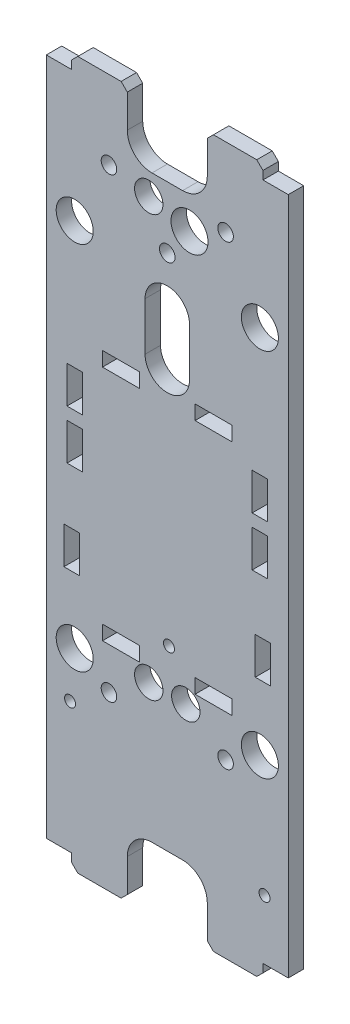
ISO-10303-21;
HEADER;
FILE_DESCRIPTION(('STEP AP214'),'2;1');
FILE_NAME('part.step','',(''),(''),'','','');
FILE_SCHEMA(('AUTOMOTIVE_DESIGN { 1 0 10303 214 1 1 1 1 }'));
ENDSEC;
DATA;
#1=APPLICATION_CONTEXT('core data for automotive mechanical design processes');
#2=APPLICATION_PROTOCOL_DEFINITION('international standard','automotive_design',2000,#1);
#3=PRODUCT_CONTEXT('',#1,'mechanical');
#4=PRODUCT('Part','Part','',(#3));
#5=PRODUCT_RELATED_PRODUCT_CATEGORY('part','',(#4));
#6=PRODUCT_DEFINITION_FORMATION('','',#4);
#7=PRODUCT_DEFINITION_CONTEXT('part definition',#1,'design');
#8=PRODUCT_DEFINITION('design','',#6,#7);
#9=PRODUCT_DEFINITION_SHAPE('','',#8);
#10=(LENGTH_UNIT() NAMED_UNIT(*) SI_UNIT(.MILLI.,.METRE.));
#11=(NAMED_UNIT(*) PLANE_ANGLE_UNIT() SI_UNIT($,.RADIAN.));
#12=(NAMED_UNIT(*) SI_UNIT($,.STERADIAN.) SOLID_ANGLE_UNIT());
#13=UNCERTAINTY_MEASURE_WITH_UNIT(LENGTH_MEASURE(1.E-05),#10,'distance_accuracy_value','');
#14=(GEOMETRIC_REPRESENTATION_CONTEXT(3) GLOBAL_UNCERTAINTY_ASSIGNED_CONTEXT((#13)) GLOBAL_UNIT_ASSIGNED_CONTEXT((#10,
#11,#12)) REPRESENTATION_CONTEXT('',''));
#15=CARTESIAN_POINT('',(0.,0.,0.));
#16=DIRECTION('',(0.,0.,1.));
#17=DIRECTION('',(1.,0.,0.));
#18=AXIS2_PLACEMENT_3D('',#15,#16,#17);
#19=CARTESIAN_POINT('',(-24.892,72.771,3.175));
#20=DIRECTION('',(0.,-1.,0.));
#21=DIRECTION('',(0.,0.,-1.));
#22=AXIS2_PLACEMENT_3D('',#19,#20,#21);
#23=PLANE('',#22);
#24=DIRECTION('',(-1.,0.,0.));
#25=VECTOR('',#24,1.);
#26=CARTESIAN_POINT('',(-24.892,72.771,3.175));
#27=LINE('',#26,#25);
#28=CARTESIAN_POINT('',(-9.49959999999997,72.771,3.175));
#29=VERTEX_POINT('',#28);
#30=CARTESIAN_POINT('',(-18.415,72.771,3.175));
#31=VERTEX_POINT('',#30);
#32=EDGE_CURVE('E1323',#29,#31,#27,.T.);
#33=ORIENTED_EDGE('',*,*,#32,.F.);
#34=DIRECTION('',(0.,0.,-1.));
#35=VECTOR('',#34,1.);
#36=CARTESIAN_POINT('',(-9.49959999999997,72.771,3.175));
#37=LINE('',#36,#35);
#38=CARTESIAN_POINT('',(-9.49959999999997,72.771,0.));
#39=VERTEX_POINT('',#38);
#40=EDGE_CURVE('E1381',#29,#39,#37,.T.);
#41=ORIENTED_EDGE('',*,*,#40,.T.);
#42=DIRECTION('',(-1.,0.,0.));
#43=VECTOR('',#42,1.);
#44=CARTESIAN_POINT('',(-24.892,72.771,0.));
#45=LINE('',#44,#43);
#46=CARTESIAN_POINT('',(-18.415,72.771,0.));
#47=VERTEX_POINT('',#46);
#48=EDGE_CURVE('E1340',#39,#47,#45,.T.);
#49=ORIENTED_EDGE('',*,*,#48,.T.);
#50=DIRECTION('',(0.,0.,1.));
#51=VECTOR('',#50,1.);
#52=CARTESIAN_POINT('',(-18.415,72.771,3.175));
#53=LINE('',#52,#51);
#54=EDGE_CURVE('E1377',#47,#31,#53,.T.);
#55=ORIENTED_EDGE('',*,*,#54,.T.);
#56=EDGE_LOOP('',(#33,#41,#49,#55));
#57=FACE_BOUND('',#56,.T.);
#58=ADVANCED_FACE('F44',(#57),#23,.F.);
#59=CARTESIAN_POINT('',(-24.892,-72.771,3.175));
#60=DIRECTION('',(0.,1.,0.));
#61=DIRECTION('',(0.,0.,1.));
#62=AXIS2_PLACEMENT_3D('',#59,#60,#61);
#63=PLANE('',#62);
#64=DIRECTION('',(1.,0.,0.));
#65=VECTOR('',#64,1.);
#66=CARTESIAN_POINT('',(-24.892,-72.771,0.));
#67=LINE('',#66,#65);
#68=CARTESIAN_POINT('',(9.49959999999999,-72.771,0.));
#69=VERTEX_POINT('',#68);
#70=CARTESIAN_POINT('',(18.415,-72.771,0.));
#71=VERTEX_POINT('',#70);
#72=EDGE_CURVE('E1349',#69,#71,#67,.T.);
#73=ORIENTED_EDGE('',*,*,#72,.T.);
#74=DIRECTION('',(0.,0.,1.));
#75=VECTOR('',#74,1.);
#76=CARTESIAN_POINT('',(18.415,-72.771,3.175));
#77=LINE('',#76,#75);
#78=CARTESIAN_POINT('',(18.415,-72.771,3.175));
#79=VERTEX_POINT('',#78);
#80=EDGE_CURVE('E1468',#71,#79,#77,.T.);
#81=ORIENTED_EDGE('',*,*,#80,.T.);
#82=DIRECTION('',(1.,0.,0.));
#83=VECTOR('',#82,1.);
#84=CARTESIAN_POINT('',(-24.892,-72.771,3.175));
#85=LINE('',#84,#83);
#86=CARTESIAN_POINT('',(9.49959999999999,-72.771,3.175));
#87=VERTEX_POINT('',#86);
#88=EDGE_CURVE('E1332',#87,#79,#85,.T.);
#89=ORIENTED_EDGE('',*,*,#88,.F.);
#90=DIRECTION('',(0.,0.,-1.));
#91=VECTOR('',#90,1.);
#92=CARTESIAN_POINT('',(9.49959999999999,-72.771,3.175));
#93=LINE('',#92,#91);
#94=EDGE_CURVE('E1464',#87,#69,#93,.T.);
#95=ORIENTED_EDGE('',*,*,#94,.T.);
#96=EDGE_LOOP('',(#73,#81,#89,#95));
#97=FACE_BOUND('',#96,.T.);
#98=ADVANCED_FACE('F1490',(#97),#63,.F.);
#99=CARTESIAN_POINT('',(24.892,72.771,3.175));
#100=DIRECTION('',(-1.,0.,0.));
#101=DIRECTION('',(0.,-1.,0.));
#102=AXIS2_PLACEMENT_3D('',#99,#100,#101);
#103=PLANE('',#102);
#104=DIRECTION('',(0.,1.,0.));
#105=VECTOR('',#104,1.);
#106=CARTESIAN_POINT('',(24.892,72.771,0.));
#107=LINE('',#106,#105);
#108=CARTESIAN_POINT('',(24.892,-69.7992,0.));
#109=VERTEX_POINT('',#108);
#110=CARTESIAN_POINT('',(24.892,69.7992,0.));
#111=VERTEX_POINT('',#110);
#112=EDGE_CURVE('E1318',#109,#111,#107,.T.);
#113=ORIENTED_EDGE('',*,*,#112,.T.);
#114=DIRECTION('',(0.,0.,1.));
#115=VECTOR('',#114,1.);
#116=CARTESIAN_POINT('',(24.892,69.7992,3.175));
#117=LINE('',#116,#115);
#118=CARTESIAN_POINT('',(24.892,69.7992,3.175));
#119=VERTEX_POINT('',#118);
#120=EDGE_CURVE('E1314',#111,#119,#117,.T.);
#121=ORIENTED_EDGE('',*,*,#120,.T.);
#122=DIRECTION('',(0.,1.,0.));
#123=VECTOR('',#122,1.);
#124=CARTESIAN_POINT('',(24.892,72.771,3.175));
#125=LINE('',#124,#123);
#126=CARTESIAN_POINT('',(24.892,-69.7992,3.175));
#127=VERTEX_POINT('',#126);
#128=EDGE_CURVE('E1319',#127,#119,#125,.T.);
#129=ORIENTED_EDGE('',*,*,#128,.F.);
#130=DIRECTION('',(0.,0.,-1.));
#131=VECTOR('',#130,1.);
#132=CARTESIAN_POINT('',(24.892,-69.7992,3.175));
#133=LINE('',#132,#131);
#134=EDGE_CURVE('E1299',#127,#109,#133,.T.);
#135=ORIENTED_EDGE('',*,*,#134,.T.);
#136=EDGE_LOOP('',(#113,#121,#129,#135));
#137=FACE_BOUND('',#136,.T.);
#138=ADVANCED_FACE('F1645',(#137),#103,.F.);
#139=CARTESIAN_POINT('',(18.415,72.771,0.));
#140=VERTEX_POINT('',#139);
#141=CARTESIAN_POINT('',(9.49959999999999,72.771,0.));
#142=VERTEX_POINT('',#141);
#143=EDGE_CURVE('E1341',#140,#142,#45,.T.);
#144=ORIENTED_EDGE('',*,*,#143,.T.);
#145=DIRECTION('',(0.,0.,1.));
#146=VECTOR('',#145,1.);
#147=CARTESIAN_POINT('',(9.49959999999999,72.771,3.175));
#148=LINE('',#147,#146);
#149=CARTESIAN_POINT('',(9.49959999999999,72.771,3.175));
#150=VERTEX_POINT('',#149);
#151=EDGE_CURVE('E1441',#142,#150,#148,.T.);
#152=ORIENTED_EDGE('',*,*,#151,.T.);
#153=CARTESIAN_POINT('',(18.415,72.771,3.175));
#154=VERTEX_POINT('',#153);
#155=EDGE_CURVE('E1325',#154,#150,#27,.T.);
#156=ORIENTED_EDGE('',*,*,#155,.F.);
#157=DIRECTION('',(0.,0.,-1.));
#158=VECTOR('',#157,1.);
#159=CARTESIAN_POINT('',(18.415,72.771,3.175));
#160=LINE('',#159,#158);
#161=EDGE_CURVE('E1437',#154,#140,#160,.T.);
#162=ORIENTED_EDGE('',*,*,#161,.T.);
#163=EDGE_LOOP('',(#144,#152,#156,#162));
#164=FACE_BOUND('',#163,.T.);
#165=ADVANCED_FACE('F1641',(#164),#23,.F.);
#166=CARTESIAN_POINT('',(-24.892,72.771,3.175));
#167=DIRECTION('',(1.,0.,0.));
#168=DIRECTION('',(0.,1.,0.));
#169=AXIS2_PLACEMENT_3D('',#166,#167,#168);
#170=PLANE('',#169);
#171=DIRECTION('',(0.,-1.,0.));
#172=VECTOR('',#171,1.);
#173=CARTESIAN_POINT('',(-24.892,72.771,3.175));
#174=LINE('',#173,#172);
#175=CARTESIAN_POINT('',(-24.892,69.7992,3.175));
#176=VERTEX_POINT('',#175);
#177=CARTESIAN_POINT('',(-24.892,-69.7992,3.175));
#178=VERTEX_POINT('',#177);
#179=EDGE_CURVE('E1328',#176,#178,#174,.T.);
#180=ORIENTED_EDGE('',*,*,#179,.F.);
#181=DIRECTION('',(0.,0.,-1.));
#182=VECTOR('',#181,1.);
#183=CARTESIAN_POINT('',(-24.892,69.7992,3.175));
#184=LINE('',#183,#182);
#185=CARTESIAN_POINT('',(-24.892,69.7992,0.));
#186=VERTEX_POINT('',#185);
#187=EDGE_CURVE('E1310',#176,#186,#184,.T.);
#188=ORIENTED_EDGE('',*,*,#187,.T.);
#189=DIRECTION('',(0.,-1.,0.));
#190=VECTOR('',#189,1.);
#191=CARTESIAN_POINT('',(-24.892,72.771,0.));
#192=LINE('',#191,#190);
#193=CARTESIAN_POINT('',(-24.892,-69.7992,0.));
#194=VERTEX_POINT('',#193);
#195=EDGE_CURVE('E1345',#186,#194,#192,.T.);
#196=ORIENTED_EDGE('',*,*,#195,.T.);
#197=DIRECTION('',(0.,0.,1.));
#198=VECTOR('',#197,1.);
#199=CARTESIAN_POINT('',(-24.892,-69.7992,3.175));
#200=LINE('',#199,#198);
#201=EDGE_CURVE('E1306',#194,#178,#200,.T.);
#202=ORIENTED_EDGE('',*,*,#201,.T.);
#203=EDGE_LOOP('',(#180,#188,#196,#202));
#204=FACE_BOUND('',#203,.T.);
#205=ADVANCED_FACE('F1525',(#204),#170,.F.);
#206=CARTESIAN_POINT('',(-18.415,-72.771,3.175));
#207=VERTEX_POINT('',#206);
#208=CARTESIAN_POINT('',(-9.49959999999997,-72.771,3.175));
#209=VERTEX_POINT('',#208);
#210=EDGE_CURVE('E1336',#207,#209,#85,.T.);
#211=ORIENTED_EDGE('',*,*,#210,.F.);
#212=DIRECTION('',(0.,0.,-1.));
#213=VECTOR('',#212,1.);
#214=CARTESIAN_POINT('',(-18.415,-72.771,3.175));
#215=LINE('',#214,#213);
#216=CARTESIAN_POINT('',(-18.415,-72.771,0.));
#217=VERTEX_POINT('',#216);
#218=EDGE_CURVE('E1454',#207,#217,#215,.T.);
#219=ORIENTED_EDGE('',*,*,#218,.T.);
#220=CARTESIAN_POINT('',(-9.49959999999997,-72.771,0.));
#221=VERTEX_POINT('',#220);
#222=EDGE_CURVE('E1324',#217,#221,#67,.T.);
#223=ORIENTED_EDGE('',*,*,#222,.T.);
#224=DIRECTION('',(0.,0.,1.));
#225=VECTOR('',#224,1.);
#226=CARTESIAN_POINT('',(-9.49959999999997,-72.771,3.175));
#227=LINE('',#226,#225);
#228=EDGE_CURVE('E1450',#221,#209,#227,.T.);
#229=ORIENTED_EDGE('',*,*,#228,.T.);
#230=EDGE_LOOP('',(#211,#219,#223,#229));
#231=FACE_BOUND('',#230,.T.);
#232=ADVANCED_FACE('F1542',(#231),#63,.F.);
#233=CARTESIAN_POINT('',(0.,0.,3.175));
#234=DIRECTION('',(0.,0.,1.));
#235=DIRECTION('',(1.,0.,0.));
#236=AXIS2_PLACEMENT_3D('',#233,#234,#235);
#237=PLANE('',#236);
#238=DIRECTION('',(0.,1.,0.));
#239=VECTOR('',#238,1.);
#240=CARTESIAN_POINT('',(-18.0975,-11.9755642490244,3.175));
#241=LINE('',#240,#239);
#242=CARTESIAN_POINT('',(-18.0975,-19.5955642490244,3.175));
#243=VERTEX_POINT('',#242);
#244=CARTESIAN_POINT('',(-18.0975,-11.9755642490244,3.175));
#245=VERTEX_POINT('',#244);
#246=EDGE_CURVE('E528',#243,#245,#241,.T.);
#247=ORIENTED_EDGE('',*,*,#246,.F.);
#248=DIRECTION('',(1.,0.,0.));
#249=VECTOR('',#248,1.);
#250=CARTESIAN_POINT('',(-21.2725,-19.5955642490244,3.175));
#251=LINE('',#250,#249);
#252=CARTESIAN_POINT('',(-21.2725,-19.5955642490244,3.175));
#253=VERTEX_POINT('',#252);
#254=EDGE_CURVE('E549',#253,#243,#251,.T.);
#255=ORIENTED_EDGE('',*,*,#254,.F.);
#256=DIRECTION('',(0.,-1.,0.));
#257=VECTOR('',#256,1.);
#258=CARTESIAN_POINT('',(-21.2725,-11.9755642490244,3.175));
#259=LINE('',#258,#257);
#260=CARTESIAN_POINT('',(-21.2725,-11.9755642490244,3.175));
#261=VERTEX_POINT('',#260);
#262=EDGE_CURVE('E554',#261,#253,#259,.T.);
#263=ORIENTED_EDGE('',*,*,#262,.F.);
#264=DIRECTION('',(-1.,0.,0.));
#265=VECTOR('',#264,1.);
#266=CARTESIAN_POINT('',(-21.2725,-11.9755642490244,3.175));
#267=LINE('',#266,#265);
#268=EDGE_CURVE('E563',#245,#261,#267,.T.);
#269=ORIENTED_EDGE('',*,*,#268,.F.);
#270=EDGE_LOOP('',(#247,#255,#263,#269));
#271=FACE_BOUND('',#270,.T.);
#272=DIRECTION('',(0.,1.,0.));
#273=VECTOR('',#272,1.);
#274=CARTESIAN_POINT('',(13.335,-25.8500771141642,3.175));
#275=LINE('',#274,#273);
#276=CARTESIAN_POINT('',(13.335,-28.8218771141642,3.175));
#277=VERTEX_POINT('',#276);
#278=CARTESIAN_POINT('',(13.335,-25.8500771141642,3.175));
#279=VERTEX_POINT('',#278);
#280=EDGE_CURVE('E597',#277,#279,#275,.T.);
#281=ORIENTED_EDGE('',*,*,#280,.F.);
#282=DIRECTION('',(1.,0.,0.));
#283=VECTOR('',#282,1.);
#284=CARTESIAN_POINT('',(5.71500000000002,-28.8218771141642,3.175));
#285=LINE('',#284,#283);
#286=CARTESIAN_POINT('',(5.71500000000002,-28.8218771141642,3.175));
#287=VERTEX_POINT('',#286);
#288=EDGE_CURVE('E584',#287,#277,#285,.T.);
#289=ORIENTED_EDGE('',*,*,#288,.F.);
#290=DIRECTION('',(0.,-1.,0.));
#291=VECTOR('',#290,1.);
#292=CARTESIAN_POINT('',(5.71500000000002,-25.8500771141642,3.175));
#293=LINE('',#292,#291);
#294=CARTESIAN_POINT('',(5.71500000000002,-25.8500771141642,3.175));
#295=VERTEX_POINT('',#294);
#296=EDGE_CURVE('E605',#295,#287,#293,.T.);
#297=ORIENTED_EDGE('',*,*,#296,.F.);
#298=DIRECTION('',(-1.,0.,0.));
#299=VECTOR('',#298,1.);
#300=CARTESIAN_POINT('',(5.71500000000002,-25.8500771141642,3.175));
#301=LINE('',#300,#299);
#302=EDGE_CURVE('E600',#279,#295,#301,.T.);
#303=ORIENTED_EDGE('',*,*,#302,.F.);
#304=EDGE_LOOP('',(#281,#289,#297,#303));
#305=FACE_BOUND('',#304,.T.);
#306=DIRECTION('',(0.,1.,0.));
#307=VECTOR('',#306,1.);
#308=CARTESIAN_POINT('',(-5.71499999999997,-25.8500771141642,3.175));
#309=LINE('',#308,#307);
#310=CARTESIAN_POINT('',(-5.71499999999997,-28.8218771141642,3.175));
#311=VERTEX_POINT('',#310);
#312=CARTESIAN_POINT('',(-5.71499999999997,-25.8500771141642,3.175));
#313=VERTEX_POINT('',#312);
#314=EDGE_CURVE('E641',#311,#313,#309,.T.);
#315=ORIENTED_EDGE('',*,*,#314,.F.);
#316=DIRECTION('',(1.,0.,0.));
#317=VECTOR('',#316,1.);
#318=CARTESIAN_POINT('',(-13.335,-28.8218771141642,3.175));
#319=LINE('',#318,#317);
#320=CARTESIAN_POINT('',(-13.335,-28.8218771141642,3.175));
#321=VERTEX_POINT('',#320);
#322=EDGE_CURVE('E628',#321,#311,#319,.T.);
#323=ORIENTED_EDGE('',*,*,#322,.F.);
#324=DIRECTION('',(0.,-1.,0.));
#325=VECTOR('',#324,1.);
#326=CARTESIAN_POINT('',(-13.335,-25.8500771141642,3.175));
#327=LINE('',#326,#325);
#328=CARTESIAN_POINT('',(-13.335,-25.8500771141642,3.175));
#329=VERTEX_POINT('',#328);
#330=EDGE_CURVE('E649',#329,#321,#327,.T.);
#331=ORIENTED_EDGE('',*,*,#330,.F.);
#332=DIRECTION('',(-1.,0.,0.));
#333=VECTOR('',#332,1.);
#334=CARTESIAN_POINT('',(-13.335,-25.8500771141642,3.175));
#335=LINE('',#334,#333);
#336=EDGE_CURVE('E644',#313,#329,#335,.T.);
#337=ORIENTED_EDGE('',*,*,#336,.F.);
#338=EDGE_LOOP('',(#315,#323,#331,#337));
#339=FACE_BOUND('',#338,.T.);
#340=DIRECTION('',(0.,1.,0.));
#341=VECTOR('',#340,1.);
#342=CARTESIAN_POINT('',(21.2725,-11.9755642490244,3.175));
#343=LINE('',#342,#341);
#344=CARTESIAN_POINT('',(21.2725,-19.5955642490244,3.175));
#345=VERTEX_POINT('',#344);
#346=CARTESIAN_POINT('',(21.2725,-11.9755642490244,3.175));
#347=VERTEX_POINT('',#346);
#348=EDGE_CURVE('E685',#345,#347,#343,.T.);
#349=ORIENTED_EDGE('',*,*,#348,.F.);
#350=DIRECTION('',(1.,0.,0.));
#351=VECTOR('',#350,1.);
#352=CARTESIAN_POINT('',(21.2725,-19.5955642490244,3.175));
#353=LINE('',#352,#351);
#354=CARTESIAN_POINT('',(18.0975,-19.5955642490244,3.175));
#355=VERTEX_POINT('',#354);
#356=EDGE_CURVE('E672',#355,#345,#353,.T.);
#357=ORIENTED_EDGE('',*,*,#356,.F.);
#358=DIRECTION('',(0.,-1.,0.));
#359=VECTOR('',#358,1.);
#360=CARTESIAN_POINT('',(18.0975,-11.9755642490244,3.175));
#361=LINE('',#360,#359);
#362=CARTESIAN_POINT('',(18.0975,-11.9755642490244,3.175));
#363=VERTEX_POINT('',#362);
#364=EDGE_CURVE('E692',#363,#355,#361,.T.);
#365=ORIENTED_EDGE('',*,*,#364,.F.);
#366=DIRECTION('',(-1.,0.,0.));
#367=VECTOR('',#366,1.);
#368=CARTESIAN_POINT('',(21.2725,-11.9755642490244,3.175));
#369=LINE('',#368,#367);
#370=EDGE_CURVE('E688',#347,#363,#369,.T.);
#371=ORIENTED_EDGE('',*,*,#370,.F.);
#372=EDGE_LOOP('',(#349,#357,#365,#371));
#373=FACE_BOUND('',#372,.T.);
#374=CARTESIAN_POINT('',(-19.05,43.18,3.175));
#375=DIRECTION('',(0.,0.,1.));
#376=DIRECTION('',(1.,0.,0.));
#377=AXIS2_PLACEMENT_3D('',#374,#375,#376);
#378=CIRCLE('',#377,3.81);
#379=CARTESIAN_POINT('',(-15.24,43.18,3.175));
#380=VERTEX_POINT('',#379);
#381=EDGE_CURVE('E723',#380,#380,#378,.T.);
#382=ORIENTED_EDGE('',*,*,#381,.F.);
#383=EDGE_LOOP('',(#382));
#384=FACE_BOUND('',#383,.T.);
#385=CARTESIAN_POINT('',(19.05,-33.02,3.175));
#386=DIRECTION('',(0.,0.,1.));
#387=DIRECTION('',(1.,0.,0.));
#388=AXIS2_PLACEMENT_3D('',#385,#386,#387);
#389=CIRCLE('',#388,3.81);
#390=CARTESIAN_POINT('',(22.86,-33.02,3.175));
#391=VERTEX_POINT('',#390);
#392=EDGE_CURVE('E714',#391,#391,#389,.T.);
#393=ORIENTED_EDGE('',*,*,#392,.F.);
#394=EDGE_LOOP('',(#393));
#395=FACE_BOUND('',#394,.T.);
#396=CARTESIAN_POINT('',(-19.05,-33.02,3.175));
#397=DIRECTION('',(0.,0.,1.));
#398=DIRECTION('',(1.,0.,0.));
#399=AXIS2_PLACEMENT_3D('',#396,#397,#398);
#400=CIRCLE('',#399,3.81);
#401=CARTESIAN_POINT('',(-15.24,-33.02,3.175));
#402=VERTEX_POINT('',#401);
#403=EDGE_CURVE('E573',#402,#402,#400,.T.);
#404=ORIENTED_EDGE('',*,*,#403,.F.);
#405=EDGE_LOOP('',(#404));
#406=FACE_BOUND('',#405,.T.);
#407=CARTESIAN_POINT('',(19.05,43.18,3.175));
#408=DIRECTION('',(0.,0.,1.));
#409=DIRECTION('',(1.,0.,0.));
#410=AXIS2_PLACEMENT_3D('',#407,#408,#409);
#411=CIRCLE('',#410,3.81);
#412=CARTESIAN_POINT('',(22.86,43.18,3.175));
#413=VERTEX_POINT('',#412);
#414=EDGE_CURVE('E722',#413,#413,#411,.T.);
#415=ORIENTED_EDGE('',*,*,#414,.F.);
#416=EDGE_LOOP('',(#415));
#417=FACE_BOUND('',#416,.T.);
#418=CARTESIAN_POINT('',(-3.81,55.118,3.175));
#419=DIRECTION('',(0.,0.,1.));
#420=DIRECTION('',(1.,0.,0.));
#421=AXIS2_PLACEMENT_3D('',#418,#419,#420);
#422=CIRCLE('',#421,2.921);
#423=CARTESIAN_POINT('',(-0.889,55.118,3.175));
#424=VERTEX_POINT('',#423);
#425=EDGE_CURVE('E755',#424,#424,#422,.T.);
#426=ORIENTED_EDGE('',*,*,#425,.F.);
#427=EDGE_LOOP('',(#426));
#428=FACE_BOUND('',#427,.T.);
#429=CARTESIAN_POINT('',(3.81000000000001,-31.496,3.175));
#430=DIRECTION('',(0.,0.,1.));
#431=DIRECTION('',(1.,0.,0.));
#432=AXIS2_PLACEMENT_3D('',#429,#430,#431);
#433=CIRCLE('',#432,2.921);
#434=CARTESIAN_POINT('',(6.73100000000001,-31.496,3.175));
#435=VERTEX_POINT('',#434);
#436=EDGE_CURVE('E746',#435,#435,#433,.T.);
#437=ORIENTED_EDGE('',*,*,#436,.F.);
#438=EDGE_LOOP('',(#437));
#439=FACE_BOUND('',#438,.T.);
#440=CARTESIAN_POINT('',(-3.80999999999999,-31.496,3.175));
#441=DIRECTION('',(0.,0.,1.));
#442=DIRECTION('',(1.,0.,0.));
#443=AXIS2_PLACEMENT_3D('',#440,#441,#442);
#444=CIRCLE('',#443,2.921);
#445=CARTESIAN_POINT('',(-0.888999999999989,-31.496,3.175));
#446=VERTEX_POINT('',#445);
#447=EDGE_CURVE('E738',#446,#446,#444,.T.);
#448=ORIENTED_EDGE('',*,*,#447,.F.);
#449=EDGE_LOOP('',(#448));
#450=FACE_BOUND('',#449,.T.);
#451=CARTESIAN_POINT('',(4.572,53.086,3.175));
#452=DIRECTION('',(0.,0.,1.));
#453=DIRECTION('',(1.,0.,0.));
#454=AXIS2_PLACEMENT_3D('',#451,#452,#453);
#455=CIRCLE('',#454,3.81);
#456=CARTESIAN_POINT('',(8.382,53.086,3.175));
#457=VERTEX_POINT('',#456);
#458=EDGE_CURVE('E754',#457,#457,#455,.T.);
#459=ORIENTED_EDGE('',*,*,#458,.F.);
#460=EDGE_LOOP('',(#459));
#461=FACE_BOUND('',#460,.T.);
#462=CARTESIAN_POINT('',(0.,36.5252,3.175));
#463=DIRECTION('',(0.,0.,1.));
#464=DIRECTION('',(1.,0.,0.));
#465=AXIS2_PLACEMENT_3D('',#462,#463,#464);
#466=CIRCLE('',#465,4.572);
#467=CARTESIAN_POINT('',(4.572,36.5252,3.175));
#468=VERTEX_POINT('',#467);
#469=CARTESIAN_POINT('',(-4.572,36.5252,3.175));
#470=VERTEX_POINT('',#469);
#471=EDGE_CURVE('E770',#468,#470,#466,.T.);
#472=ORIENTED_EDGE('',*,*,#471,.F.);
#473=DIRECTION('',(0.,1.,0.));
#474=VECTOR('',#473,1.);
#475=CARTESIAN_POINT('',(4.572,36.5252,3.175));
#476=LINE('',#475,#474);
#477=CARTESIAN_POINT('',(4.572,26.6192,3.175));
#478=VERTEX_POINT('',#477);
#479=EDGE_CURVE('E779',#478,#468,#476,.T.);
#480=ORIENTED_EDGE('',*,*,#479,.F.);
#481=CARTESIAN_POINT('',(0.,26.6192,3.175));
#482=DIRECTION('',(0.,0.,1.));
#483=DIRECTION('',(1.,0.,0.));
#484=AXIS2_PLACEMENT_3D('',#481,#482,#483);
#485=CIRCLE('',#484,4.572);
#486=CARTESIAN_POINT('',(-4.572,26.6192,3.175));
#487=VERTEX_POINT('',#486);
#488=EDGE_CURVE('E798',#487,#478,#485,.T.);
#489=ORIENTED_EDGE('',*,*,#488,.F.);
#490=DIRECTION('',(0.,-1.,0.));
#491=VECTOR('',#490,1.);
#492=CARTESIAN_POINT('',(-4.572,36.5252,3.175));
#493=LINE('',#492,#491);
#494=EDGE_CURVE('E794',#470,#487,#493,.T.);
#495=ORIENTED_EDGE('',*,*,#494,.F.);
#496=EDGE_LOOP('',(#472,#480,#489,#495));
#497=FACE_BOUND('',#496,.T.);
#498=DIRECTION('',(0.,-1.,0.));
#499=VECTOR('',#498,1.);
#500=CARTESIAN_POINT('',(-20.6375,-0.804710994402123,3.175));
#501=LINE('',#500,#499);
#502=CARTESIAN_POINT('',(-20.6375,6.81528900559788,3.175));
#503=VERTEX_POINT('',#502);
#504=CARTESIAN_POINT('',(-20.6375,-0.804710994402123,3.175));
#505=VERTEX_POINT('',#504);
#506=EDGE_CURVE('E808',#503,#505,#501,.T.);
#507=ORIENTED_EDGE('',*,*,#506,.F.);
#508=DIRECTION('',(-1.,0.,0.));
#509=VECTOR('',#508,1.);
#510=CARTESIAN_POINT('',(-20.6375,6.81528900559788,3.175));
#511=LINE('',#510,#509);
#512=CARTESIAN_POINT('',(-17.4625,6.81528900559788,3.175));
#513=VERTEX_POINT('',#512);
#514=EDGE_CURVE('E1001',#513,#503,#511,.T.);
#515=ORIENTED_EDGE('',*,*,#514,.F.);
#516=DIRECTION('',(0.,1.,0.));
#517=VECTOR('',#516,1.);
#518=CARTESIAN_POINT('',(-17.4625,-0.804710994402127,3.175));
#519=LINE('',#518,#517);
#520=CARTESIAN_POINT('',(-17.4625,-0.804710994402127,3.175));
#521=VERTEX_POINT('',#520);
#522=EDGE_CURVE('E1020',#521,#513,#519,.T.);
#523=ORIENTED_EDGE('',*,*,#522,.F.);
#524=DIRECTION('',(1.,0.,0.));
#525=VECTOR('',#524,1.);
#526=CARTESIAN_POINT('',(-20.6375,-0.804710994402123,3.175));
#527=LINE('',#526,#525);
#528=EDGE_CURVE('E1016',#505,#521,#527,.T.);
#529=ORIENTED_EDGE('',*,*,#528,.F.);
#530=EDGE_LOOP('',(#507,#515,#523,#529));
#531=FACE_BOUND('',#530,.T.);
#532=DIRECTION('',(0.,1.,0.));
#533=VECTOR('',#532,1.);
#534=CARTESIAN_POINT('',(20.6375,-0.804710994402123,3.175));
#535=LINE('',#534,#533);
#536=CARTESIAN_POINT('',(20.6375,-0.804710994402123,3.175));
#537=VERTEX_POINT('',#536);
#538=CARTESIAN_POINT('',(20.6375,6.81528900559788,3.175));
#539=VERTEX_POINT('',#538);
#540=EDGE_CURVE('E970',#537,#539,#535,.T.);
#541=ORIENTED_EDGE('',*,*,#540,.F.);
#542=DIRECTION('',(1.,0.,0.));
#543=VECTOR('',#542,1.);
#544=CARTESIAN_POINT('',(20.6375,-0.804710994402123,3.175));
#545=LINE('',#544,#543);
#546=CARTESIAN_POINT('',(17.4625,-0.804710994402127,3.175));
#547=VERTEX_POINT('',#546);
#548=EDGE_CURVE('E957',#547,#537,#545,.T.);
#549=ORIENTED_EDGE('',*,*,#548,.F.);
#550=DIRECTION('',(0.,-1.,0.));
#551=VECTOR('',#550,1.);
#552=CARTESIAN_POINT('',(17.4625,-0.804710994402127,3.175));
#553=LINE('',#552,#551);
#554=CARTESIAN_POINT('',(17.4625,6.81528900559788,3.175));
#555=VERTEX_POINT('',#554);
#556=EDGE_CURVE('E978',#555,#547,#553,.T.);
#557=ORIENTED_EDGE('',*,*,#556,.F.);
#558=DIRECTION('',(-1.,0.,0.));
#559=VECTOR('',#558,1.);
#560=CARTESIAN_POINT('',(20.6375,6.81528900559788,3.175));
#561=LINE('',#560,#559);
#562=EDGE_CURVE('E973',#539,#555,#561,.T.);
#563=ORIENTED_EDGE('',*,*,#562,.F.);
#564=EDGE_LOOP('',(#541,#549,#557,#563));
#565=FACE_BOUND('',#564,.T.);
#566=DIRECTION('',(0.,1.,0.));
#567=VECTOR('',#566,1.);
#568=CARTESIAN_POINT('',(20.6375,16.9752890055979,3.175));
#569=LINE('',#568,#567);
#570=CARTESIAN_POINT('',(20.6375,9.35528900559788,3.175));
#571=VERTEX_POINT('',#570);
#572=CARTESIAN_POINT('',(20.6375,16.9752890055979,3.175));
#573=VERTEX_POINT('',#572);
#574=EDGE_CURVE('E926',#571,#573,#569,.T.);
#575=ORIENTED_EDGE('',*,*,#574,.F.);
#576=DIRECTION('',(1.,0.,0.));
#577=VECTOR('',#576,1.);
#578=CARTESIAN_POINT('',(20.6375,9.35528900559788,3.175));
#579=LINE('',#578,#577);
#580=CARTESIAN_POINT('',(17.4625,9.35528900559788,3.175));
#581=VERTEX_POINT('',#580);
#582=EDGE_CURVE('E913',#581,#571,#579,.T.);
#583=ORIENTED_EDGE('',*,*,#582,.F.);
#584=DIRECTION('',(0.,-1.,0.));
#585=VECTOR('',#584,1.);
#586=CARTESIAN_POINT('',(17.4625,16.9752890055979,3.175));
#587=LINE('',#586,#585);
#588=CARTESIAN_POINT('',(17.4625,16.9752890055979,3.175));
#589=VERTEX_POINT('',#588);
#590=EDGE_CURVE('E934',#589,#581,#587,.T.);
#591=ORIENTED_EDGE('',*,*,#590,.F.);
#592=DIRECTION('',(-1.,0.,0.));
#593=VECTOR('',#592,1.);
#594=CARTESIAN_POINT('',(20.6375,16.9752890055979,3.175));
#595=LINE('',#594,#593);
#596=EDGE_CURVE('E929',#573,#589,#595,.T.);
#597=ORIENTED_EDGE('',*,*,#596,.F.);
#598=EDGE_LOOP('',(#575,#583,#591,#597));
#599=FACE_BOUND('',#598,.T.);
#600=DIRECTION('',(0.,1.,0.));
#601=VECTOR('',#600,1.);
#602=CARTESIAN_POINT('',(13.335,22.9183327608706,3.175));
#603=LINE('',#602,#601);
#604=CARTESIAN_POINT('',(13.335,19.9465327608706,3.175));
#605=VERTEX_POINT('',#604);
#606=CARTESIAN_POINT('',(13.335,22.9183327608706,3.175));
#607=VERTEX_POINT('',#606);
#608=EDGE_CURVE('E882',#605,#607,#603,.T.);
#609=ORIENTED_EDGE('',*,*,#608,.F.);
#610=DIRECTION('',(1.,0.,0.));
#611=VECTOR('',#610,1.);
#612=CARTESIAN_POINT('',(5.715,19.9465327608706,3.175));
#613=LINE('',#612,#611);
#614=CARTESIAN_POINT('',(5.715,19.9465327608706,3.175));
#615=VERTEX_POINT('',#614);
#616=EDGE_CURVE('E869',#615,#605,#613,.T.);
#617=ORIENTED_EDGE('',*,*,#616,.F.);
#618=DIRECTION('',(0.,-1.,0.));
#619=VECTOR('',#618,1.);
#620=CARTESIAN_POINT('',(5.715,22.9183327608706,3.175));
#621=LINE('',#620,#619);
#622=CARTESIAN_POINT('',(5.715,22.9183327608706,3.175));
#623=VERTEX_POINT('',#622);
#624=EDGE_CURVE('E890',#623,#615,#621,.T.);
#625=ORIENTED_EDGE('',*,*,#624,.F.);
#626=DIRECTION('',(-1.,0.,0.));
#627=VECTOR('',#626,1.);
#628=CARTESIAN_POINT('',(5.715,22.9183327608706,3.175));
#629=LINE('',#628,#627);
#630=EDGE_CURVE('E885',#607,#623,#629,.T.);
#631=ORIENTED_EDGE('',*,*,#630,.F.);
#632=EDGE_LOOP('',(#609,#617,#625,#631));
#633=FACE_BOUND('',#632,.T.);
#634=DIRECTION('',(0.,1.,0.));
#635=VECTOR('',#634,1.);
#636=CARTESIAN_POINT('',(-5.715,22.9183327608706,3.175));
#637=LINE('',#636,#635);
#638=CARTESIAN_POINT('',(-5.715,19.9465327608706,3.175));
#639=VERTEX_POINT('',#638);
#640=CARTESIAN_POINT('',(-5.715,22.9183327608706,3.175));
#641=VERTEX_POINT('',#640);
#642=EDGE_CURVE('E836',#639,#641,#637,.T.);
#643=ORIENTED_EDGE('',*,*,#642,.F.);
#644=DIRECTION('',(1.,0.,0.));
#645=VECTOR('',#644,1.);
#646=CARTESIAN_POINT('',(-13.335,19.9465327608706,3.175));
#647=LINE('',#646,#645);
#648=CARTESIAN_POINT('',(-13.335,19.9465327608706,3.175));
#649=VERTEX_POINT('',#648);
#650=EDGE_CURVE('E823',#649,#639,#647,.T.);
#651=ORIENTED_EDGE('',*,*,#650,.F.);
#652=DIRECTION('',(0.,-1.,0.));
#653=VECTOR('',#652,1.);
#654=CARTESIAN_POINT('',(-13.335,22.9183327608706,3.175));
#655=LINE('',#654,#653);
#656=CARTESIAN_POINT('',(-13.335,22.9183327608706,3.175));
#657=VERTEX_POINT('',#656);
#658=EDGE_CURVE('E844',#657,#649,#655,.T.);
#659=ORIENTED_EDGE('',*,*,#658,.F.);
#660=DIRECTION('',(-1.,0.,0.));
#661=VECTOR('',#660,1.);
#662=CARTESIAN_POINT('',(-13.335,22.9183327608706,3.175));
#663=LINE('',#662,#661);
#664=EDGE_CURVE('E839',#641,#657,#663,.T.);
#665=ORIENTED_EDGE('',*,*,#664,.F.);
#666=EDGE_LOOP('',(#643,#651,#659,#665));
#667=FACE_BOUND('',#666,.T.);
#668=DIRECTION('',(0.,1.,0.));
#669=VECTOR('',#668,1.);
#670=CARTESIAN_POINT('',(-17.4625,16.9752890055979,3.175));
#671=LINE('',#670,#669);
#672=CARTESIAN_POINT('',(-17.4625,9.35528900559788,3.175));
#673=VERTEX_POINT('',#672);
#674=CARTESIAN_POINT('',(-17.4625,16.9752890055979,3.175));
#675=VERTEX_POINT('',#674);
#676=EDGE_CURVE('E854',#673,#675,#671,.T.);
#677=ORIENTED_EDGE('',*,*,#676,.F.);
#678=DIRECTION('',(1.,0.,0.));
#679=VECTOR('',#678,1.);
#680=CARTESIAN_POINT('',(-20.6375,9.35528900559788,3.175));
#681=LINE('',#680,#679);
#682=CARTESIAN_POINT('',(-20.6375,9.35528900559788,3.175));
#683=VERTEX_POINT('',#682);
#684=EDGE_CURVE('E1043',#683,#673,#681,.T.);
#685=ORIENTED_EDGE('',*,*,#684,.F.);
#686=DIRECTION('',(0.,-1.,0.));
#687=VECTOR('',#686,1.);
#688=CARTESIAN_POINT('',(-20.6375,16.9752890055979,3.175));
#689=LINE('',#688,#687);
#690=CARTESIAN_POINT('',(-20.6375,16.9752890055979,3.175));
#691=VERTEX_POINT('',#690);
#692=EDGE_CURVE('E1062',#691,#683,#689,.T.);
#693=ORIENTED_EDGE('',*,*,#692,.F.);
#694=DIRECTION('',(-1.,0.,0.));
#695=VECTOR('',#694,1.);
#696=CARTESIAN_POINT('',(-20.6375,16.9752890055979,3.175));
#697=LINE('',#696,#695);
#698=EDGE_CURVE('E1058',#675,#691,#697,.T.);
#699=ORIENTED_EDGE('',*,*,#698,.F.);
#700=EDGE_LOOP('',(#677,#685,#693,#699));
#701=FACE_BOUND('',#700,.T.);
#702=CARTESIAN_POINT('',(-20.005,-42.91600002,3.175));
#703=DIRECTION('',(0.,0.,1.));
#704=DIRECTION('',(1.,0.,0.));
#705=AXIS2_PLACEMENT_3D('',#702,#703,#704);
#706=CIRCLE('',#705,1.1303);
#707=CARTESIAN_POINT('',(-18.8747,-42.91600002,3.175));
#708=VERTEX_POINT('',#707);
#709=EDGE_CURVE('E1072',#708,#708,#706,.T.);
#710=ORIENTED_EDGE('',*,*,#709,.F.);
#711=EDGE_LOOP('',(#710));
#712=FACE_BOUND('',#711,.T.);
#713=CARTESIAN_POINT('',(20.005,-57.526,3.175));
#714=DIRECTION('',(0.,0.,1.));
#715=DIRECTION('',(1.,0.,0.));
#716=AXIS2_PLACEMENT_3D('',#713,#714,#715);
#717=CIRCLE('',#716,1.1303);
#718=CARTESIAN_POINT('',(21.1353,-57.526,3.175));
#719=VERTEX_POINT('',#718);
#720=EDGE_CURVE('E1089',#719,#719,#717,.T.);
#721=ORIENTED_EDGE('',*,*,#720,.F.);
#722=EDGE_LOOP('',(#721));
#723=FACE_BOUND('',#722,.T.);
#724=CARTESIAN_POINT('',(0.348448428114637,-22.9108,3.175));
#725=DIRECTION('',(0.,0.,1.));
#726=DIRECTION('',(1.,0.,0.));
#727=AXIS2_PLACEMENT_3D('',#724,#725,#726);
#728=CIRCLE('',#727,1.1303);
#729=CARTESIAN_POINT('',(1.47874842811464,-22.9108,3.175));
#730=VERTEX_POINT('',#729);
#731=EDGE_CURVE('E1097',#730,#730,#728,.T.);
#732=ORIENTED_EDGE('',*,*,#731,.F.);
#733=EDGE_LOOP('',(#732));
#734=FACE_BOUND('',#733,.T.);
#735=CARTESIAN_POINT('',(-12.,56.6392,3.175));
#736=DIRECTION('',(0.,0.,1.));
#737=DIRECTION('',(1.,0.,0.));
#738=AXIS2_PLACEMENT_3D('',#735,#736,#737);
#739=CIRCLE('',#738,1.6);
#740=CARTESIAN_POINT('',(-10.4,56.6392,3.175));
#741=VERTEX_POINT('',#740);
#742=EDGE_CURVE('E1105',#741,#741,#739,.T.);
#743=ORIENTED_EDGE('',*,*,#742,.F.);
#744=EDGE_LOOP('',(#743));
#745=FACE_BOUND('',#744,.T.);
#746=CARTESIAN_POINT('',(12.,56.6392,3.175));
#747=DIRECTION('',(0.,0.,1.));
#748=DIRECTION('',(1.,0.,0.));
#749=AXIS2_PLACEMENT_3D('',#746,#747,#748);
#750=CIRCLE('',#749,1.6);
#751=CARTESIAN_POINT('',(13.6,56.6392,3.175));
#752=VERTEX_POINT('',#751);
#753=EDGE_CURVE('E1113',#752,#752,#750,.T.);
#754=ORIENTED_EDGE('',*,*,#753,.F.);
#755=EDGE_LOOP('',(#754));
#756=FACE_BOUND('',#755,.T.);
#757=CARTESIAN_POINT('',(12.,-37.3608,3.175));
#758=DIRECTION('',(0.,0.,1.));
#759=DIRECTION('',(1.,0.,0.));
#760=AXIS2_PLACEMENT_3D('',#757,#758,#759);
#761=CIRCLE('',#760,1.6);
#762=CARTESIAN_POINT('',(13.6,-37.3608,3.175));
#763=VERTEX_POINT('',#762);
#764=EDGE_CURVE('E1121',#763,#763,#761,.T.);
#765=ORIENTED_EDGE('',*,*,#764,.F.);
#766=EDGE_LOOP('',(#765));
#767=FACE_BOUND('',#766,.T.);
#768=CARTESIAN_POINT('',(-12.,-37.3608,3.175));
#769=DIRECTION('',(0.,0.,1.));
#770=DIRECTION('',(1.,0.,0.));
#771=AXIS2_PLACEMENT_3D('',#768,#769,#770);
#772=CIRCLE('',#771,1.6);
#773=CARTESIAN_POINT('',(-10.4,-37.3608,3.175));
#774=VERTEX_POINT('',#773);
#775=EDGE_CURVE('E1129',#774,#774,#772,.T.);
#776=ORIENTED_EDGE('',*,*,#775,.F.);
#777=EDGE_LOOP('',(#776));
#778=FACE_BOUND('',#777,.T.);
#779=CARTESIAN_POINT('',(0.,46.9392,3.175));
#780=DIRECTION('',(0.,0.,1.));
#781=DIRECTION('',(1.,0.,0.));
#782=AXIS2_PLACEMENT_3D('',#779,#780,#781);
#783=CIRCLE('',#782,1.6);
#784=CARTESIAN_POINT('',(1.6,46.9392,3.175));
#785=VERTEX_POINT('',#784);
#786=EDGE_CURVE('E1137',#785,#785,#783,.T.);
#787=ORIENTED_EDGE('',*,*,#786,.F.);
#788=EDGE_LOOP('',(#787));
#789=FACE_BOUND('',#788,.T.);
#790=DIRECTION('',(0.,1.,0.));
#791=VECTOR('',#790,1.);
#792=CARTESIAN_POINT('',(-8.22959999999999,75.7428,3.175));
#793=LINE('',#792,#791);
#794=CARTESIAN_POINT('',(-8.2296,64.7192,3.175));
#795=VERTEX_POINT('',#794);
#796=CARTESIAN_POINT('',(-8.22959999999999,71.501,3.175));
#797=VERTEX_POINT('',#796);
#798=EDGE_CURVE('E1292',#795,#797,#793,.T.);
#799=ORIENTED_EDGE('',*,*,#798,.T.);
#800=DIRECTION('',(0.707106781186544,-0.707106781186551,0.));
#801=VECTOR('',#800,1.);
#802=CARTESIAN_POINT('',(31.6357,31.6356999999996,3.175));
#803=LINE('',#802,#801);
#804=EDGE_CURVE('E1431',#797,#29,#803,.F.);
#805=ORIENTED_EDGE('',*,*,#804,.T.);
#806=ORIENTED_EDGE('',*,*,#32,.T.);
#807=DIRECTION('',(0.707106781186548,0.707106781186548,0.));
#808=VECTOR('',#807,1.);
#809=CARTESIAN_POINT('',(-45.593,45.593,3.175));
#810=LINE('',#809,#808);
#811=CARTESIAN_POINT('',(-19.685,71.501,3.175));
#812=VERTEX_POINT('',#811);
#813=EDGE_CURVE('E1428',#31,#812,#810,.F.);
#814=ORIENTED_EDGE('',*,*,#813,.T.);
#815=DIRECTION('',(0.,-1.,0.));
#816=VECTOR('',#815,1.);
#817=CARTESIAN_POINT('',(-19.685,75.7428,3.175));
#818=LINE('',#817,#816);
#819=CARTESIAN_POINT('',(-19.685,69.7992,3.175));
#820=VERTEX_POINT('',#819);
#821=EDGE_CURVE('E1250',#812,#820,#818,.T.);
#822=ORIENTED_EDGE('',*,*,#821,.T.);
#823=DIRECTION('',(-1.,0.,0.));
#824=VECTOR('',#823,1.);
#825=CARTESIAN_POINT('',(-30.099,69.7992,3.175));
#826=LINE('',#825,#824);
#827=EDGE_CURVE('E1253',#820,#176,#826,.T.);
#828=ORIENTED_EDGE('',*,*,#827,.T.);
#829=ORIENTED_EDGE('',*,*,#179,.T.);
#830=DIRECTION('',(1.,0.,0.));
#831=VECTOR('',#830,1.);
#832=CARTESIAN_POINT('',(-30.099,-69.7992,3.175));
#833=LINE('',#832,#831);
#834=CARTESIAN_POINT('',(-19.685,-69.7992,3.175));
#835=VERTEX_POINT('',#834);
#836=EDGE_CURVE('E1264',#178,#835,#833,.T.);
#837=ORIENTED_EDGE('',*,*,#836,.T.);
#838=DIRECTION('',(0.,-1.,0.));
#839=VECTOR('',#838,1.);
#840=CARTESIAN_POINT('',(-19.685,-75.7428,3.175));
#841=LINE('',#840,#839);
#842=CARTESIAN_POINT('',(-19.685,-71.501,3.175));
#843=VERTEX_POINT('',#842);
#844=EDGE_CURVE('E1268',#835,#843,#841,.T.);
#845=ORIENTED_EDGE('',*,*,#844,.T.);
#846=DIRECTION('',(-0.707106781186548,0.707106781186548,0.));
#847=VECTOR('',#846,1.);
#848=CARTESIAN_POINT('',(-45.593,-45.593,3.175));
#849=LINE('',#848,#847);
#850=EDGE_CURVE('E1421',#843,#207,#849,.F.);
#851=ORIENTED_EDGE('',*,*,#850,.T.);
#852=ORIENTED_EDGE('',*,*,#210,.T.);
#853=DIRECTION('',(-0.707106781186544,-0.707106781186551,0.));
#854=VECTOR('',#853,1.);
#855=CARTESIAN_POINT('',(31.6357,-31.6356999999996,3.175));
#856=LINE('',#855,#854);
#857=CARTESIAN_POINT('',(-8.22959999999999,-71.501,3.175));
#858=VERTEX_POINT('',#857);
#859=EDGE_CURVE('E1418',#209,#858,#856,.F.);
#860=ORIENTED_EDGE('',*,*,#859,.T.);
#861=DIRECTION('',(0.,1.,0.));
#862=VECTOR('',#861,1.);
#863=CARTESIAN_POINT('',(-8.22959999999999,-75.7428,3.175));
#864=LINE('',#863,#862);
#865=CARTESIAN_POINT('',(-8.2296,-64.7192,3.175));
#866=VERTEX_POINT('',#865);
#867=EDGE_CURVE('E1226',#858,#866,#864,.T.);
#868=ORIENTED_EDGE('',*,*,#867,.T.);
#869=CARTESIAN_POINT('',(-3.1496,-64.7192,3.175));
#870=DIRECTION('',(0.,0.,-1.));
#871=DIRECTION('',(1.,0.,0.));
#872=AXIS2_PLACEMENT_3D('',#869,#870,#871);
#873=CIRCLE('',#872,5.08);
#874=CARTESIAN_POINT('',(-3.1496,-59.6392,3.175));
#875=VERTEX_POINT('',#874);
#876=EDGE_CURVE('E1186',#866,#875,#873,.T.);
#877=ORIENTED_EDGE('',*,*,#876,.T.);
#878=DIRECTION('',(1.,0.,0.));
#879=VECTOR('',#878,1.);
#880=CARTESIAN_POINT('',(3.1496,-59.6392,3.175));
#881=LINE('',#880,#879);
#882=CARTESIAN_POINT('',(3.1496,-59.6392,3.175));
#883=VERTEX_POINT('',#882);
#884=EDGE_CURVE('E1190',#875,#883,#881,.T.);
#885=ORIENTED_EDGE('',*,*,#884,.T.);
#886=CARTESIAN_POINT('',(3.1496,-64.7192,3.175));
#887=DIRECTION('',(0.,0.,-1.));
#888=DIRECTION('',(1.,0.,0.));
#889=AXIS2_PLACEMENT_3D('',#886,#887,#888);
#890=CIRCLE('',#889,5.08);
#891=CARTESIAN_POINT('',(8.2296,-64.7192,3.175));
#892=VERTEX_POINT('',#891);
#893=EDGE_CURVE('E1195',#883,#892,#890,.T.);
#894=ORIENTED_EDGE('',*,*,#893,.T.);
#895=DIRECTION('',(0.,-1.,0.));
#896=VECTOR('',#895,1.);
#897=CARTESIAN_POINT('',(8.22960000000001,-75.7428,3.175));
#898=LINE('',#897,#896);
#899=CARTESIAN_POINT('',(8.22960000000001,-71.501,3.175));
#900=VERTEX_POINT('',#899);
#901=EDGE_CURVE('E1222',#892,#900,#898,.T.);
#902=ORIENTED_EDGE('',*,*,#901,.T.);
#903=DIRECTION('',(-0.707106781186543,0.707106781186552,0.));
#904=VECTOR('',#903,1.);
#905=CARTESIAN_POINT('',(-31.6356999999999,-31.6356999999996,3.175));
#906=LINE('',#905,#904);
#907=EDGE_CURVE('E1412',#900,#87,#906,.F.);
#908=ORIENTED_EDGE('',*,*,#907,.T.);
#909=ORIENTED_EDGE('',*,*,#88,.T.);
#910=DIRECTION('',(-0.707106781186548,-0.707106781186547,0.));
#911=VECTOR('',#910,1.);
#912=CARTESIAN_POINT('',(45.593,-45.5930000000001,3.175));
#913=LINE('',#912,#911);
#914=CARTESIAN_POINT('',(19.685,-71.501,3.175));
#915=VERTEX_POINT('',#914);
#916=EDGE_CURVE('E1415',#79,#915,#913,.F.);
#917=ORIENTED_EDGE('',*,*,#916,.T.);
#918=DIRECTION('',(0.,1.,0.));
#919=VECTOR('',#918,1.);
#920=CARTESIAN_POINT('',(19.685,-75.7428,3.175));
#921=LINE('',#920,#919);
#922=CARTESIAN_POINT('',(19.685,-69.7992,3.175));
#923=VERTEX_POINT('',#922);
#924=EDGE_CURVE('E1280',#915,#923,#921,.T.);
#925=ORIENTED_EDGE('',*,*,#924,.T.);
#926=DIRECTION('',(1.,0.,0.));
#927=VECTOR('',#926,1.);
#928=CARTESIAN_POINT('',(30.099,-69.7992,3.175));
#929=LINE('',#928,#927);
#930=EDGE_CURVE('E1283',#923,#127,#929,.T.);
#931=ORIENTED_EDGE('',*,*,#930,.T.);
#932=ORIENTED_EDGE('',*,*,#128,.T.);
#933=DIRECTION('',(-1.,0.,0.));
#934=VECTOR('',#933,1.);
#935=CARTESIAN_POINT('',(30.099,69.7992,3.175));
#936=LINE('',#935,#934);
#937=CARTESIAN_POINT('',(19.685,69.7992,3.175));
#938=VERTEX_POINT('',#937);
#939=EDGE_CURVE('E1236',#119,#938,#936,.T.);
#940=ORIENTED_EDGE('',*,*,#939,.T.);
#941=DIRECTION('',(0.,1.,0.));
#942=VECTOR('',#941,1.);
#943=CARTESIAN_POINT('',(19.685,75.7428,3.175));
#944=LINE('',#943,#942);
#945=CARTESIAN_POINT('',(19.685,71.501,3.175));
#946=VERTEX_POINT('',#945);
#947=EDGE_CURVE('E1233',#938,#946,#944,.T.);
#948=ORIENTED_EDGE('',*,*,#947,.T.);
#949=DIRECTION('',(0.707106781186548,-0.707106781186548,0.));
#950=VECTOR('',#949,1.);
#951=CARTESIAN_POINT('',(45.593,45.593,3.175));
#952=LINE('',#951,#950);
#953=EDGE_CURVE('E69',#946,#154,#952,.F.);
#954=ORIENTED_EDGE('',*,*,#953,.T.);
#955=ORIENTED_EDGE('',*,*,#155,.T.);
#956=DIRECTION('',(0.707106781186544,0.707106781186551,0.));
#957=VECTOR('',#956,1.);
#958=CARTESIAN_POINT('',(-31.6357,31.6356999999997,3.175));
#959=LINE('',#958,#957);
#960=CARTESIAN_POINT('',(8.22960000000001,71.501,3.175));
#961=VERTEX_POINT('',#960);
#962=EDGE_CURVE('E61',#150,#961,#959,.F.);
#963=ORIENTED_EDGE('',*,*,#962,.T.);
#964=DIRECTION('',(0.,-1.,0.));
#965=VECTOR('',#964,1.);
#966=CARTESIAN_POINT('',(8.22960000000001,75.7428,3.175));
#967=LINE('',#966,#965);
#968=CARTESIAN_POINT('',(8.2296,64.7192,3.175));
#969=VERTEX_POINT('',#968);
#970=EDGE_CURVE('E1296',#961,#969,#967,.T.);
#971=ORIENTED_EDGE('',*,*,#970,.T.);
#972=CARTESIAN_POINT('',(3.1496,64.7192,3.175));
#973=DIRECTION('',(0.,0.,-1.));
#974=DIRECTION('',(-1.,0.,0.));
#975=AXIS2_PLACEMENT_3D('',#972,#973,#974);
#976=CIRCLE('',#975,5.08);
#977=CARTESIAN_POINT('',(3.1496,59.6392,3.175));
#978=VERTEX_POINT('',#977);
#979=EDGE_CURVE('E1146',#969,#978,#976,.T.);
#980=ORIENTED_EDGE('',*,*,#979,.T.);
#981=DIRECTION('',(-1.,0.,0.));
#982=VECTOR('',#981,1.);
#983=CARTESIAN_POINT('',(3.1496,59.6392,3.175));
#984=LINE('',#983,#982);
#985=CARTESIAN_POINT('',(-3.1496,59.6392,3.175));
#986=VERTEX_POINT('',#985);
#987=EDGE_CURVE('E1150',#978,#986,#984,.T.);
#988=ORIENTED_EDGE('',*,*,#987,.T.);
#989=CARTESIAN_POINT('',(-3.1496,64.7192,3.175));
#990=DIRECTION('',(0.,0.,-1.));
#991=DIRECTION('',(-1.,0.,0.));
#992=AXIS2_PLACEMENT_3D('',#989,#990,#991);
#993=CIRCLE('',#992,5.08);
#994=EDGE_CURVE('E1155',#986,#795,#993,.T.);
#995=ORIENTED_EDGE('',*,*,#994,.T.);
#996=EDGE_LOOP('',(#799,#805,#806,#814,#822,#828,#829,#837,#845,#851,#852,#860,#868,#877,#885,
#894,#902,#908,#909,#917,#925,#931,#932,#940,#948,#954,#955,#963,#971,#980,#988,#995));
#997=FACE_BOUND('',#996,.T.);
#998=ADVANCED_FACE('F1492',(#271,#305,#339,#373,#384,#395,#406,#417,#428,#439,#450,#461,#497,
#531,#565,#599,#633,#667,#701,#712,#723,#734,#745,#756,#767,#778,#789,#997),#237,.T.);
#999=CARTESIAN_POINT('',(0.,0.,0.));
#1000=DIRECTION('',(0.,0.,1.));
#1001=DIRECTION('',(1.,0.,0.));
#1002=AXIS2_PLACEMENT_3D('',#999,#1000,#1001);
#1003=PLANE('',#1002);
#1004=DIRECTION('',(1.,0.,0.));
#1005=VECTOR('',#1004,1.);
#1006=CARTESIAN_POINT('',(-21.2725,-19.5955642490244,0.));
#1007=LINE('',#1006,#1005);
#1008=CARTESIAN_POINT('',(-21.2725,-19.5955642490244,0.));
#1009=VERTEX_POINT('',#1008);
#1010=CARTESIAN_POINT('',(-18.0975,-19.5955642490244,0.));
#1011=VERTEX_POINT('',#1010);
#1012=EDGE_CURVE('E534',#1009,#1011,#1007,.T.);
#1013=ORIENTED_EDGE('',*,*,#1012,.T.);
#1014=DIRECTION('',(0.,1.,0.));
#1015=VECTOR('',#1014,1.);
#1016=CARTESIAN_POINT('',(-18.0975,-11.9755642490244,0.));
#1017=LINE('',#1016,#1015);
#1018=CARTESIAN_POINT('',(-18.0975,-11.9755642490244,0.));
#1019=VERTEX_POINT('',#1018);
#1020=EDGE_CURVE('E525',#1011,#1019,#1017,.T.);
#1021=ORIENTED_EDGE('',*,*,#1020,.T.);
#1022=DIRECTION('',(-1.,0.,0.));
#1023=VECTOR('',#1022,1.);
#1024=CARTESIAN_POINT('',(-21.2725,-11.9755642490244,0.));
#1025=LINE('',#1024,#1023);
#1026=CARTESIAN_POINT('',(-21.2725,-11.9755642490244,0.));
#1027=VERTEX_POINT('',#1026);
#1028=EDGE_CURVE('E538',#1019,#1027,#1025,.T.);
#1029=ORIENTED_EDGE('',*,*,#1028,.T.);
#1030=DIRECTION('',(0.,-1.,0.));
#1031=VECTOR('',#1030,1.);
#1032=CARTESIAN_POINT('',(-21.2725,-11.9755642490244,0.));
#1033=LINE('',#1032,#1031);
#1034=EDGE_CURVE('E543',#1027,#1009,#1033,.T.);
#1035=ORIENTED_EDGE('',*,*,#1034,.T.);
#1036=EDGE_LOOP('',(#1013,#1021,#1029,#1035));
#1037=FACE_BOUND('',#1036,.T.);
#1038=DIRECTION('',(1.,0.,0.));
#1039=VECTOR('',#1038,1.);
#1040=CARTESIAN_POINT('',(5.71500000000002,-28.8218771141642,0.));
#1041=LINE('',#1040,#1039);
#1042=CARTESIAN_POINT('',(5.71500000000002,-28.8218771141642,0.));
#1043=VERTEX_POINT('',#1042);
#1044=CARTESIAN_POINT('',(13.335,-28.8218771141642,0.));
#1045=VERTEX_POINT('',#1044);
#1046=EDGE_CURVE('E592',#1043,#1045,#1041,.T.);
#1047=ORIENTED_EDGE('',*,*,#1046,.T.);
#1048=DIRECTION('',(0.,1.,0.));
#1049=VECTOR('',#1048,1.);
#1050=CARTESIAN_POINT('',(13.335,-25.8500771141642,0.));
#1051=LINE('',#1050,#1049);
#1052=CARTESIAN_POINT('',(13.335,-25.8500771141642,0.));
#1053=VERTEX_POINT('',#1052);
#1054=EDGE_CURVE('E579',#1045,#1053,#1051,.T.);
#1055=ORIENTED_EDGE('',*,*,#1054,.T.);
#1056=DIRECTION('',(-1.,0.,0.));
#1057=VECTOR('',#1056,1.);
#1058=CARTESIAN_POINT('',(5.71500000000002,-25.8500771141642,0.));
#1059=LINE('',#1058,#1057);
#1060=CARTESIAN_POINT('',(5.71500000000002,-25.8500771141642,0.));
#1061=VERTEX_POINT('',#1060);
#1062=EDGE_CURVE('E583',#1053,#1061,#1059,.T.);
#1063=ORIENTED_EDGE('',*,*,#1062,.T.);
#1064=DIRECTION('',(0.,-1.,0.));
#1065=VECTOR('',#1064,1.);
#1066=CARTESIAN_POINT('',(5.71500000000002,-25.8500771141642,0.));
#1067=LINE('',#1066,#1065);
#1068=EDGE_CURVE('E588',#1061,#1043,#1067,.T.);
#1069=ORIENTED_EDGE('',*,*,#1068,.T.);
#1070=EDGE_LOOP('',(#1047,#1055,#1063,#1069));
#1071=FACE_BOUND('',#1070,.T.);
#1072=DIRECTION('',(1.,0.,0.));
#1073=VECTOR('',#1072,1.);
#1074=CARTESIAN_POINT('',(-13.335,-28.8218771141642,0.));
#1075=LINE('',#1074,#1073);
#1076=CARTESIAN_POINT('',(-13.335,-28.8218771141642,0.));
#1077=VERTEX_POINT('',#1076);
#1078=CARTESIAN_POINT('',(-5.71499999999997,-28.8218771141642,0.));
#1079=VERTEX_POINT('',#1078);
#1080=EDGE_CURVE('E636',#1077,#1079,#1075,.T.);
#1081=ORIENTED_EDGE('',*,*,#1080,.T.);
#1082=DIRECTION('',(0.,1.,0.));
#1083=VECTOR('',#1082,1.);
#1084=CARTESIAN_POINT('',(-5.71499999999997,-25.8500771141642,0.));
#1085=LINE('',#1084,#1083);
#1086=CARTESIAN_POINT('',(-5.71499999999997,-25.8500771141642,0.));
#1087=VERTEX_POINT('',#1086);
#1088=EDGE_CURVE('E623',#1079,#1087,#1085,.T.);
#1089=ORIENTED_EDGE('',*,*,#1088,.T.);
#1090=DIRECTION('',(-1.,0.,0.));
#1091=VECTOR('',#1090,1.);
#1092=CARTESIAN_POINT('',(-13.335,-25.8500771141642,0.));
#1093=LINE('',#1092,#1091);
#1094=CARTESIAN_POINT('',(-13.335,-25.8500771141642,0.));
#1095=VERTEX_POINT('',#1094);
#1096=EDGE_CURVE('E627',#1087,#1095,#1093,.T.);
#1097=ORIENTED_EDGE('',*,*,#1096,.T.);
#1098=DIRECTION('',(0.,-1.,0.));
#1099=VECTOR('',#1098,1.);
#1100=CARTESIAN_POINT('',(-13.335,-25.8500771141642,0.));
#1101=LINE('',#1100,#1099);
#1102=EDGE_CURVE('E632',#1095,#1077,#1101,.T.);
#1103=ORIENTED_EDGE('',*,*,#1102,.T.);
#1104=EDGE_LOOP('',(#1081,#1089,#1097,#1103));
#1105=FACE_BOUND('',#1104,.T.);
#1106=DIRECTION('',(1.,0.,0.));
#1107=VECTOR('',#1106,1.);
#1108=CARTESIAN_POINT('',(21.2725,-19.5955642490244,0.));
#1109=LINE('',#1108,#1107);
#1110=CARTESIAN_POINT('',(18.0975,-19.5955642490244,0.));
#1111=VERTEX_POINT('',#1110);
#1112=CARTESIAN_POINT('',(21.2725,-19.5955642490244,0.));
#1113=VERTEX_POINT('',#1112);
#1114=EDGE_CURVE('E680',#1111,#1113,#1109,.T.);
#1115=ORIENTED_EDGE('',*,*,#1114,.T.);
#1116=DIRECTION('',(0.,1.,0.));
#1117=VECTOR('',#1116,1.);
#1118=CARTESIAN_POINT('',(21.2725,-11.9755642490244,0.));
#1119=LINE('',#1118,#1117);
#1120=CARTESIAN_POINT('',(21.2725,-11.9755642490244,0.));
#1121=VERTEX_POINT('',#1120);
#1122=EDGE_CURVE('E667',#1113,#1121,#1119,.T.);
#1123=ORIENTED_EDGE('',*,*,#1122,.T.);
#1124=DIRECTION('',(-1.,0.,0.));
#1125=VECTOR('',#1124,1.);
#1126=CARTESIAN_POINT('',(21.2725,-11.9755642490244,0.));
#1127=LINE('',#1126,#1125);
#1128=CARTESIAN_POINT('',(18.0975,-11.9755642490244,0.));
#1129=VERTEX_POINT('',#1128);
#1130=EDGE_CURVE('E671',#1121,#1129,#1127,.T.);
#1131=ORIENTED_EDGE('',*,*,#1130,.T.);
#1132=DIRECTION('',(0.,-1.,0.));
#1133=VECTOR('',#1132,1.);
#1134=CARTESIAN_POINT('',(18.0975,-11.9755642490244,0.));
#1135=LINE('',#1134,#1133);
#1136=EDGE_CURVE('E676',#1129,#1111,#1135,.T.);
#1137=ORIENTED_EDGE('',*,*,#1136,.T.);
#1138=EDGE_LOOP('',(#1115,#1123,#1131,#1137));
#1139=FACE_BOUND('',#1138,.T.);
#1140=CARTESIAN_POINT('',(-19.05,43.18,0.));
#1141=DIRECTION('',(0.,0.,1.));
#1142=DIRECTION('',(1.,0.,0.));
#1143=AXIS2_PLACEMENT_3D('',#1140,#1141,#1142);
#1144=CIRCLE('',#1143,3.81);
#1145=CARTESIAN_POINT('',(-15.24,43.18,0.));
#1146=VERTEX_POINT('',#1145);
#1147=EDGE_CURVE('E718',#1146,#1146,#1144,.T.);
#1148=ORIENTED_EDGE('',*,*,#1147,.T.);
#1149=EDGE_LOOP('',(#1148));
#1150=FACE_BOUND('',#1149,.T.);
#1151=CARTESIAN_POINT('',(19.05,-33.02,0.));
#1152=DIRECTION('',(0.,0.,1.));
#1153=DIRECTION('',(1.,0.,0.));
#1154=AXIS2_PLACEMENT_3D('',#1151,#1152,#1153);
#1155=CIRCLE('',#1154,3.81);
#1156=CARTESIAN_POINT('',(22.86,-33.02,0.));
#1157=VERTEX_POINT('',#1156);
#1158=EDGE_CURVE('E727',#1157,#1157,#1155,.T.);
#1159=ORIENTED_EDGE('',*,*,#1158,.T.);
#1160=EDGE_LOOP('',(#1159));
#1161=FACE_BOUND('',#1160,.T.);
#1162=CARTESIAN_POINT('',(-19.05,-33.02,0.));
#1163=DIRECTION('',(0.,0.,1.));
#1164=DIRECTION('',(1.,0.,0.));
#1165=AXIS2_PLACEMENT_3D('',#1162,#1163,#1164);
#1166=CIRCLE('',#1165,3.81);
#1167=CARTESIAN_POINT('',(-15.24,-33.02,0.));
#1168=VERTEX_POINT('',#1167);
#1169=EDGE_CURVE('E710',#1168,#1168,#1166,.T.);
#1170=ORIENTED_EDGE('',*,*,#1169,.T.);
#1171=EDGE_LOOP('',(#1170));
#1172=FACE_BOUND('',#1171,.T.);
#1173=CARTESIAN_POINT('',(19.05,43.18,0.));
#1174=DIRECTION('',(0.,0.,1.));
#1175=DIRECTION('',(1.,0.,0.));
#1176=AXIS2_PLACEMENT_3D('',#1173,#1174,#1175);
#1177=CIRCLE('',#1176,3.81);
#1178=CARTESIAN_POINT('',(22.86,43.18,0.));
#1179=VERTEX_POINT('',#1178);
#1180=EDGE_CURVE('E734',#1179,#1179,#1177,.T.);
#1181=ORIENTED_EDGE('',*,*,#1180,.T.);
#1182=EDGE_LOOP('',(#1181));
#1183=FACE_BOUND('',#1182,.T.);
#1184=CARTESIAN_POINT('',(-3.81,55.118,0.));
#1185=DIRECTION('',(0.,0.,1.));
#1186=DIRECTION('',(1.,0.,0.));
#1187=AXIS2_PLACEMENT_3D('',#1184,#1185,#1186);
#1188=CIRCLE('',#1187,2.921);
#1189=CARTESIAN_POINT('',(-0.889,55.118,0.));
#1190=VERTEX_POINT('',#1189);
#1191=EDGE_CURVE('E750',#1190,#1190,#1188,.T.);
#1192=ORIENTED_EDGE('',*,*,#1191,.T.);
#1193=EDGE_LOOP('',(#1192));
#1194=FACE_BOUND('',#1193,.T.);
#1195=CARTESIAN_POINT('',(3.81000000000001,-31.496,0.));
#1196=DIRECTION('',(0.,0.,1.));
#1197=DIRECTION('',(1.,0.,0.));
#1198=AXIS2_PLACEMENT_3D('',#1195,#1196,#1197);
#1199=CIRCLE('',#1198,2.921);
#1200=CARTESIAN_POINT('',(6.73100000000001,-31.496,0.));
#1201=VERTEX_POINT('',#1200);
#1202=EDGE_CURVE('E759',#1201,#1201,#1199,.T.);
#1203=ORIENTED_EDGE('',*,*,#1202,.T.);
#1204=EDGE_LOOP('',(#1203));
#1205=FACE_BOUND('',#1204,.T.);
#1206=CARTESIAN_POINT('',(-3.80999999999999,-31.496,0.));
#1207=DIRECTION('',(0.,0.,1.));
#1208=DIRECTION('',(1.,0.,0.));
#1209=AXIS2_PLACEMENT_3D('',#1206,#1207,#1208);
#1210=CIRCLE('',#1209,2.921);
#1211=CARTESIAN_POINT('',(-0.888999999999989,-31.496,0.));
#1212=VERTEX_POINT('',#1211);
#1213=EDGE_CURVE('E742',#1212,#1212,#1210,.T.);
#1214=ORIENTED_EDGE('',*,*,#1213,.T.);
#1215=EDGE_LOOP('',(#1214));
#1216=FACE_BOUND('',#1215,.T.);
#1217=CARTESIAN_POINT('',(4.572,53.086,0.));
#1218=DIRECTION('',(0.,0.,1.));
#1219=DIRECTION('',(1.,0.,0.));
#1220=AXIS2_PLACEMENT_3D('',#1217,#1218,#1219);
#1221=CIRCLE('',#1220,3.81);
#1222=CARTESIAN_POINT('',(8.382,53.086,0.));
#1223=VERTEX_POINT('',#1222);
#1224=EDGE_CURVE('E766',#1223,#1223,#1221,.T.);
#1225=ORIENTED_EDGE('',*,*,#1224,.T.);
#1226=EDGE_LOOP('',(#1225));
#1227=FACE_BOUND('',#1226,.T.);
#1228=DIRECTION('',(0.,1.,0.));
#1229=VECTOR('',#1228,1.);
#1230=CARTESIAN_POINT('',(4.572,36.5252,0.));
#1231=LINE('',#1230,#1229);
#1232=CARTESIAN_POINT('',(4.572,26.6192,0.));
#1233=VERTEX_POINT('',#1232);
#1234=CARTESIAN_POINT('',(4.572,36.5252,0.));
#1235=VERTEX_POINT('',#1234);
#1236=EDGE_CURVE('E787',#1233,#1235,#1231,.T.);
#1237=ORIENTED_EDGE('',*,*,#1236,.T.);
#1238=CARTESIAN_POINT('',(0.,36.5252,0.));
#1239=DIRECTION('',(0.,0.,1.));
#1240=DIRECTION('',(1.,0.,0.));
#1241=AXIS2_PLACEMENT_3D('',#1238,#1239,#1240);
#1242=CIRCLE('',#1241,4.572);
#1243=CARTESIAN_POINT('',(-4.572,36.5252,0.));
#1244=VERTEX_POINT('',#1243);
#1245=EDGE_CURVE('E774',#1235,#1244,#1242,.T.);
#1246=ORIENTED_EDGE('',*,*,#1245,.T.);
#1247=DIRECTION('',(0.,-1.,0.));
#1248=VECTOR('',#1247,1.);
#1249=CARTESIAN_POINT('',(-4.572,36.5252,0.));
#1250=LINE('',#1249,#1248);
#1251=CARTESIAN_POINT('',(-4.572,26.6192,0.));
#1252=VERTEX_POINT('',#1251);
#1253=EDGE_CURVE('E778',#1244,#1252,#1250,.T.);
#1254=ORIENTED_EDGE('',*,*,#1253,.T.);
#1255=CARTESIAN_POINT('',(0.,26.6192,0.));
#1256=DIRECTION('',(0.,0.,1.));
#1257=DIRECTION('',(1.,0.,0.));
#1258=AXIS2_PLACEMENT_3D('',#1255,#1256,#1257);
#1259=CIRCLE('',#1258,4.572);
#1260=EDGE_CURVE('E783',#1252,#1233,#1259,.T.);
#1261=ORIENTED_EDGE('',*,*,#1260,.T.);
#1262=EDGE_LOOP('',(#1237,#1246,#1254,#1261));
#1263=FACE_BOUND('',#1262,.T.);
#1264=DIRECTION('',(-1.,0.,0.));
#1265=VECTOR('',#1264,1.);
#1266=CARTESIAN_POINT('',(-20.6375,6.81528900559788,0.));
#1267=LINE('',#1266,#1265);
#1268=CARTESIAN_POINT('',(-17.4625,6.81528900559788,0.));
#1269=VERTEX_POINT('',#1268);
#1270=CARTESIAN_POINT('',(-20.6375,6.81528900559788,0.));
#1271=VERTEX_POINT('',#1270);
#1272=EDGE_CURVE('E1009',#1269,#1271,#1267,.T.);
#1273=ORIENTED_EDGE('',*,*,#1272,.T.);
#1274=DIRECTION('',(0.,-1.,0.));
#1275=VECTOR('',#1274,1.);
#1276=CARTESIAN_POINT('',(-20.6375,-0.804710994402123,0.));
#1277=LINE('',#1276,#1275);
#1278=CARTESIAN_POINT('',(-20.6375,-0.804710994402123,0.));
#1279=VERTEX_POINT('',#1278);
#1280=EDGE_CURVE('E996',#1271,#1279,#1277,.T.);
#1281=ORIENTED_EDGE('',*,*,#1280,.T.);
#1282=DIRECTION('',(1.,0.,0.));
#1283=VECTOR('',#1282,1.);
#1284=CARTESIAN_POINT('',(-20.6375,-0.804710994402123,0.));
#1285=LINE('',#1284,#1283);
#1286=CARTESIAN_POINT('',(-17.4625,-0.804710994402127,0.));
#1287=VERTEX_POINT('',#1286);
#1288=EDGE_CURVE('E1000',#1279,#1287,#1285,.T.);
#1289=ORIENTED_EDGE('',*,*,#1288,.T.);
#1290=DIRECTION('',(0.,1.,0.));
#1291=VECTOR('',#1290,1.);
#1292=CARTESIAN_POINT('',(-17.4625,-0.804710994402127,0.));
#1293=LINE('',#1292,#1291);
#1294=EDGE_CURVE('E1005',#1287,#1269,#1293,.T.);
#1295=ORIENTED_EDGE('',*,*,#1294,.T.);
#1296=EDGE_LOOP('',(#1273,#1281,#1289,#1295));
#1297=FACE_BOUND('',#1296,.T.);
#1298=DIRECTION('',(1.,0.,0.));
#1299=VECTOR('',#1298,1.);
#1300=CARTESIAN_POINT('',(20.6375,-0.804710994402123,0.));
#1301=LINE('',#1300,#1299);
#1302=CARTESIAN_POINT('',(17.4625,-0.804710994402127,0.));
#1303=VERTEX_POINT('',#1302);
#1304=CARTESIAN_POINT('',(20.6375,-0.804710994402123,0.));
#1305=VERTEX_POINT('',#1304);
#1306=EDGE_CURVE('E965',#1303,#1305,#1301,.T.);
#1307=ORIENTED_EDGE('',*,*,#1306,.T.);
#1308=DIRECTION('',(0.,1.,0.));
#1309=VECTOR('',#1308,1.);
#1310=CARTESIAN_POINT('',(20.6375,-0.804710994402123,0.));
#1311=LINE('',#1310,#1309);
#1312=CARTESIAN_POINT('',(20.6375,6.81528900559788,0.));
#1313=VERTEX_POINT('',#1312);
#1314=EDGE_CURVE('E952',#1305,#1313,#1311,.T.);
#1315=ORIENTED_EDGE('',*,*,#1314,.T.);
#1316=DIRECTION('',(-1.,0.,0.));
#1317=VECTOR('',#1316,1.);
#1318=CARTESIAN_POINT('',(20.6375,6.81528900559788,0.));
#1319=LINE('',#1318,#1317);
#1320=CARTESIAN_POINT('',(17.4625,6.81528900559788,0.));
#1321=VERTEX_POINT('',#1320);
#1322=EDGE_CURVE('E956',#1313,#1321,#1319,.T.);
#1323=ORIENTED_EDGE('',*,*,#1322,.T.);
#1324=DIRECTION('',(0.,-1.,0.));
#1325=VECTOR('',#1324,1.);
#1326=CARTESIAN_POINT('',(17.4625,-0.804710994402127,0.));
#1327=LINE('',#1326,#1325);
#1328=EDGE_CURVE('E961',#1321,#1303,#1327,.T.);
#1329=ORIENTED_EDGE('',*,*,#1328,.T.);
#1330=EDGE_LOOP('',(#1307,#1315,#1323,#1329));
#1331=FACE_BOUND('',#1330,.T.);
#1332=DIRECTION('',(1.,0.,0.));
#1333=VECTOR('',#1332,1.);
#1334=CARTESIAN_POINT('',(20.6375,9.35528900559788,0.));
#1335=LINE('',#1334,#1333);
#1336=CARTESIAN_POINT('',(17.4625,9.35528900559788,0.));
#1337=VERTEX_POINT('',#1336);
#1338=CARTESIAN_POINT('',(20.6375,9.35528900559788,0.));
#1339=VERTEX_POINT('',#1338);
#1340=EDGE_CURVE('E921',#1337,#1339,#1335,.T.);
#1341=ORIENTED_EDGE('',*,*,#1340,.T.);
#1342=DIRECTION('',(0.,1.,0.));
#1343=VECTOR('',#1342,1.);
#1344=CARTESIAN_POINT('',(20.6375,16.9752890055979,0.));
#1345=LINE('',#1344,#1343);
#1346=CARTESIAN_POINT('',(20.6375,16.9752890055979,0.));
#1347=VERTEX_POINT('',#1346);
#1348=EDGE_CURVE('E908',#1339,#1347,#1345,.T.);
#1349=ORIENTED_EDGE('',*,*,#1348,.T.);
#1350=DIRECTION('',(-1.,0.,0.));
#1351=VECTOR('',#1350,1.);
#1352=CARTESIAN_POINT('',(20.6375,16.9752890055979,0.));
#1353=LINE('',#1352,#1351);
#1354=CARTESIAN_POINT('',(17.4625,16.9752890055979,0.));
#1355=VERTEX_POINT('',#1354);
#1356=EDGE_CURVE('E912',#1347,#1355,#1353,.T.);
#1357=ORIENTED_EDGE('',*,*,#1356,.T.);
#1358=DIRECTION('',(0.,-1.,0.));
#1359=VECTOR('',#1358,1.);
#1360=CARTESIAN_POINT('',(17.4625,16.9752890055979,0.));
#1361=LINE('',#1360,#1359);
#1362=EDGE_CURVE('E917',#1355,#1337,#1361,.T.);
#1363=ORIENTED_EDGE('',*,*,#1362,.T.);
#1364=EDGE_LOOP('',(#1341,#1349,#1357,#1363));
#1365=FACE_BOUND('',#1364,.T.);
#1366=DIRECTION('',(1.,0.,0.));
#1367=VECTOR('',#1366,1.);
#1368=CARTESIAN_POINT('',(5.715,19.9465327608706,0.));
#1369=LINE('',#1368,#1367);
#1370=CARTESIAN_POINT('',(5.715,19.9465327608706,0.));
#1371=VERTEX_POINT('',#1370);
#1372=CARTESIAN_POINT('',(13.335,19.9465327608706,0.));
#1373=VERTEX_POINT('',#1372);
#1374=EDGE_CURVE('E877',#1371,#1373,#1369,.T.);
#1375=ORIENTED_EDGE('',*,*,#1374,.T.);
#1376=DIRECTION('',(0.,1.,0.));
#1377=VECTOR('',#1376,1.);
#1378=CARTESIAN_POINT('',(13.335,22.9183327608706,0.));
#1379=LINE('',#1378,#1377);
#1380=CARTESIAN_POINT('',(13.335,22.9183327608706,0.));
#1381=VERTEX_POINT('',#1380);
#1382=EDGE_CURVE('E864',#1373,#1381,#1379,.T.);
#1383=ORIENTED_EDGE('',*,*,#1382,.T.);
#1384=DIRECTION('',(-1.,0.,0.));
#1385=VECTOR('',#1384,1.);
#1386=CARTESIAN_POINT('',(5.715,22.9183327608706,0.));
#1387=LINE('',#1386,#1385);
#1388=CARTESIAN_POINT('',(5.715,22.9183327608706,0.));
#1389=VERTEX_POINT('',#1388);
#1390=EDGE_CURVE('E868',#1381,#1389,#1387,.T.);
#1391=ORIENTED_EDGE('',*,*,#1390,.T.);
#1392=DIRECTION('',(0.,-1.,0.));
#1393=VECTOR('',#1392,1.);
#1394=CARTESIAN_POINT('',(5.715,22.9183327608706,0.));
#1395=LINE('',#1394,#1393);
#1396=EDGE_CURVE('E873',#1389,#1371,#1395,.T.);
#1397=ORIENTED_EDGE('',*,*,#1396,.T.);
#1398=EDGE_LOOP('',(#1375,#1383,#1391,#1397));
#1399=FACE_BOUND('',#1398,.T.);
#1400=DIRECTION('',(1.,0.,0.));
#1401=VECTOR('',#1400,1.);
#1402=CARTESIAN_POINT('',(-13.335,19.9465327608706,0.));
#1403=LINE('',#1402,#1401);
#1404=CARTESIAN_POINT('',(-13.335,19.9465327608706,0.));
#1405=VERTEX_POINT('',#1404);
#1406=CARTESIAN_POINT('',(-5.715,19.9465327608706,0.));
#1407=VERTEX_POINT('',#1406);
#1408=EDGE_CURVE('E831',#1405,#1407,#1403,.T.);
#1409=ORIENTED_EDGE('',*,*,#1408,.T.);
#1410=DIRECTION('',(0.,1.,0.));
#1411=VECTOR('',#1410,1.);
#1412=CARTESIAN_POINT('',(-5.715,22.9183327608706,0.));
#1413=LINE('',#1412,#1411);
#1414=CARTESIAN_POINT('',(-5.715,22.9183327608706,0.));
#1415=VERTEX_POINT('',#1414);
#1416=EDGE_CURVE('E818',#1407,#1415,#1413,.T.);
#1417=ORIENTED_EDGE('',*,*,#1416,.T.);
#1418=DIRECTION('',(-1.,0.,0.));
#1419=VECTOR('',#1418,1.);
#1420=CARTESIAN_POINT('',(-13.335,22.9183327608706,0.));
#1421=LINE('',#1420,#1419);
#1422=CARTESIAN_POINT('',(-13.335,22.9183327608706,0.));
#1423=VERTEX_POINT('',#1422);
#1424=EDGE_CURVE('E822',#1415,#1423,#1421,.T.);
#1425=ORIENTED_EDGE('',*,*,#1424,.T.);
#1426=DIRECTION('',(0.,-1.,0.));
#1427=VECTOR('',#1426,1.);
#1428=CARTESIAN_POINT('',(-13.335,22.9183327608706,0.));
#1429=LINE('',#1428,#1427);
#1430=EDGE_CURVE('E827',#1423,#1405,#1429,.T.);
#1431=ORIENTED_EDGE('',*,*,#1430,.T.);
#1432=EDGE_LOOP('',(#1409,#1417,#1425,#1431));
#1433=FACE_BOUND('',#1432,.T.);
#1434=DIRECTION('',(1.,0.,0.));
#1435=VECTOR('',#1434,1.);
#1436=CARTESIAN_POINT('',(-20.6375,9.35528900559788,0.));
#1437=LINE('',#1436,#1435);
#1438=CARTESIAN_POINT('',(-20.6375,9.35528900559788,0.));
#1439=VERTEX_POINT('',#1438);
#1440=CARTESIAN_POINT('',(-17.4625,9.35528900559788,0.));
#1441=VERTEX_POINT('',#1440);
#1442=EDGE_CURVE('E1051',#1439,#1441,#1437,.T.);
#1443=ORIENTED_EDGE('',*,*,#1442,.T.);
#1444=DIRECTION('',(0.,1.,0.));
#1445=VECTOR('',#1444,1.);
#1446=CARTESIAN_POINT('',(-17.4625,16.9752890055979,0.));
#1447=LINE('',#1446,#1445);
#1448=CARTESIAN_POINT('',(-17.4625,16.9752890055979,0.));
#1449=VERTEX_POINT('',#1448);
#1450=EDGE_CURVE('E1038',#1441,#1449,#1447,.T.);
#1451=ORIENTED_EDGE('',*,*,#1450,.T.);
#1452=DIRECTION('',(-1.,0.,0.));
#1453=VECTOR('',#1452,1.);
#1454=CARTESIAN_POINT('',(-20.6375,16.9752890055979,0.));
#1455=LINE('',#1454,#1453);
#1456=CARTESIAN_POINT('',(-20.6375,16.9752890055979,0.));
#1457=VERTEX_POINT('',#1456);
#1458=EDGE_CURVE('E1042',#1449,#1457,#1455,.T.);
#1459=ORIENTED_EDGE('',*,*,#1458,.T.);
#1460=DIRECTION('',(0.,-1.,0.));
#1461=VECTOR('',#1460,1.);
#1462=CARTESIAN_POINT('',(-20.6375,16.9752890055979,0.));
#1463=LINE('',#1462,#1461);
#1464=EDGE_CURVE('E1047',#1457,#1439,#1463,.T.);
#1465=ORIENTED_EDGE('',*,*,#1464,.T.);
#1466=EDGE_LOOP('',(#1443,#1451,#1459,#1465));
#1467=FACE_BOUND('',#1466,.T.);
#1468=CARTESIAN_POINT('',(-20.005,-42.91600002,0.));
#1469=DIRECTION('',(0.,0.,1.));
#1470=DIRECTION('',(1.,0.,0.));
#1471=AXIS2_PLACEMENT_3D('',#1468,#1469,#1470);
#1472=CIRCLE('',#1471,1.1303);
#1473=CARTESIAN_POINT('',(-18.8747,-42.91600002,0.));
#1474=VERTEX_POINT('',#1473);
#1475=EDGE_CURVE('E1085',#1474,#1474,#1472,.T.);
#1476=ORIENTED_EDGE('',*,*,#1475,.T.);
#1477=EDGE_LOOP('',(#1476));
#1478=FACE_BOUND('',#1477,.T.);
#1479=CARTESIAN_POINT('',(20.005,-57.526,0.));
#1480=DIRECTION('',(0.,0.,1.));
#1481=DIRECTION('',(1.,0.,0.));
#1482=AXIS2_PLACEMENT_3D('',#1479,#1480,#1481);
#1483=CIRCLE('',#1482,1.1303);
#1484=CARTESIAN_POINT('',(21.1353,-57.526,0.));
#1485=VERTEX_POINT('',#1484);
#1486=EDGE_CURVE('E1093',#1485,#1485,#1483,.T.);
#1487=ORIENTED_EDGE('',*,*,#1486,.T.);
#1488=EDGE_LOOP('',(#1487));
#1489=FACE_BOUND('',#1488,.T.);
#1490=CARTESIAN_POINT('',(0.348448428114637,-22.9108,0.));
#1491=DIRECTION('',(0.,0.,1.));
#1492=DIRECTION('',(1.,0.,0.));
#1493=AXIS2_PLACEMENT_3D('',#1490,#1491,#1492);
#1494=CIRCLE('',#1493,1.1303);
#1495=CARTESIAN_POINT('',(1.47874842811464,-22.9108,0.));
#1496=VERTEX_POINT('',#1495);
#1497=EDGE_CURVE('E1101',#1496,#1496,#1494,.T.);
#1498=ORIENTED_EDGE('',*,*,#1497,.T.);
#1499=EDGE_LOOP('',(#1498));
#1500=FACE_BOUND('',#1499,.T.);
#1501=CARTESIAN_POINT('',(-12.,56.6392,0.));
#1502=DIRECTION('',(0.,0.,1.));
#1503=DIRECTION('',(1.,0.,0.));
#1504=AXIS2_PLACEMENT_3D('',#1501,#1502,#1503);
#1505=CIRCLE('',#1504,1.6);
#1506=CARTESIAN_POINT('',(-10.4,56.6392,0.));
#1507=VERTEX_POINT('',#1506);
#1508=EDGE_CURVE('E1109',#1507,#1507,#1505,.T.);
#1509=ORIENTED_EDGE('',*,*,#1508,.T.);
#1510=EDGE_LOOP('',(#1509));
#1511=FACE_BOUND('',#1510,.T.);
#1512=CARTESIAN_POINT('',(12.,56.6392,0.));
#1513=DIRECTION('',(0.,0.,1.));
#1514=DIRECTION('',(1.,0.,0.));
#1515=AXIS2_PLACEMENT_3D('',#1512,#1513,#1514);
#1516=CIRCLE('',#1515,1.6);
#1517=CARTESIAN_POINT('',(13.6,56.6392,0.));
#1518=VERTEX_POINT('',#1517);
#1519=EDGE_CURVE('E1117',#1518,#1518,#1516,.T.);
#1520=ORIENTED_EDGE('',*,*,#1519,.T.);
#1521=EDGE_LOOP('',(#1520));
#1522=FACE_BOUND('',#1521,.T.);
#1523=CARTESIAN_POINT('',(12.,-37.3608,0.));
#1524=DIRECTION('',(0.,0.,1.));
#1525=DIRECTION('',(1.,0.,0.));
#1526=AXIS2_PLACEMENT_3D('',#1523,#1524,#1525);
#1527=CIRCLE('',#1526,1.6);
#1528=CARTESIAN_POINT('',(13.6,-37.3608,0.));
#1529=VERTEX_POINT('',#1528);
#1530=EDGE_CURVE('E1125',#1529,#1529,#1527,.T.);
#1531=ORIENTED_EDGE('',*,*,#1530,.T.);
#1532=EDGE_LOOP('',(#1531));
#1533=FACE_BOUND('',#1532,.T.);
#1534=CARTESIAN_POINT('',(-12.,-37.3608,0.));
#1535=DIRECTION('',(0.,0.,1.));
#1536=DIRECTION('',(1.,0.,0.));
#1537=AXIS2_PLACEMENT_3D('',#1534,#1535,#1536);
#1538=CIRCLE('',#1537,1.6);
#1539=CARTESIAN_POINT('',(-10.4,-37.3608,0.));
#1540=VERTEX_POINT('',#1539);
#1541=EDGE_CURVE('E1133',#1540,#1540,#1538,.T.);
#1542=ORIENTED_EDGE('',*,*,#1541,.T.);
#1543=EDGE_LOOP('',(#1542));
#1544=FACE_BOUND('',#1543,.T.);
#1545=CARTESIAN_POINT('',(0.,46.9392,0.));
#1546=DIRECTION('',(0.,0.,1.));
#1547=DIRECTION('',(1.,0.,0.));
#1548=AXIS2_PLACEMENT_3D('',#1545,#1546,#1547);
#1549=CIRCLE('',#1548,1.6);
#1550=CARTESIAN_POINT('',(1.6,46.9392,0.));
#1551=VERTEX_POINT('',#1550);
#1552=EDGE_CURVE('E1141',#1551,#1551,#1549,.T.);
#1553=ORIENTED_EDGE('',*,*,#1552,.T.);
#1554=EDGE_LOOP('',(#1553));
#1555=FACE_BOUND('',#1554,.T.);
#1556=ORIENTED_EDGE('',*,*,#48,.F.);
#1557=DIRECTION('',(-0.707106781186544,0.707106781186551,0.));
#1558=VECTOR('',#1557,1.);
#1559=CARTESIAN_POINT('',(-9.49959999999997,72.771,0.));
#1560=LINE('',#1559,#1558);
#1561=CARTESIAN_POINT('',(-8.22959999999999,71.501,0.));
#1562=VERTEX_POINT('',#1561);
#1563=EDGE_CURVE('E1406',#39,#1562,#1560,.F.);
#1564=ORIENTED_EDGE('',*,*,#1563,.T.);
#1565=DIRECTION('',(0.,1.,0.));
#1566=VECTOR('',#1565,1.);
#1567=CARTESIAN_POINT('',(-8.22959999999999,75.7428,0.));
#1568=LINE('',#1567,#1566);
#1569=CARTESIAN_POINT('',(-8.2296,64.7192,0.));
#1570=VERTEX_POINT('',#1569);
#1571=EDGE_CURVE('E1249',#1570,#1562,#1568,.T.);
#1572=ORIENTED_EDGE('',*,*,#1571,.F.);
#1573=CARTESIAN_POINT('',(-3.1496,64.7192,0.));
#1574=DIRECTION('',(0.,0.,-1.));
#1575=DIRECTION('',(-1.,0.,0.));
#1576=AXIS2_PLACEMENT_3D('',#1573,#1574,#1575);
#1577=CIRCLE('',#1576,5.08);
#1578=CARTESIAN_POINT('',(-3.1496,59.6392,0.));
#1579=VERTEX_POINT('',#1578);
#1580=EDGE_CURVE('E1151',#1579,#1570,#1577,.T.);
#1581=ORIENTED_EDGE('',*,*,#1580,.F.);
#1582=DIRECTION('',(-1.,0.,0.));
#1583=VECTOR('',#1582,1.);
#1584=CARTESIAN_POINT('',(3.1496,59.6392,0.));
#1585=LINE('',#1584,#1583);
#1586=CARTESIAN_POINT('',(3.1496,59.6392,0.));
#1587=VERTEX_POINT('',#1586);
#1588=EDGE_CURVE('E1164',#1587,#1579,#1585,.T.);
#1589=ORIENTED_EDGE('',*,*,#1588,.F.);
#1590=CARTESIAN_POINT('',(3.1496,64.7192,0.));
#1591=DIRECTION('',(0.,0.,-1.));
#1592=DIRECTION('',(-1.,0.,0.));
#1593=AXIS2_PLACEMENT_3D('',#1590,#1591,#1592);
#1594=CIRCLE('',#1593,5.08);
#1595=CARTESIAN_POINT('',(8.2296,64.7192,0.));
#1596=VERTEX_POINT('',#1595);
#1597=EDGE_CURVE('E1160',#1596,#1587,#1594,.T.);
#1598=ORIENTED_EDGE('',*,*,#1597,.F.);
#1599=DIRECTION('',(0.,1.,0.));
#1600=VECTOR('',#1599,1.);
#1601=CARTESIAN_POINT('',(8.22960000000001,0.,0.));
#1602=LINE('',#1601,#1600);
#1603=CARTESIAN_POINT('',(8.22960000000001,71.501,0.));
#1604=VERTEX_POINT('',#1603);
#1605=EDGE_CURVE('E1353',#1596,#1604,#1602,.T.);
#1606=ORIENTED_EDGE('',*,*,#1605,.T.);
#1607=DIRECTION('',(-0.707106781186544,-0.707106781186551,0.));
#1608=VECTOR('',#1607,1.);
#1609=CARTESIAN_POINT('',(9.49959999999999,72.771,0.));
#1610=LINE('',#1609,#1608);
#1611=EDGE_CURVE('E1400',#1604,#142,#1610,.F.);
#1612=ORIENTED_EDGE('',*,*,#1611,.T.);
#1613=ORIENTED_EDGE('',*,*,#143,.F.);
#1614=DIRECTION('',(-0.707106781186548,0.707106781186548,0.));
#1615=VECTOR('',#1614,1.);
#1616=CARTESIAN_POINT('',(18.415,72.771,0.));
#1617=LINE('',#1616,#1615);
#1618=CARTESIAN_POINT('',(19.685,71.501,0.));
#1619=VERTEX_POINT('',#1618);
#1620=EDGE_CURVE('E1397',#140,#1619,#1617,.F.);
#1621=ORIENTED_EDGE('',*,*,#1620,.T.);
#1622=DIRECTION('',(0.,1.,0.));
#1623=VECTOR('',#1622,1.);
#1624=CARTESIAN_POINT('',(19.685,75.7428,0.));
#1625=LINE('',#1624,#1623);
#1626=CARTESIAN_POINT('',(19.685,69.7992,0.));
#1627=VERTEX_POINT('',#1626);
#1628=EDGE_CURVE('E1237',#1627,#1619,#1625,.T.);
#1629=ORIENTED_EDGE('',*,*,#1628,.F.);
#1630=DIRECTION('',(1.,0.,0.));
#1631=VECTOR('',#1630,1.);
#1632=CARTESIAN_POINT('',(0.,69.7992,0.));
#1633=LINE('',#1632,#1631);
#1634=EDGE_CURVE('E1373',#1627,#111,#1633,.T.);
#1635=ORIENTED_EDGE('',*,*,#1634,.T.);
#1636=ORIENTED_EDGE('',*,*,#112,.F.);
#1637=DIRECTION('',(1.,0.,0.));
#1638=VECTOR('',#1637,1.);
#1639=CARTESIAN_POINT('',(30.099,-69.7992,0.));
#1640=LINE('',#1639,#1638);
#1641=CARTESIAN_POINT('',(19.685,-69.7992,0.));
#1642=VERTEX_POINT('',#1641);
#1643=EDGE_CURVE('E1229',#1642,#109,#1640,.T.);
#1644=ORIENTED_EDGE('',*,*,#1643,.F.);
#1645=DIRECTION('',(0.,-1.,0.));
#1646=VECTOR('',#1645,1.);
#1647=CARTESIAN_POINT('',(19.685,0.,0.));
#1648=LINE('',#1647,#1646);
#1649=CARTESIAN_POINT('',(19.685,-71.501,0.));
#1650=VERTEX_POINT('',#1649);
#1651=EDGE_CURVE('E1361',#1642,#1650,#1648,.T.);
#1652=ORIENTED_EDGE('',*,*,#1651,.T.);
#1653=DIRECTION('',(0.707106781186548,0.707106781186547,0.));
#1654=VECTOR('',#1653,1.);
#1655=CARTESIAN_POINT('',(18.415,-72.771,0.));
#1656=LINE('',#1655,#1654);
#1657=EDGE_CURVE('E1388',#1650,#71,#1656,.F.);
#1658=ORIENTED_EDGE('',*,*,#1657,.T.);
#1659=ORIENTED_EDGE('',*,*,#72,.F.);
#1660=DIRECTION('',(0.707106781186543,-0.707106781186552,0.));
#1661=VECTOR('',#1660,1.);
#1662=CARTESIAN_POINT('',(9.49959999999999,-72.771,0.));
#1663=LINE('',#1662,#1661);
#1664=CARTESIAN_POINT('',(8.22960000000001,-71.501,0.));
#1665=VERTEX_POINT('',#1664);
#1666=EDGE_CURVE('E1385',#69,#1665,#1663,.F.);
#1667=ORIENTED_EDGE('',*,*,#1666,.T.);
#1668=DIRECTION('',(0.,-1.,0.));
#1669=VECTOR('',#1668,1.);
#1670=CARTESIAN_POINT('',(8.22960000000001,-75.7428,0.));
#1671=LINE('',#1670,#1669);
#1672=CARTESIAN_POINT('',(8.2296,-64.7192,0.));
#1673=VERTEX_POINT('',#1672);
#1674=EDGE_CURVE('E1176',#1673,#1665,#1671,.T.);
#1675=ORIENTED_EDGE('',*,*,#1674,.F.);
#1676=CARTESIAN_POINT('',(3.1496,-64.7192,0.));
#1677=DIRECTION('',(0.,0.,-1.));
#1678=DIRECTION('',(1.,0.,0.));
#1679=AXIS2_PLACEMENT_3D('',#1676,#1677,#1678);
#1680=CIRCLE('',#1679,5.08);
#1681=CARTESIAN_POINT('',(3.1496,-59.6392,0.));
#1682=VERTEX_POINT('',#1681);
#1683=EDGE_CURVE('E1191',#1682,#1673,#1680,.T.);
#1684=ORIENTED_EDGE('',*,*,#1683,.F.);
#1685=DIRECTION('',(1.,0.,0.));
#1686=VECTOR('',#1685,1.);
#1687=CARTESIAN_POINT('',(3.1496,-59.6392,0.));
#1688=LINE('',#1687,#1686);
#1689=CARTESIAN_POINT('',(-3.1496,-59.6392,0.));
#1690=VERTEX_POINT('',#1689);
#1691=EDGE_CURVE('E1203',#1690,#1682,#1688,.T.);
#1692=ORIENTED_EDGE('',*,*,#1691,.F.);
#1693=CARTESIAN_POINT('',(-3.1496,-64.7192,0.));
#1694=DIRECTION('',(0.,0.,-1.));
#1695=DIRECTION('',(1.,0.,0.));
#1696=AXIS2_PLACEMENT_3D('',#1693,#1694,#1695);
#1697=CIRCLE('',#1696,5.08);
#1698=CARTESIAN_POINT('',(-8.2296,-64.7192,0.));
#1699=VERTEX_POINT('',#1698);
#1700=EDGE_CURVE('E1145',#1699,#1690,#1697,.T.);
#1701=ORIENTED_EDGE('',*,*,#1700,.F.);
#1702=DIRECTION('',(0.,-1.,0.));
#1703=VECTOR('',#1702,1.);
#1704=CARTESIAN_POINT('',(-8.22959999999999,0.,0.));
#1705=LINE('',#1704,#1703);
#1706=CARTESIAN_POINT('',(-8.22959999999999,-71.501,0.));
#1707=VERTEX_POINT('',#1706);
#1708=EDGE_CURVE('E1357',#1699,#1707,#1705,.T.);
#1709=ORIENTED_EDGE('',*,*,#1708,.T.);
#1710=DIRECTION('',(0.707106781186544,0.707106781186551,0.));
#1711=VECTOR('',#1710,1.);
#1712=CARTESIAN_POINT('',(-9.49959999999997,-72.771,0.));
#1713=LINE('',#1712,#1711);
#1714=EDGE_CURVE('E1391',#1707,#221,#1713,.F.);
#1715=ORIENTED_EDGE('',*,*,#1714,.T.);
#1716=ORIENTED_EDGE('',*,*,#222,.F.);
#1717=DIRECTION('',(0.707106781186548,-0.707106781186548,0.));
#1718=VECTOR('',#1717,1.);
#1719=CARTESIAN_POINT('',(-18.415,-72.771,0.));
#1720=LINE('',#1719,#1718);
#1721=CARTESIAN_POINT('',(-19.685,-71.501,0.));
#1722=VERTEX_POINT('',#1721);
#1723=EDGE_CURVE('E1394',#217,#1722,#1720,.F.);
#1724=ORIENTED_EDGE('',*,*,#1723,.T.);
#1725=DIRECTION('',(0.,-1.,0.));
#1726=VECTOR('',#1725,1.);
#1727=CARTESIAN_POINT('',(-19.685,-75.7428,0.));
#1728=LINE('',#1727,#1726);
#1729=CARTESIAN_POINT('',(-19.685,-69.7992,0.));
#1730=VERTEX_POINT('',#1729);
#1731=EDGE_CURVE('E1269',#1730,#1722,#1728,.T.);
#1732=ORIENTED_EDGE('',*,*,#1731,.F.);
#1733=DIRECTION('',(-1.,0.,0.));
#1734=VECTOR('',#1733,1.);
#1735=CARTESIAN_POINT('',(0.,-69.7992,0.));
#1736=LINE('',#1735,#1734);
#1737=EDGE_CURVE('E1365',#1730,#194,#1736,.T.);
#1738=ORIENTED_EDGE('',*,*,#1737,.T.);
#1739=ORIENTED_EDGE('',*,*,#195,.F.);
#1740=DIRECTION('',(-1.,0.,0.));
#1741=VECTOR('',#1740,1.);
#1742=CARTESIAN_POINT('',(-30.099,69.7992,0.));
#1743=LINE('',#1742,#1741);
#1744=CARTESIAN_POINT('',(-19.685,69.7992,0.));
#1745=VERTEX_POINT('',#1744);
#1746=EDGE_CURVE('E1254',#1745,#186,#1743,.T.);
#1747=ORIENTED_EDGE('',*,*,#1746,.F.);
#1748=DIRECTION('',(0.,1.,0.));
#1749=VECTOR('',#1748,1.);
#1750=CARTESIAN_POINT('',(-19.685,0.,0.));
#1751=LINE('',#1750,#1749);
#1752=CARTESIAN_POINT('',(-19.685,71.501,0.));
#1753=VERTEX_POINT('',#1752);
#1754=EDGE_CURVE('E1369',#1745,#1753,#1751,.T.);
#1755=ORIENTED_EDGE('',*,*,#1754,.T.);
#1756=DIRECTION('',(-0.707106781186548,-0.707106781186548,0.));
#1757=VECTOR('',#1756,1.);
#1758=CARTESIAN_POINT('',(-18.415,72.771,0.));
#1759=LINE('',#1758,#1757);
#1760=EDGE_CURVE('E1403',#1753,#47,#1759,.F.);
#1761=ORIENTED_EDGE('',*,*,#1760,.T.);
#1762=EDGE_LOOP('',(#1556,#1564,#1572,#1581,#1589,#1598,#1606,#1612,#1613,#1621,#1629,#1635,
#1636,#1644,#1652,#1658,#1659,#1667,#1675,#1684,#1692,#1701,#1709,#1715,#1716,#1724,#1732,#1738,
#1739,#1747,#1755,#1761));
#1763=FACE_BOUND('',#1762,.T.);
#1764=ADVANCED_FACE('F545',(#1037,#1071,#1105,#1139,#1150,#1161,#1172,#1183,#1194,#1205,#1216,
#1227,#1263,#1297,#1331,#1365,#1399,#1433,#1467,#1478,#1489,#1500,#1511,#1522,#1533,#1544,#1555,
#1763),#1003,.F.);
#1765=CARTESIAN_POINT('',(-8.22959999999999,75.7428,3.175));
#1766=DIRECTION('',(-1.,0.,0.));
#1767=DIRECTION('',(0.,0.,1.));
#1768=AXIS2_PLACEMENT_3D('',#1765,#1766,#1767);
#1769=PLANE('',#1768);
#1770=ORIENTED_EDGE('',*,*,#1571,.T.);
#1771=DIRECTION('',(0.,0.,1.));
#1772=VECTOR('',#1771,1.);
#1773=CARTESIAN_POINT('',(-8.22959999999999,71.501,3.175));
#1774=LINE('',#1773,#1772);
#1775=EDGE_CURVE('E1409',#1562,#797,#1774,.T.);
#1776=ORIENTED_EDGE('',*,*,#1775,.T.);
#1777=ORIENTED_EDGE('',*,*,#798,.F.);
#1778=DIRECTION('',(0.,0.,-1.));
#1779=VECTOR('',#1778,1.);
#1780=CARTESIAN_POINT('',(-8.2296,64.7192,3.175));
#1781=LINE('',#1780,#1779);
#1782=EDGE_CURVE('E1172',#795,#1570,#1781,.T.);
#1783=ORIENTED_EDGE('',*,*,#1782,.T.);
#1784=EDGE_LOOP('',(#1770,#1776,#1777,#1783));
#1785=FACE_BOUND('',#1784,.T.);
#1786=ADVANCED_FACE('F1635',(#1785),#1769,.F.);
#1787=CARTESIAN_POINT('',(8.22960000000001,75.7428,3.175));
#1788=DIRECTION('',(1.,0.,0.));
#1789=DIRECTION('',(0.,0.,-1.));
#1790=AXIS2_PLACEMENT_3D('',#1787,#1788,#1789);
#1791=PLANE('',#1790);
#1792=ORIENTED_EDGE('',*,*,#970,.F.);
#1793=DIRECTION('',(0.,0.,-1.));
#1794=VECTOR('',#1793,1.);
#1795=CARTESIAN_POINT('',(8.22960000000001,71.501,3.175));
#1796=LINE('',#1795,#1794);
#1797=EDGE_CURVE('E1444',#961,#1604,#1796,.T.);
#1798=ORIENTED_EDGE('',*,*,#1797,.T.);
#1799=ORIENTED_EDGE('',*,*,#1605,.F.);
#1800=DIRECTION('',(0.,0.,-1.));
#1801=VECTOR('',#1800,1.);
#1802=CARTESIAN_POINT('',(8.2296,64.7192,3.175));
#1803=LINE('',#1802,#1801);
#1804=EDGE_CURVE('E1159',#969,#1596,#1803,.T.);
#1805=ORIENTED_EDGE('',*,*,#1804,.F.);
#1806=EDGE_LOOP('',(#1792,#1798,#1799,#1805));
#1807=FACE_BOUND('',#1806,.T.);
#1808=ADVANCED_FACE('F1627',(#1807),#1791,.F.);
#1809=CARTESIAN_POINT('',(8.22960000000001,-75.7428,3.175));
#1810=DIRECTION('',(1.,0.,0.));
#1811=DIRECTION('',(0.,0.,-1.));
#1812=AXIS2_PLACEMENT_3D('',#1809,#1810,#1811);
#1813=PLANE('',#1812);
#1814=ORIENTED_EDGE('',*,*,#1674,.T.);
#1815=DIRECTION('',(0.,0.,1.));
#1816=VECTOR('',#1815,1.);
#1817=CARTESIAN_POINT('',(8.22960000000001,-71.501,3.175));
#1818=LINE('',#1817,#1816);
#1819=EDGE_CURVE('E11',#1665,#900,#1818,.T.);
#1820=ORIENTED_EDGE('',*,*,#1819,.T.);
#1821=ORIENTED_EDGE('',*,*,#901,.F.);
#1822=DIRECTION('',(0.,0.,-1.));
#1823=VECTOR('',#1822,1.);
#1824=CARTESIAN_POINT('',(8.2296,-64.7192,3.175));
#1825=LINE('',#1824,#1823);
#1826=EDGE_CURVE('E1165',#892,#1673,#1825,.T.);
#1827=ORIENTED_EDGE('',*,*,#1826,.T.);
#1828=EDGE_LOOP('',(#1814,#1820,#1821,#1827));
#1829=FACE_BOUND('',#1828,.T.);
#1830=ADVANCED_FACE('F1625',(#1829),#1813,.F.);
#1831=CARTESIAN_POINT('',(-8.22959999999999,-75.7428,3.175));
#1832=DIRECTION('',(-1.,0.,0.));
#1833=DIRECTION('',(0.,0.,1.));
#1834=AXIS2_PLACEMENT_3D('',#1831,#1832,#1833);
#1835=PLANE('',#1834);
#1836=ORIENTED_EDGE('',*,*,#867,.F.);
#1837=DIRECTION('',(0.,0.,-1.));
#1838=VECTOR('',#1837,1.);
#1839=CARTESIAN_POINT('',(-8.22959999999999,-71.501,3.175));
#1840=LINE('',#1839,#1838);
#1841=EDGE_CURVE('E1461',#858,#1707,#1840,.T.);
#1842=ORIENTED_EDGE('',*,*,#1841,.T.);
#1843=ORIENTED_EDGE('',*,*,#1708,.F.);
#1844=DIRECTION('',(0.,0.,-1.));
#1845=VECTOR('',#1844,1.);
#1846=CARTESIAN_POINT('',(-8.2296,-64.7192,3.175));
#1847=LINE('',#1846,#1845);
#1848=EDGE_CURVE('E1199',#866,#1699,#1847,.T.);
#1849=ORIENTED_EDGE('',*,*,#1848,.F.);
#1850=EDGE_LOOP('',(#1836,#1842,#1843,#1849));
#1851=FACE_BOUND('',#1850,.T.);
#1852=ADVANCED_FACE('F1610',(#1851),#1835,.F.);
#1853=CARTESIAN_POINT('',(30.099,-69.7992,3.175));
#1854=DIRECTION('',(0.,1.,0.));
#1855=DIRECTION('',(0.,0.,1.));
#1856=AXIS2_PLACEMENT_3D('',#1853,#1854,#1855);
#1857=PLANE('',#1856);
#1858=ORIENTED_EDGE('',*,*,#930,.F.);
#1859=DIRECTION('',(0.,0.,-1.));
#1860=VECTOR('',#1859,1.);
#1861=CARTESIAN_POINT('',(19.685,-69.7992,3.175));
#1862=LINE('',#1861,#1860);
#1863=EDGE_CURVE('E1276',#923,#1642,#1862,.T.);
#1864=ORIENTED_EDGE('',*,*,#1863,.T.);
#1865=ORIENTED_EDGE('',*,*,#1643,.T.);
#1866=ORIENTED_EDGE('',*,*,#134,.F.);
#1867=EDGE_LOOP('',(#1858,#1864,#1865,#1866));
#1868=FACE_BOUND('',#1867,.T.);
#1869=ADVANCED_FACE('F1633',(#1868),#1857,.F.);
#1870=CARTESIAN_POINT('',(19.685,-75.7428,3.175));
#1871=DIRECTION('',(-1.,0.,0.));
#1872=DIRECTION('',(0.,0.,1.));
#1873=AXIS2_PLACEMENT_3D('',#1870,#1871,#1872);
#1874=PLANE('',#1873);
#1875=ORIENTED_EDGE('',*,*,#924,.F.);
#1876=DIRECTION('',(0.,0.,-1.));
#1877=VECTOR('',#1876,1.);
#1878=CARTESIAN_POINT('',(19.685,-71.501,3.175));
#1879=LINE('',#1878,#1877);
#1880=EDGE_CURVE('E54',#915,#1650,#1879,.T.);
#1881=ORIENTED_EDGE('',*,*,#1880,.T.);
#1882=ORIENTED_EDGE('',*,*,#1651,.F.);
#1883=ORIENTED_EDGE('',*,*,#1863,.F.);
#1884=EDGE_LOOP('',(#1875,#1881,#1882,#1883));
#1885=FACE_BOUND('',#1884,.T.);
#1886=ADVANCED_FACE('F1476',(#1885),#1874,.F.);
#1887=CARTESIAN_POINT('',(-19.685,-75.7428,3.175));
#1888=DIRECTION('',(1.,0.,0.));
#1889=DIRECTION('',(0.,0.,-1.));
#1890=AXIS2_PLACEMENT_3D('',#1887,#1888,#1889);
#1891=PLANE('',#1890);
#1892=ORIENTED_EDGE('',*,*,#1731,.T.);
#1893=DIRECTION('',(0.,0.,1.));
#1894=VECTOR('',#1893,1.);
#1895=CARTESIAN_POINT('',(-19.685,-71.501,3.175));
#1896=LINE('',#1895,#1894);
#1897=EDGE_CURVE('E1458',#1722,#843,#1896,.T.);
#1898=ORIENTED_EDGE('',*,*,#1897,.T.);
#1899=ORIENTED_EDGE('',*,*,#844,.F.);
#1900=DIRECTION('',(0.,0.,-1.));
#1901=VECTOR('',#1900,1.);
#1902=CARTESIAN_POINT('',(-19.685,-69.7992,3.175));
#1903=LINE('',#1902,#1901);
#1904=EDGE_CURVE('E1260',#835,#1730,#1903,.T.);
#1905=ORIENTED_EDGE('',*,*,#1904,.T.);
#1906=EDGE_LOOP('',(#1892,#1898,#1899,#1905));
#1907=FACE_BOUND('',#1906,.T.);
#1908=ADVANCED_FACE('F1533',(#1907),#1891,.F.);
#1909=CARTESIAN_POINT('',(-30.099,-69.7992,3.175));
#1910=DIRECTION('',(0.,1.,0.));
#1911=DIRECTION('',(0.,0.,1.));
#1912=AXIS2_PLACEMENT_3D('',#1909,#1910,#1911);
#1913=PLANE('',#1912);
#1914=ORIENTED_EDGE('',*,*,#1737,.F.);
#1915=ORIENTED_EDGE('',*,*,#1904,.F.);
#1916=ORIENTED_EDGE('',*,*,#836,.F.);
#1917=ORIENTED_EDGE('',*,*,#201,.F.);
#1918=EDGE_LOOP('',(#1914,#1915,#1916,#1917));
#1919=FACE_BOUND('',#1918,.T.);
#1920=ADVANCED_FACE('F1528',(#1919),#1913,.F.);
#1921=CARTESIAN_POINT('',(-30.099,69.7992,3.175));
#1922=DIRECTION('',(0.,-1.,0.));
#1923=DIRECTION('',(0.,0.,-1.));
#1924=AXIS2_PLACEMENT_3D('',#1921,#1922,#1923);
#1925=PLANE('',#1924);
#1926=ORIENTED_EDGE('',*,*,#827,.F.);
#1927=DIRECTION('',(0.,0.,-1.));
#1928=VECTOR('',#1927,1.);
#1929=CARTESIAN_POINT('',(-19.685,69.7992,3.175));
#1930=LINE('',#1929,#1928);
#1931=EDGE_CURVE('E1245',#820,#1745,#1930,.T.);
#1932=ORIENTED_EDGE('',*,*,#1931,.T.);
#1933=ORIENTED_EDGE('',*,*,#1746,.T.);
#1934=ORIENTED_EDGE('',*,*,#187,.F.);
#1935=EDGE_LOOP('',(#1926,#1932,#1933,#1934));
#1936=FACE_BOUND('',#1935,.T.);
#1937=ADVANCED_FACE('F1522',(#1936),#1925,.F.);
#1938=CARTESIAN_POINT('',(-19.685,75.7428,3.175));
#1939=DIRECTION('',(1.,0.,0.));
#1940=DIRECTION('',(0.,0.,-1.));
#1941=AXIS2_PLACEMENT_3D('',#1938,#1939,#1940);
#1942=PLANE('',#1941);
#1943=ORIENTED_EDGE('',*,*,#821,.F.);
#1944=DIRECTION('',(0.,0.,-1.));
#1945=VECTOR('',#1944,1.);
#1946=CARTESIAN_POINT('',(-19.685,71.501,3.175));
#1947=LINE('',#1946,#1945);
#1948=EDGE_CURVE('E1434',#812,#1753,#1947,.T.);
#1949=ORIENTED_EDGE('',*,*,#1948,.T.);
#1950=ORIENTED_EDGE('',*,*,#1754,.F.);
#1951=ORIENTED_EDGE('',*,*,#1931,.F.);
#1952=EDGE_LOOP('',(#1943,#1949,#1950,#1951));
#1953=FACE_BOUND('',#1952,.T.);
#1954=ADVANCED_FACE('F1518',(#1953),#1942,.F.);
#1955=CARTESIAN_POINT('',(19.685,75.7428,3.175));
#1956=DIRECTION('',(-1.,0.,0.));
#1957=DIRECTION('',(0.,0.,1.));
#1958=AXIS2_PLACEMENT_3D('',#1955,#1956,#1957);
#1959=PLANE('',#1958);
#1960=ORIENTED_EDGE('',*,*,#1628,.T.);
#1961=DIRECTION('',(0.,0.,1.));
#1962=VECTOR('',#1961,1.);
#1963=CARTESIAN_POINT('',(19.685,71.501,3.175));
#1964=LINE('',#1963,#1962);
#1965=EDGE_CURVE('E1447',#1619,#946,#1964,.T.);
#1966=ORIENTED_EDGE('',*,*,#1965,.T.);
#1967=ORIENTED_EDGE('',*,*,#947,.F.);
#1968=DIRECTION('',(0.,0.,-1.));
#1969=VECTOR('',#1968,1.);
#1970=CARTESIAN_POINT('',(19.685,69.7992,3.175));
#1971=LINE('',#1970,#1969);
#1972=EDGE_CURVE('E1241',#938,#1627,#1971,.T.);
#1973=ORIENTED_EDGE('',*,*,#1972,.T.);
#1974=EDGE_LOOP('',(#1960,#1966,#1967,#1973));
#1975=FACE_BOUND('',#1974,.T.);
#1976=ADVANCED_FACE('F1673',(#1975),#1959,.F.);
#1977=CARTESIAN_POINT('',(30.099,69.7992,3.175));
#1978=DIRECTION('',(0.,-1.,0.));
#1979=DIRECTION('',(0.,0.,-1.));
#1980=AXIS2_PLACEMENT_3D('',#1977,#1978,#1979);
#1981=PLANE('',#1980);
#1982=ORIENTED_EDGE('',*,*,#1634,.F.);
#1983=ORIENTED_EDGE('',*,*,#1972,.F.);
#1984=ORIENTED_EDGE('',*,*,#939,.F.);
#1985=ORIENTED_EDGE('',*,*,#120,.F.);
#1986=EDGE_LOOP('',(#1982,#1983,#1984,#1985));
#1987=FACE_BOUND('',#1986,.T.);
#1988=ADVANCED_FACE('F1676',(#1987),#1981,.F.);
#1989=CARTESIAN_POINT('',(3.1496,-64.7192,3.175));
#1990=DIRECTION('',(0.,0.,-1.));
#1991=DIRECTION('',(-1.,0.,0.));
#1992=AXIS2_PLACEMENT_3D('',#1989,#1990,#1991);
#1993=CYLINDRICAL_SURFACE('',#1992,5.08);
#1994=ORIENTED_EDGE('',*,*,#1683,.T.);
#1995=ORIENTED_EDGE('',*,*,#1826,.F.);
#1996=ORIENTED_EDGE('',*,*,#893,.F.);
#1997=DIRECTION('',(0.,0.,-1.));
#1998=VECTOR('',#1997,1.);
#1999=CARTESIAN_POINT('',(3.1496,-59.6392,3.175));
#2000=LINE('',#1999,#1998);
#2001=EDGE_CURVE('E1213',#883,#1682,#2000,.T.);
#2002=ORIENTED_EDGE('',*,*,#2001,.T.);
#2003=EDGE_LOOP('',(#1994,#1995,#1996,#2002));
#2004=FACE_BOUND('',#2003,.T.);
#2005=ADVANCED_FACE('F1623',(#2004),#1993,.F.);
#2006=CARTESIAN_POINT('',(3.1496,-59.6392,3.175));
#2007=DIRECTION('',(0.,1.,0.));
#2008=DIRECTION('',(0.,0.,1.));
#2009=AXIS2_PLACEMENT_3D('',#2006,#2007,#2008);
#2010=PLANE('',#2009);
#2011=ORIENTED_EDGE('',*,*,#1691,.T.);
#2012=ORIENTED_EDGE('',*,*,#2001,.F.);
#2013=ORIENTED_EDGE('',*,*,#884,.F.);
#2014=DIRECTION('',(0.,0.,-1.));
#2015=VECTOR('',#2014,1.);
#2016=CARTESIAN_POINT('',(-3.1496,-59.6392,3.175));
#2017=LINE('',#2016,#2015);
#2018=EDGE_CURVE('E1216',#875,#1690,#2017,.T.);
#2019=ORIENTED_EDGE('',*,*,#2018,.T.);
#2020=EDGE_LOOP('',(#2011,#2012,#2013,#2019));
#2021=FACE_BOUND('',#2020,.T.);
#2022=ADVANCED_FACE('F1618',(#2021),#2010,.F.);
#2023=CARTESIAN_POINT('',(-3.1496,-64.7192,3.175));
#2024=DIRECTION('',(0.,0.,-1.));
#2025=DIRECTION('',(-1.,0.,0.));
#2026=AXIS2_PLACEMENT_3D('',#2023,#2024,#2025);
#2027=CYLINDRICAL_SURFACE('',#2026,5.08);
#2028=ORIENTED_EDGE('',*,*,#1700,.T.);
#2029=ORIENTED_EDGE('',*,*,#2018,.F.);
#2030=ORIENTED_EDGE('',*,*,#876,.F.);
#2031=ORIENTED_EDGE('',*,*,#1848,.T.);
#2032=EDGE_LOOP('',(#2028,#2029,#2030,#2031));
#2033=FACE_BOUND('',#2032,.T.);
#2034=ADVANCED_FACE('F1614',(#2033),#2027,.F.);
#2035=CARTESIAN_POINT('',(-3.1496,64.7192,3.175));
#2036=DIRECTION('',(0.,0.,-1.));
#2037=DIRECTION('',(-1.,0.,0.));
#2038=AXIS2_PLACEMENT_3D('',#2035,#2036,#2037);
#2039=CYLINDRICAL_SURFACE('',#2038,5.08);
#2040=ORIENTED_EDGE('',*,*,#1580,.T.);
#2041=ORIENTED_EDGE('',*,*,#1782,.F.);
#2042=ORIENTED_EDGE('',*,*,#994,.F.);
#2043=DIRECTION('',(0.,0.,-1.));
#2044=VECTOR('',#2043,1.);
#2045=CARTESIAN_POINT('',(-3.1496,59.6392,3.175));
#2046=LINE('',#2045,#2044);
#2047=EDGE_CURVE('E1177',#986,#1579,#2046,.T.);
#2048=ORIENTED_EDGE('',*,*,#2047,.T.);
#2049=EDGE_LOOP('',(#2040,#2041,#2042,#2048));
#2050=FACE_BOUND('',#2049,.T.);
#2051=ADVANCED_FACE('F1811',(#2050),#2039,.F.);
#2052=CARTESIAN_POINT('',(3.1496,59.6392,3.175));
#2053=DIRECTION('',(0.,-1.,0.));
#2054=DIRECTION('',(0.,0.,-1.));
#2055=AXIS2_PLACEMENT_3D('',#2052,#2053,#2054);
#2056=PLANE('',#2055);
#2057=ORIENTED_EDGE('',*,*,#1588,.T.);
#2058=ORIENTED_EDGE('',*,*,#2047,.F.);
#2059=ORIENTED_EDGE('',*,*,#987,.F.);
#2060=DIRECTION('',(0.,0.,-1.));
#2061=VECTOR('',#2060,1.);
#2062=CARTESIAN_POINT('',(3.1496,59.6392,3.175));
#2063=LINE('',#2062,#2061);
#2064=EDGE_CURVE('E1180',#978,#1587,#2063,.T.);
#2065=ORIENTED_EDGE('',*,*,#2064,.T.);
#2066=EDGE_LOOP('',(#2057,#2058,#2059,#2065));
#2067=FACE_BOUND('',#2066,.T.);
#2068=ADVANCED_FACE('F1820',(#2067),#2056,.F.);
#2069=CARTESIAN_POINT('',(3.1496,64.7192,3.175));
#2070=DIRECTION('',(0.,0.,-1.));
#2071=DIRECTION('',(-1.,0.,0.));
#2072=AXIS2_PLACEMENT_3D('',#2069,#2070,#2071);
#2073=CYLINDRICAL_SURFACE('',#2072,5.08);
#2074=ORIENTED_EDGE('',*,*,#1597,.T.);
#2075=ORIENTED_EDGE('',*,*,#2064,.F.);
#2076=ORIENTED_EDGE('',*,*,#979,.F.);
#2077=ORIENTED_EDGE('',*,*,#1804,.T.);
#2078=EDGE_LOOP('',(#2074,#2075,#2076,#2077));
#2079=FACE_BOUND('',#2078,.T.);
#2080=ADVANCED_FACE('F1666',(#2079),#2073,.F.);
#2081=CARTESIAN_POINT('',(0.,46.9392,3.175));
#2082=DIRECTION('',(0.,0.,1.));
#2083=DIRECTION('',(1.,0.,0.));
#2084=AXIS2_PLACEMENT_3D('',#2081,#2082,#2083);
#2085=CYLINDRICAL_SURFACE('',#2084,1.6);
#2086=ORIENTED_EDGE('',*,*,#1552,.F.);
#2087=EDGE_LOOP('',(#2086));
#2088=FACE_BOUND('',#2087,.T.);
#2089=ORIENTED_EDGE('',*,*,#786,.T.);
#2090=EDGE_LOOP('',(#2089));
#2091=FACE_BOUND('',#2090,.T.);
#2092=ADVANCED_FACE('F1838',(#2088,#2091),#2085,.F.);
#2093=CARTESIAN_POINT('',(-12.,-37.3608,3.175));
#2094=DIRECTION('',(0.,0.,1.));
#2095=DIRECTION('',(1.,0.,0.));
#2096=AXIS2_PLACEMENT_3D('',#2093,#2094,#2095);
#2097=CYLINDRICAL_SURFACE('',#2096,1.6);
#2098=ORIENTED_EDGE('',*,*,#1541,.F.);
#2099=EDGE_LOOP('',(#2098));
#2100=FACE_BOUND('',#2099,.T.);
#2101=ORIENTED_EDGE('',*,*,#775,.T.);
#2102=EDGE_LOOP('',(#2101));
#2103=FACE_BOUND('',#2102,.T.);
#2104=ADVANCED_FACE('F1854',(#2100,#2103),#2097,.F.);
#2105=CARTESIAN_POINT('',(12.,-37.3608,3.175));
#2106=DIRECTION('',(0.,0.,1.));
#2107=DIRECTION('',(1.,0.,0.));
#2108=AXIS2_PLACEMENT_3D('',#2105,#2106,#2107);
#2109=CYLINDRICAL_SURFACE('',#2108,1.6);
#2110=ORIENTED_EDGE('',*,*,#1530,.F.);
#2111=EDGE_LOOP('',(#2110));
#2112=FACE_BOUND('',#2111,.T.);
#2113=ORIENTED_EDGE('',*,*,#764,.T.);
#2114=EDGE_LOOP('',(#2113));
#2115=FACE_BOUND('',#2114,.T.);
#2116=ADVANCED_FACE('F1864',(#2112,#2115),#2109,.F.);
#2117=CARTESIAN_POINT('',(12.,56.6392,3.175));
#2118=DIRECTION('',(0.,0.,1.));
#2119=DIRECTION('',(1.,0.,0.));
#2120=AXIS2_PLACEMENT_3D('',#2117,#2118,#2119);
#2121=CYLINDRICAL_SURFACE('',#2120,1.6);
#2122=ORIENTED_EDGE('',*,*,#1519,.F.);
#2123=EDGE_LOOP('',(#2122));
#2124=FACE_BOUND('',#2123,.T.);
#2125=ORIENTED_EDGE('',*,*,#753,.T.);
#2126=EDGE_LOOP('',(#2125));
#2127=FACE_BOUND('',#2126,.T.);
#2128=ADVANCED_FACE('F1874',(#2124,#2127),#2121,.F.);
#2129=CARTESIAN_POINT('',(-12.,56.6392,3.175));
#2130=DIRECTION('',(0.,0.,1.));
#2131=DIRECTION('',(1.,0.,0.));
#2132=AXIS2_PLACEMENT_3D('',#2129,#2130,#2131);
#2133=CYLINDRICAL_SURFACE('',#2132,1.6);
#2134=ORIENTED_EDGE('',*,*,#1508,.F.);
#2135=EDGE_LOOP('',(#2134));
#2136=FACE_BOUND('',#2135,.T.);
#2137=ORIENTED_EDGE('',*,*,#742,.T.);
#2138=EDGE_LOOP('',(#2137));
#2139=FACE_BOUND('',#2138,.T.);
#2140=ADVANCED_FACE('F1884',(#2136,#2139),#2133,.F.);
#2141=CARTESIAN_POINT('',(0.348448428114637,-22.9108,3.175));
#2142=DIRECTION('',(0.,0.,1.));
#2143=DIRECTION('',(1.,0.,0.));
#2144=AXIS2_PLACEMENT_3D('',#2141,#2142,#2143);
#2145=CYLINDRICAL_SURFACE('',#2144,1.1303);
#2146=ORIENTED_EDGE('',*,*,#1497,.F.);
#2147=EDGE_LOOP('',(#2146));
#2148=FACE_BOUND('',#2147,.T.);
#2149=ORIENTED_EDGE('',*,*,#731,.T.);
#2150=EDGE_LOOP('',(#2149));
#2151=FACE_BOUND('',#2150,.T.);
#2152=ADVANCED_FACE('F1894',(#2148,#2151),#2145,.F.);
#2153=CARTESIAN_POINT('',(20.005,-57.526,3.175));
#2154=DIRECTION('',(0.,0.,1.));
#2155=DIRECTION('',(1.,0.,0.));
#2156=AXIS2_PLACEMENT_3D('',#2153,#2154,#2155);
#2157=CYLINDRICAL_SURFACE('',#2156,1.1303);
#2158=ORIENTED_EDGE('',*,*,#1486,.F.);
#2159=EDGE_LOOP('',(#2158));
#2160=FACE_BOUND('',#2159,.T.);
#2161=ORIENTED_EDGE('',*,*,#720,.T.);
#2162=EDGE_LOOP('',(#2161));
#2163=FACE_BOUND('',#2162,.T.);
#2164=ADVANCED_FACE('F1902',(#2160,#2163),#2157,.F.);
#2165=CARTESIAN_POINT('',(-20.005,-42.91600002,3.175));
#2166=DIRECTION('',(0.,0.,1.));
#2167=DIRECTION('',(1.,0.,0.));
#2168=AXIS2_PLACEMENT_3D('',#2165,#2166,#2167);
#2169=CYLINDRICAL_SURFACE('',#2168,1.1303);
#2170=ORIENTED_EDGE('',*,*,#1475,.F.);
#2171=EDGE_LOOP('',(#2170));
#2172=FACE_BOUND('',#2171,.T.);
#2173=ORIENTED_EDGE('',*,*,#709,.T.);
#2174=EDGE_LOOP('',(#2173));
#2175=FACE_BOUND('',#2174,.T.);
#2176=ADVANCED_FACE('F1907',(#2172,#2175),#2169,.F.);
#2177=CARTESIAN_POINT('',(-17.4625,16.9752890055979,0.));
#2178=DIRECTION('',(1.,0.,0.));
#2179=DIRECTION('',(0.,0.,-1.));
#2180=AXIS2_PLACEMENT_3D('',#2177,#2178,#2179);
#2181=PLANE('',#2180);
#2182=ORIENTED_EDGE('',*,*,#676,.T.);
#2183=DIRECTION('',(0.,0.,1.));
#2184=VECTOR('',#2183,1.);
#2185=CARTESIAN_POINT('',(-17.4625,16.9752890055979,0.));
#2186=LINE('',#2185,#2184);
#2187=EDGE_CURVE('E1055',#1449,#675,#2186,.T.);
#2188=ORIENTED_EDGE('',*,*,#2187,.F.);
#2189=ORIENTED_EDGE('',*,*,#1450,.F.);
#2190=DIRECTION('',(0.,0.,1.));
#2191=VECTOR('',#2190,1.);
#2192=CARTESIAN_POINT('',(-17.4625,9.35528900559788,0.));
#2193=LINE('',#2192,#2191);
#2194=EDGE_CURVE('E1069',#1441,#673,#2193,.T.);
#2195=ORIENTED_EDGE('',*,*,#2194,.T.);
#2196=EDGE_LOOP('',(#2182,#2188,#2189,#2195));
#2197=FACE_BOUND('',#2196,.T.);
#2198=ADVANCED_FACE('F1917',(#2197),#2181,.F.);
#2199=CARTESIAN_POINT('',(-20.6375,9.35528900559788,0.));
#2200=DIRECTION('',(0.,-1.,0.));
#2201=DIRECTION('',(0.,0.,-1.));
#2202=AXIS2_PLACEMENT_3D('',#2199,#2200,#2201);
#2203=PLANE('',#2202);
#2204=ORIENTED_EDGE('',*,*,#684,.T.);
#2205=ORIENTED_EDGE('',*,*,#2194,.F.);
#2206=ORIENTED_EDGE('',*,*,#1442,.F.);
#2207=DIRECTION('',(0.,0.,1.));
#2208=VECTOR('',#2207,1.);
#2209=CARTESIAN_POINT('',(-20.6375,9.35528900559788,0.));
#2210=LINE('',#2209,#2208);
#2211=EDGE_CURVE('E1073',#1439,#683,#2210,.T.);
#2212=ORIENTED_EDGE('',*,*,#2211,.T.);
#2213=EDGE_LOOP('',(#2204,#2205,#2206,#2212));
#2214=FACE_BOUND('',#2213,.T.);
#2215=ADVANCED_FACE('F1927',(#2214),#2203,.F.);
#2216=CARTESIAN_POINT('',(-20.6375,16.9752890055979,0.));
#2217=DIRECTION('',(-1.,0.,0.));
#2218=DIRECTION('',(0.,0.,1.));
#2219=AXIS2_PLACEMENT_3D('',#2216,#2217,#2218);
#2220=PLANE('',#2219);
#2221=ORIENTED_EDGE('',*,*,#692,.T.);
#2222=ORIENTED_EDGE('',*,*,#2211,.F.);
#2223=ORIENTED_EDGE('',*,*,#1464,.F.);
#2224=DIRECTION('',(0.,0.,1.));
#2225=VECTOR('',#2224,1.);
#2226=CARTESIAN_POINT('',(-20.6375,16.9752890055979,0.));
#2227=LINE('',#2226,#2225);
#2228=EDGE_CURVE('E1076',#1457,#691,#2227,.T.);
#2229=ORIENTED_EDGE('',*,*,#2228,.T.);
#2230=EDGE_LOOP('',(#2221,#2222,#2223,#2229));
#2231=FACE_BOUND('',#2230,.T.);
#2232=ADVANCED_FACE('F1937',(#2231),#2220,.F.);
#2233=CARTESIAN_POINT('',(-20.6375,16.9752890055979,0.));
#2234=DIRECTION('',(0.,1.,0.));
#2235=DIRECTION('',(-1.,0.,0.));
#2236=AXIS2_PLACEMENT_3D('',#2233,#2234,#2235);
#2237=PLANE('',#2236);
#2238=ORIENTED_EDGE('',*,*,#698,.T.);
#2239=ORIENTED_EDGE('',*,*,#2228,.F.);
#2240=ORIENTED_EDGE('',*,*,#1458,.F.);
#2241=ORIENTED_EDGE('',*,*,#2187,.T.);
#2242=EDGE_LOOP('',(#2238,#2239,#2240,#2241));
#2243=FACE_BOUND('',#2242,.T.);
#2244=ADVANCED_FACE('F1947',(#2243),#2237,.F.);
#2245=CARTESIAN_POINT('',(-5.715,22.9183327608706,0.));
#2246=DIRECTION('',(1.,0.,0.));
#2247=DIRECTION('',(0.,1.,0.));
#2248=AXIS2_PLACEMENT_3D('',#2245,#2246,#2247);
#2249=PLANE('',#2248);
#2250=ORIENTED_EDGE('',*,*,#642,.T.);
#2251=DIRECTION('',(0.,0.,1.));
#2252=VECTOR('',#2251,1.);
#2253=CARTESIAN_POINT('',(-5.715,22.9183327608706,0.));
#2254=LINE('',#2253,#2252);
#2255=EDGE_CURVE('E835',#1415,#641,#2254,.T.);
#2256=ORIENTED_EDGE('',*,*,#2255,.F.);
#2257=ORIENTED_EDGE('',*,*,#1416,.F.);
#2258=DIRECTION('',(0.,0.,1.));
#2259=VECTOR('',#2258,1.);
#2260=CARTESIAN_POINT('',(-5.715,19.9465327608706,0.));
#2261=LINE('',#2260,#2259);
#2262=EDGE_CURVE('E851',#1407,#639,#2261,.T.);
#2263=ORIENTED_EDGE('',*,*,#2262,.T.);
#2264=EDGE_LOOP('',(#2250,#2256,#2257,#2263));
#2265=FACE_BOUND('',#2264,.T.);
#2266=ADVANCED_FACE('F1957',(#2265),#2249,.F.);
#2267=CARTESIAN_POINT('',(-13.335,19.9465327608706,0.));
#2268=DIRECTION('',(0.,-1.,0.));
#2269=DIRECTION('',(0.,0.,-1.));
#2270=AXIS2_PLACEMENT_3D('',#2267,#2268,#2269);
#2271=PLANE('',#2270);
#2272=ORIENTED_EDGE('',*,*,#650,.T.);
#2273=ORIENTED_EDGE('',*,*,#2262,.F.);
#2274=ORIENTED_EDGE('',*,*,#1408,.F.);
#2275=DIRECTION('',(0.,0.,1.));
#2276=VECTOR('',#2275,1.);
#2277=CARTESIAN_POINT('',(-13.335,19.9465327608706,0.));
#2278=LINE('',#2277,#2276);
#2279=EDGE_CURVE('E855',#1405,#649,#2278,.T.);
#2280=ORIENTED_EDGE('',*,*,#2279,.T.);
#2281=EDGE_LOOP('',(#2272,#2273,#2274,#2280));
#2282=FACE_BOUND('',#2281,.T.);
#2283=ADVANCED_FACE('F1967',(#2282),#2271,.F.);
#2284=CARTESIAN_POINT('',(-13.335,22.9183327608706,0.));
#2285=DIRECTION('',(-1.,0.,0.));
#2286=DIRECTION('',(0.,0.,1.));
#2287=AXIS2_PLACEMENT_3D('',#2284,#2285,#2286);
#2288=PLANE('',#2287);
#2289=ORIENTED_EDGE('',*,*,#658,.T.);
#2290=ORIENTED_EDGE('',*,*,#2279,.F.);
#2291=ORIENTED_EDGE('',*,*,#1430,.F.);
#2292=DIRECTION('',(0.,0.,1.));
#2293=VECTOR('',#2292,1.);
#2294=CARTESIAN_POINT('',(-13.335,22.9183327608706,0.));
#2295=LINE('',#2294,#2293);
#2296=EDGE_CURVE('E858',#1423,#657,#2295,.T.);
#2297=ORIENTED_EDGE('',*,*,#2296,.T.);
#2298=EDGE_LOOP('',(#2289,#2290,#2291,#2297));
#2299=FACE_BOUND('',#2298,.T.);
#2300=ADVANCED_FACE('F1977',(#2299),#2288,.F.);
#2301=CARTESIAN_POINT('',(-13.335,22.9183327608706,0.));
#2302=DIRECTION('',(0.,1.,0.));
#2303=DIRECTION('',(0.,0.,1.));
#2304=AXIS2_PLACEMENT_3D('',#2301,#2302,#2303);
#2305=PLANE('',#2304);
#2306=ORIENTED_EDGE('',*,*,#664,.T.);
#2307=ORIENTED_EDGE('',*,*,#2296,.F.);
#2308=ORIENTED_EDGE('',*,*,#1424,.F.);
#2309=ORIENTED_EDGE('',*,*,#2255,.T.);
#2310=EDGE_LOOP('',(#2306,#2307,#2308,#2309));
#2311=FACE_BOUND('',#2310,.T.);
#2312=ADVANCED_FACE('F1987',(#2311),#2305,.F.);
#2313=CARTESIAN_POINT('',(13.335,22.9183327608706,0.));
#2314=DIRECTION('',(1.,0.,0.));
#2315=DIRECTION('',(0.,0.,-1.));
#2316=AXIS2_PLACEMENT_3D('',#2313,#2314,#2315);
#2317=PLANE('',#2316);
#2318=ORIENTED_EDGE('',*,*,#608,.T.);
#2319=DIRECTION('',(0.,0.,1.));
#2320=VECTOR('',#2319,1.);
#2321=CARTESIAN_POINT('',(13.335,22.9183327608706,0.));
#2322=LINE('',#2321,#2320);
#2323=EDGE_CURVE('E881',#1381,#607,#2322,.T.);
#2324=ORIENTED_EDGE('',*,*,#2323,.F.);
#2325=ORIENTED_EDGE('',*,*,#1382,.F.);
#2326=DIRECTION('',(0.,0.,1.));
#2327=VECTOR('',#2326,1.);
#2328=CARTESIAN_POINT('',(13.335,19.9465327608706,0.));
#2329=LINE('',#2328,#2327);
#2330=EDGE_CURVE('E840',#1373,#605,#2329,.T.);
#2331=ORIENTED_EDGE('',*,*,#2330,.T.);
#2332=EDGE_LOOP('',(#2318,#2324,#2325,#2331));
#2333=FACE_BOUND('',#2332,.T.);
#2334=ADVANCED_FACE('F1997',(#2333),#2317,.F.);
#2335=CARTESIAN_POINT('',(5.715,19.9465327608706,0.));
#2336=DIRECTION('',(0.,-1.,0.));
#2337=DIRECTION('',(1.,0.,0.));
#2338=AXIS2_PLACEMENT_3D('',#2335,#2336,#2337);
#2339=PLANE('',#2338);
#2340=ORIENTED_EDGE('',*,*,#616,.T.);
#2341=ORIENTED_EDGE('',*,*,#2330,.F.);
#2342=ORIENTED_EDGE('',*,*,#1374,.F.);
#2343=DIRECTION('',(0.,0.,1.));
#2344=VECTOR('',#2343,1.);
#2345=CARTESIAN_POINT('',(5.715,19.9465327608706,0.));
#2346=LINE('',#2345,#2344);
#2347=EDGE_CURVE('E899',#1371,#615,#2346,.T.);
#2348=ORIENTED_EDGE('',*,*,#2347,.T.);
#2349=EDGE_LOOP('',(#2340,#2341,#2342,#2348));
#2350=FACE_BOUND('',#2349,.T.);
#2351=ADVANCED_FACE('F2007',(#2350),#2339,.F.);
#2352=CARTESIAN_POINT('',(5.715,22.9183327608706,0.));
#2353=DIRECTION('',(-1.,0.,0.));
#2354=DIRECTION('',(0.,-1.,0.));
#2355=AXIS2_PLACEMENT_3D('',#2352,#2353,#2354);
#2356=PLANE('',#2355);
#2357=ORIENTED_EDGE('',*,*,#624,.T.);
#2358=ORIENTED_EDGE('',*,*,#2347,.F.);
#2359=ORIENTED_EDGE('',*,*,#1396,.F.);
#2360=DIRECTION('',(0.,0.,1.));
#2361=VECTOR('',#2360,1.);
#2362=CARTESIAN_POINT('',(5.715,22.9183327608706,0.));
#2363=LINE('',#2362,#2361);
#2364=EDGE_CURVE('E902',#1389,#623,#2363,.T.);
#2365=ORIENTED_EDGE('',*,*,#2364,.T.);
#2366=EDGE_LOOP('',(#2357,#2358,#2359,#2365));
#2367=FACE_BOUND('',#2366,.T.);
#2368=ADVANCED_FACE('F2017',(#2367),#2356,.F.);
#2369=CARTESIAN_POINT('',(5.715,22.9183327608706,0.));
#2370=DIRECTION('',(0.,1.,0.));
#2371=DIRECTION('',(0.,0.,1.));
#2372=AXIS2_PLACEMENT_3D('',#2369,#2370,#2371);
#2373=PLANE('',#2372);
#2374=ORIENTED_EDGE('',*,*,#630,.T.);
#2375=ORIENTED_EDGE('',*,*,#2364,.F.);
#2376=ORIENTED_EDGE('',*,*,#1390,.F.);
#2377=ORIENTED_EDGE('',*,*,#2323,.T.);
#2378=EDGE_LOOP('',(#2374,#2375,#2376,#2377));
#2379=FACE_BOUND('',#2378,.T.);
#2380=ADVANCED_FACE('F2027',(#2379),#2373,.F.);
#2381=CARTESIAN_POINT('',(20.6375,16.9752890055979,0.));
#2382=DIRECTION('',(1.,0.,0.));
#2383=DIRECTION('',(0.,0.,-1.));
#2384=AXIS2_PLACEMENT_3D('',#2381,#2382,#2383);
#2385=PLANE('',#2384);
#2386=ORIENTED_EDGE('',*,*,#574,.T.);
#2387=DIRECTION('',(0.,0.,1.));
#2388=VECTOR('',#2387,1.);
#2389=CARTESIAN_POINT('',(20.6375,16.9752890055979,0.));
#2390=LINE('',#2389,#2388);
#2391=EDGE_CURVE('E925',#1347,#573,#2390,.T.);
#2392=ORIENTED_EDGE('',*,*,#2391,.F.);
#2393=ORIENTED_EDGE('',*,*,#1348,.F.);
#2394=DIRECTION('',(0.,0.,1.));
#2395=VECTOR('',#2394,1.);
#2396=CARTESIAN_POINT('',(20.6375,9.35528900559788,0.));
#2397=LINE('',#2396,#2395);
#2398=EDGE_CURVE('E886',#1339,#571,#2397,.T.);
#2399=ORIENTED_EDGE('',*,*,#2398,.T.);
#2400=EDGE_LOOP('',(#2386,#2392,#2393,#2399));
#2401=FACE_BOUND('',#2400,.T.);
#2402=ADVANCED_FACE('F2037',(#2401),#2385,.F.);
#2403=CARTESIAN_POINT('',(20.6375,9.35528900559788,0.));
#2404=DIRECTION('',(0.,-1.,0.));
#2405=DIRECTION('',(0.,0.,-1.));
#2406=AXIS2_PLACEMENT_3D('',#2403,#2404,#2405);
#2407=PLANE('',#2406);
#2408=ORIENTED_EDGE('',*,*,#582,.T.);
#2409=ORIENTED_EDGE('',*,*,#2398,.F.);
#2410=ORIENTED_EDGE('',*,*,#1340,.F.);
#2411=DIRECTION('',(0.,0.,1.));
#2412=VECTOR('',#2411,1.);
#2413=CARTESIAN_POINT('',(17.4625,9.35528900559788,0.));
#2414=LINE('',#2413,#2412);
#2415=EDGE_CURVE('E943',#1337,#581,#2414,.T.);
#2416=ORIENTED_EDGE('',*,*,#2415,.T.);
#2417=EDGE_LOOP('',(#2408,#2409,#2410,#2416));
#2418=FACE_BOUND('',#2417,.T.);
#2419=ADVANCED_FACE('F2047',(#2418),#2407,.F.);
#2420=CARTESIAN_POINT('',(17.4625,16.9752890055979,0.));
#2421=DIRECTION('',(-1.,0.,0.));
#2422=DIRECTION('',(0.,0.,1.));
#2423=AXIS2_PLACEMENT_3D('',#2420,#2421,#2422);
#2424=PLANE('',#2423);
#2425=ORIENTED_EDGE('',*,*,#590,.T.);
#2426=ORIENTED_EDGE('',*,*,#2415,.F.);
#2427=ORIENTED_EDGE('',*,*,#1362,.F.);
#2428=DIRECTION('',(0.,0.,1.));
#2429=VECTOR('',#2428,1.);
#2430=CARTESIAN_POINT('',(17.4625,16.9752890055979,0.));
#2431=LINE('',#2430,#2429);
#2432=EDGE_CURVE('E946',#1355,#589,#2431,.T.);
#2433=ORIENTED_EDGE('',*,*,#2432,.T.);
#2434=EDGE_LOOP('',(#2425,#2426,#2427,#2433));
#2435=FACE_BOUND('',#2434,.T.);
#2436=ADVANCED_FACE('F2057',(#2435),#2424,.F.);
#2437=CARTESIAN_POINT('',(20.6375,16.9752890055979,0.));
#2438=DIRECTION('',(0.,1.,0.));
#2439=DIRECTION('',(-1.,0.,0.));
#2440=AXIS2_PLACEMENT_3D('',#2437,#2438,#2439);
#2441=PLANE('',#2440);
#2442=ORIENTED_EDGE('',*,*,#596,.T.);
#2443=ORIENTED_EDGE('',*,*,#2432,.F.);
#2444=ORIENTED_EDGE('',*,*,#1356,.F.);
#2445=ORIENTED_EDGE('',*,*,#2391,.T.);
#2446=EDGE_LOOP('',(#2442,#2443,#2444,#2445));
#2447=FACE_BOUND('',#2446,.T.);
#2448=ADVANCED_FACE('F2067',(#2447),#2441,.F.);
#2449=CARTESIAN_POINT('',(20.6375,-0.804710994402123,0.));
#2450=DIRECTION('',(1.,0.,0.));
#2451=DIRECTION('',(0.,0.,-1.));
#2452=AXIS2_PLACEMENT_3D('',#2449,#2450,#2451);
#2453=PLANE('',#2452);
#2454=ORIENTED_EDGE('',*,*,#540,.T.);
#2455=DIRECTION('',(0.,0.,1.));
#2456=VECTOR('',#2455,1.);
#2457=CARTESIAN_POINT('',(20.6375,6.81528900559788,0.));
#2458=LINE('',#2457,#2456);
#2459=EDGE_CURVE('E969',#1313,#539,#2458,.T.);
#2460=ORIENTED_EDGE('',*,*,#2459,.F.);
#2461=ORIENTED_EDGE('',*,*,#1314,.F.);
#2462=DIRECTION('',(0.,0.,1.));
#2463=VECTOR('',#2462,1.);
#2464=CARTESIAN_POINT('',(20.6375,-0.804710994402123,0.));
#2465=LINE('',#2464,#2463);
#2466=EDGE_CURVE('E930',#1305,#537,#2465,.T.);
#2467=ORIENTED_EDGE('',*,*,#2466,.T.);
#2468=EDGE_LOOP('',(#2454,#2460,#2461,#2467));
#2469=FACE_BOUND('',#2468,.T.);
#2470=ADVANCED_FACE('F2077',(#2469),#2453,.F.);
#2471=CARTESIAN_POINT('',(20.6375,-0.804710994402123,0.));
#2472=DIRECTION('',(0.,-1.,0.));
#2473=DIRECTION('',(1.,0.,0.));
#2474=AXIS2_PLACEMENT_3D('',#2471,#2472,#2473);
#2475=PLANE('',#2474);
#2476=ORIENTED_EDGE('',*,*,#548,.T.);
#2477=ORIENTED_EDGE('',*,*,#2466,.F.);
#2478=ORIENTED_EDGE('',*,*,#1306,.F.);
#2479=DIRECTION('',(0.,0.,1.));
#2480=VECTOR('',#2479,1.);
#2481=CARTESIAN_POINT('',(17.4625,-0.804710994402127,0.));
#2482=LINE('',#2481,#2480);
#2483=EDGE_CURVE('E987',#1303,#547,#2482,.T.);
#2484=ORIENTED_EDGE('',*,*,#2483,.T.);
#2485=EDGE_LOOP('',(#2476,#2477,#2478,#2484));
#2486=FACE_BOUND('',#2485,.T.);
#2487=ADVANCED_FACE('F2087',(#2486),#2475,.F.);
#2488=CARTESIAN_POINT('',(17.4625,-0.804710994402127,0.));
#2489=DIRECTION('',(-1.,0.,0.));
#2490=DIRECTION('',(0.,0.,1.));
#2491=AXIS2_PLACEMENT_3D('',#2488,#2489,#2490);
#2492=PLANE('',#2491);
#2493=ORIENTED_EDGE('',*,*,#556,.T.);
#2494=ORIENTED_EDGE('',*,*,#2483,.F.);
#2495=ORIENTED_EDGE('',*,*,#1328,.F.);
#2496=DIRECTION('',(0.,0.,1.));
#2497=VECTOR('',#2496,1.);
#2498=CARTESIAN_POINT('',(17.4625,6.81528900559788,0.));
#2499=LINE('',#2498,#2497);
#2500=EDGE_CURVE('E990',#1321,#555,#2499,.T.);
#2501=ORIENTED_EDGE('',*,*,#2500,.T.);
#2502=EDGE_LOOP('',(#2493,#2494,#2495,#2501));
#2503=FACE_BOUND('',#2502,.T.);
#2504=ADVANCED_FACE('F2097',(#2503),#2492,.F.);
#2505=CARTESIAN_POINT('',(20.6375,6.81528900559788,0.));
#2506=DIRECTION('',(0.,1.,0.));
#2507=DIRECTION('',(0.,0.,1.));
#2508=AXIS2_PLACEMENT_3D('',#2505,#2506,#2507);
#2509=PLANE('',#2508);
#2510=ORIENTED_EDGE('',*,*,#562,.T.);
#2511=ORIENTED_EDGE('',*,*,#2500,.F.);
#2512=ORIENTED_EDGE('',*,*,#1322,.F.);
#2513=ORIENTED_EDGE('',*,*,#2459,.T.);
#2514=EDGE_LOOP('',(#2510,#2511,#2512,#2513));
#2515=FACE_BOUND('',#2514,.T.);
#2516=ADVANCED_FACE('F2107',(#2515),#2509,.F.);
#2517=CARTESIAN_POINT('',(-20.6375,-0.804710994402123,0.));
#2518=DIRECTION('',(-1.,0.,0.));
#2519=DIRECTION('',(0.,0.,1.));
#2520=AXIS2_PLACEMENT_3D('',#2517,#2518,#2519);
#2521=PLANE('',#2520);
#2522=ORIENTED_EDGE('',*,*,#506,.T.);
#2523=DIRECTION('',(0.,0.,1.));
#2524=VECTOR('',#2523,1.);
#2525=CARTESIAN_POINT('',(-20.6375,-0.804710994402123,0.));
#2526=LINE('',#2525,#2524);
#2527=EDGE_CURVE('E1013',#1279,#505,#2526,.T.);
#2528=ORIENTED_EDGE('',*,*,#2527,.F.);
#2529=ORIENTED_EDGE('',*,*,#1280,.F.);
#2530=DIRECTION('',(0.,0.,1.));
#2531=VECTOR('',#2530,1.);
#2532=CARTESIAN_POINT('',(-20.6375,6.81528900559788,0.));
#2533=LINE('',#2532,#2531);
#2534=EDGE_CURVE('E974',#1271,#503,#2533,.T.);
#2535=ORIENTED_EDGE('',*,*,#2534,.T.);
#2536=EDGE_LOOP('',(#2522,#2528,#2529,#2535));
#2537=FACE_BOUND('',#2536,.T.);
#2538=ADVANCED_FACE('F2117',(#2537),#2521,.F.);
#2539=CARTESIAN_POINT('',(-20.6375,6.81528900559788,0.));
#2540=DIRECTION('',(0.,1.,0.));
#2541=DIRECTION('',(0.,0.,1.));
#2542=AXIS2_PLACEMENT_3D('',#2539,#2540,#2541);
#2543=PLANE('',#2542);
#2544=ORIENTED_EDGE('',*,*,#514,.T.);
#2545=ORIENTED_EDGE('',*,*,#2534,.F.);
#2546=ORIENTED_EDGE('',*,*,#1272,.F.);
#2547=DIRECTION('',(0.,0.,1.));
#2548=VECTOR('',#2547,1.);
#2549=CARTESIAN_POINT('',(-17.4625,6.81528900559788,0.));
#2550=LINE('',#2549,#2548);
#2551=EDGE_CURVE('E1029',#1269,#513,#2550,.T.);
#2552=ORIENTED_EDGE('',*,*,#2551,.T.);
#2553=EDGE_LOOP('',(#2544,#2545,#2546,#2552));
#2554=FACE_BOUND('',#2553,.T.);
#2555=ADVANCED_FACE('F2127',(#2554),#2543,.F.);
#2556=CARTESIAN_POINT('',(-17.4625,-0.804710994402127,0.));
#2557=DIRECTION('',(1.,0.,0.));
#2558=DIRECTION('',(0.,0.,-1.));
#2559=AXIS2_PLACEMENT_3D('',#2556,#2557,#2558);
#2560=PLANE('',#2559);
#2561=ORIENTED_EDGE('',*,*,#522,.T.);
#2562=ORIENTED_EDGE('',*,*,#2551,.F.);
#2563=ORIENTED_EDGE('',*,*,#1294,.F.);
#2564=DIRECTION('',(0.,0.,1.));
#2565=VECTOR('',#2564,1.);
#2566=CARTESIAN_POINT('',(-17.4625,-0.804710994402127,0.));
#2567=LINE('',#2566,#2565);
#2568=EDGE_CURVE('E1032',#1287,#521,#2567,.T.);
#2569=ORIENTED_EDGE('',*,*,#2568,.T.);
#2570=EDGE_LOOP('',(#2561,#2562,#2563,#2569));
#2571=FACE_BOUND('',#2570,.T.);
#2572=ADVANCED_FACE('F2137',(#2571),#2560,.F.);
#2573=CARTESIAN_POINT('',(-20.6375,-0.804710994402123,0.));
#2574=DIRECTION('',(0.,-1.,0.));
#2575=DIRECTION('',(1.,0.,0.));
#2576=AXIS2_PLACEMENT_3D('',#2573,#2574,#2575);
#2577=PLANE('',#2576);
#2578=ORIENTED_EDGE('',*,*,#528,.T.);
#2579=ORIENTED_EDGE('',*,*,#2568,.F.);
#2580=ORIENTED_EDGE('',*,*,#1288,.F.);
#2581=ORIENTED_EDGE('',*,*,#2527,.T.);
#2582=EDGE_LOOP('',(#2578,#2579,#2580,#2581));
#2583=FACE_BOUND('',#2582,.T.);
#2584=ADVANCED_FACE('F2147',(#2583),#2577,.F.);
#2585=CARTESIAN_POINT('',(0.,36.5252,0.));
#2586=DIRECTION('',(0.,0.,1.));
#2587=DIRECTION('',(1.,0.,0.));
#2588=AXIS2_PLACEMENT_3D('',#2585,#2586,#2587);
#2589=CYLINDRICAL_SURFACE('',#2588,4.572);
#2590=ORIENTED_EDGE('',*,*,#471,.T.);
#2591=DIRECTION('',(0.,0.,1.));
#2592=VECTOR('',#2591,1.);
#2593=CARTESIAN_POINT('',(-4.572,36.5252,0.));
#2594=LINE('',#2593,#2592);
#2595=EDGE_CURVE('E791',#1244,#470,#2594,.T.);
#2596=ORIENTED_EDGE('',*,*,#2595,.F.);
#2597=ORIENTED_EDGE('',*,*,#1245,.F.);
#2598=DIRECTION('',(0.,0.,1.));
#2599=VECTOR('',#2598,1.);
#2600=CARTESIAN_POINT('',(4.572,36.5252,0.));
#2601=LINE('',#2600,#2599);
#2602=EDGE_CURVE('E805',#1235,#468,#2601,.T.);
#2603=ORIENTED_EDGE('',*,*,#2602,.T.);
#2604=EDGE_LOOP('',(#2590,#2596,#2597,#2603));
#2605=FACE_BOUND('',#2604,.T.);
#2606=ADVANCED_FACE('F2157',(#2605),#2589,.F.);
#2607=CARTESIAN_POINT('',(4.572,36.5252,0.));
#2608=DIRECTION('',(1.,0.,0.));
#2609=DIRECTION('',(0.,1.,0.));
#2610=AXIS2_PLACEMENT_3D('',#2607,#2608,#2609);
#2611=PLANE('',#2610);
#2612=ORIENTED_EDGE('',*,*,#479,.T.);
#2613=ORIENTED_EDGE('',*,*,#2602,.F.);
#2614=ORIENTED_EDGE('',*,*,#1236,.F.);
#2615=DIRECTION('',(0.,0.,1.));
#2616=VECTOR('',#2615,1.);
#2617=CARTESIAN_POINT('',(4.572,26.6192,0.));
#2618=LINE('',#2617,#2616);
#2619=EDGE_CURVE('E809',#1233,#478,#2618,.T.);
#2620=ORIENTED_EDGE('',*,*,#2619,.T.);
#2621=EDGE_LOOP('',(#2612,#2613,#2614,#2620));
#2622=FACE_BOUND('',#2621,.T.);
#2623=ADVANCED_FACE('F2167',(#2622),#2611,.F.);
#2624=CARTESIAN_POINT('',(0.,26.6192,0.));
#2625=DIRECTION('',(0.,0.,1.));
#2626=DIRECTION('',(1.,0.,0.));
#2627=AXIS2_PLACEMENT_3D('',#2624,#2625,#2626);
#2628=CYLINDRICAL_SURFACE('',#2627,4.572);
#2629=ORIENTED_EDGE('',*,*,#488,.T.);
#2630=ORIENTED_EDGE('',*,*,#2619,.F.);
#2631=ORIENTED_EDGE('',*,*,#1260,.F.);
#2632=DIRECTION('',(0.,0.,1.));
#2633=VECTOR('',#2632,1.);
#2634=CARTESIAN_POINT('',(-4.572,26.6192,0.));
#2635=LINE('',#2634,#2633);
#2636=EDGE_CURVE('E812',#1252,#487,#2635,.T.);
#2637=ORIENTED_EDGE('',*,*,#2636,.T.);
#2638=EDGE_LOOP('',(#2629,#2630,#2631,#2637));
#2639=FACE_BOUND('',#2638,.T.);
#2640=ADVANCED_FACE('F2177',(#2639),#2628,.F.);
#2641=CARTESIAN_POINT('',(-4.572,36.5252,0.));
#2642=DIRECTION('',(-1.,0.,0.));
#2643=DIRECTION('',(0.,-1.,0.));
#2644=AXIS2_PLACEMENT_3D('',#2641,#2642,#2643);
#2645=PLANE('',#2644);
#2646=ORIENTED_EDGE('',*,*,#494,.T.);
#2647=ORIENTED_EDGE('',*,*,#2636,.F.);
#2648=ORIENTED_EDGE('',*,*,#1253,.F.);
#2649=ORIENTED_EDGE('',*,*,#2595,.T.);
#2650=EDGE_LOOP('',(#2646,#2647,#2648,#2649));
#2651=FACE_BOUND('',#2650,.T.);
#2652=ADVANCED_FACE('F2187',(#2651),#2645,.F.);
#2653=CARTESIAN_POINT('',(4.572,53.086,0.));
#2654=DIRECTION('',(0.,0.,1.));
#2655=DIRECTION('',(1.,0.,0.));
#2656=AXIS2_PLACEMENT_3D('',#2653,#2654,#2655);
#2657=CYLINDRICAL_SURFACE('',#2656,3.81);
#2658=ORIENTED_EDGE('',*,*,#1224,.F.);
#2659=EDGE_LOOP('',(#2658));
#2660=FACE_BOUND('',#2659,.T.);
#2661=ORIENTED_EDGE('',*,*,#458,.T.);
#2662=EDGE_LOOP('',(#2661));
#2663=FACE_BOUND('',#2662,.T.);
#2664=ADVANCED_FACE('F2197',(#2660,#2663),#2657,.F.);
#2665=CARTESIAN_POINT('',(-3.80999999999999,-31.496,0.));
#2666=DIRECTION('',(0.,0.,1.));
#2667=DIRECTION('',(1.,0.,0.));
#2668=AXIS2_PLACEMENT_3D('',#2665,#2666,#2667);
#2669=CYLINDRICAL_SURFACE('',#2668,2.921);
#2670=ORIENTED_EDGE('',*,*,#1213,.F.);
#2671=EDGE_LOOP('',(#2670));
#2672=FACE_BOUND('',#2671,.T.);
#2673=ORIENTED_EDGE('',*,*,#447,.T.);
#2674=EDGE_LOOP('',(#2673));
#2675=FACE_BOUND('',#2674,.T.);
#2676=ADVANCED_FACE('F2207',(#2672,#2675),#2669,.F.);
#2677=CARTESIAN_POINT('',(3.81000000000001,-31.496,0.));
#2678=DIRECTION('',(0.,0.,1.));
#2679=DIRECTION('',(1.,0.,0.));
#2680=AXIS2_PLACEMENT_3D('',#2677,#2678,#2679);
#2681=CYLINDRICAL_SURFACE('',#2680,2.921);
#2682=ORIENTED_EDGE('',*,*,#1202,.F.);
#2683=EDGE_LOOP('',(#2682));
#2684=FACE_BOUND('',#2683,.T.);
#2685=ORIENTED_EDGE('',*,*,#436,.T.);
#2686=EDGE_LOOP('',(#2685));
#2687=FACE_BOUND('',#2686,.T.);
#2688=ADVANCED_FACE('F2217',(#2684,#2687),#2681,.F.);
#2689=CARTESIAN_POINT('',(-3.81,55.118,0.));
#2690=DIRECTION('',(0.,0.,1.));
#2691=DIRECTION('',(1.,0.,0.));
#2692=AXIS2_PLACEMENT_3D('',#2689,#2690,#2691);
#2693=CYLINDRICAL_SURFACE('',#2692,2.921);
#2694=ORIENTED_EDGE('',*,*,#1191,.F.);
#2695=EDGE_LOOP('',(#2694));
#2696=FACE_BOUND('',#2695,.T.);
#2697=ORIENTED_EDGE('',*,*,#425,.T.);
#2698=EDGE_LOOP('',(#2697));
#2699=FACE_BOUND('',#2698,.T.);
#2700=ADVANCED_FACE('F2227',(#2696,#2699),#2693,.F.);
#2701=CARTESIAN_POINT('',(19.05,43.18,0.));
#2702=DIRECTION('',(0.,0.,1.));
#2703=DIRECTION('',(1.,0.,0.));
#2704=AXIS2_PLACEMENT_3D('',#2701,#2702,#2703);
#2705=CYLINDRICAL_SURFACE('',#2704,3.81);
#2706=ORIENTED_EDGE('',*,*,#1180,.F.);
#2707=EDGE_LOOP('',(#2706));
#2708=FACE_BOUND('',#2707,.T.);
#2709=ORIENTED_EDGE('',*,*,#414,.T.);
#2710=EDGE_LOOP('',(#2709));
#2711=FACE_BOUND('',#2710,.T.);
#2712=ADVANCED_FACE('F2237',(#2708,#2711),#2705,.F.);
#2713=CARTESIAN_POINT('',(-19.05,-33.02,0.));
#2714=DIRECTION('',(0.,0.,1.));
#2715=DIRECTION('',(1.,0.,0.));
#2716=AXIS2_PLACEMENT_3D('',#2713,#2714,#2715);
#2717=CYLINDRICAL_SURFACE('',#2716,3.81);
#2718=ORIENTED_EDGE('',*,*,#1169,.F.);
#2719=EDGE_LOOP('',(#2718));
#2720=FACE_BOUND('',#2719,.T.);
#2721=ORIENTED_EDGE('',*,*,#403,.T.);
#2722=EDGE_LOOP('',(#2721));
#2723=FACE_BOUND('',#2722,.T.);
#2724=ADVANCED_FACE('F2247',(#2720,#2723),#2717,.F.);
#2725=CARTESIAN_POINT('',(19.05,-33.02,0.));
#2726=DIRECTION('',(0.,0.,1.));
#2727=DIRECTION('',(1.,0.,0.));
#2728=AXIS2_PLACEMENT_3D('',#2725,#2726,#2727);
#2729=CYLINDRICAL_SURFACE('',#2728,3.81);
#2730=ORIENTED_EDGE('',*,*,#1158,.F.);
#2731=EDGE_LOOP('',(#2730));
#2732=FACE_BOUND('',#2731,.T.);
#2733=ORIENTED_EDGE('',*,*,#392,.T.);
#2734=EDGE_LOOP('',(#2733));
#2735=FACE_BOUND('',#2734,.T.);
#2736=ADVANCED_FACE('F2257',(#2732,#2735),#2729,.F.);
#2737=CARTESIAN_POINT('',(-19.05,43.18,0.));
#2738=DIRECTION('',(0.,0.,1.));
#2739=DIRECTION('',(1.,0.,0.));
#2740=AXIS2_PLACEMENT_3D('',#2737,#2738,#2739);
#2741=CYLINDRICAL_SURFACE('',#2740,3.81);
#2742=ORIENTED_EDGE('',*,*,#1147,.F.);
#2743=EDGE_LOOP('',(#2742));
#2744=FACE_BOUND('',#2743,.T.);
#2745=ORIENTED_EDGE('',*,*,#381,.T.);
#2746=EDGE_LOOP('',(#2745));
#2747=FACE_BOUND('',#2746,.T.);
#2748=ADVANCED_FACE('F2267',(#2744,#2747),#2741,.F.);
#2749=CARTESIAN_POINT('',(21.2725,-11.9755642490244,0.));
#2750=DIRECTION('',(1.,0.,0.));
#2751=DIRECTION('',(0.,0.,-1.));
#2752=AXIS2_PLACEMENT_3D('',#2749,#2750,#2751);
#2753=PLANE('',#2752);
#2754=ORIENTED_EDGE('',*,*,#348,.T.);
#2755=DIRECTION('',(0.,0.,1.));
#2756=VECTOR('',#2755,1.);
#2757=CARTESIAN_POINT('',(21.2725,-11.9755642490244,0.));
#2758=LINE('',#2757,#2756);
#2759=EDGE_CURVE('E684',#1121,#347,#2758,.T.);
#2760=ORIENTED_EDGE('',*,*,#2759,.F.);
#2761=ORIENTED_EDGE('',*,*,#1122,.F.);
#2762=DIRECTION('',(0.,0.,1.));
#2763=VECTOR('',#2762,1.);
#2764=CARTESIAN_POINT('',(21.2725,-19.5955642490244,0.));
#2765=LINE('',#2764,#2763);
#2766=EDGE_CURVE('E645',#1113,#345,#2765,.T.);
#2767=ORIENTED_EDGE('',*,*,#2766,.T.);
#2768=EDGE_LOOP('',(#2754,#2760,#2761,#2767));
#2769=FACE_BOUND('',#2768,.T.);
#2770=ADVANCED_FACE('F2277',(#2769),#2753,.F.);
#2771=CARTESIAN_POINT('',(21.2725,-19.5955642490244,0.));
#2772=DIRECTION('',(0.,-1.,0.));
#2773=DIRECTION('',(0.,0.,-1.));
#2774=AXIS2_PLACEMENT_3D('',#2771,#2772,#2773);
#2775=PLANE('',#2774);
#2776=ORIENTED_EDGE('',*,*,#356,.T.);
#2777=ORIENTED_EDGE('',*,*,#2766,.F.);
#2778=ORIENTED_EDGE('',*,*,#1114,.F.);
#2779=DIRECTION('',(0.,0.,1.));
#2780=VECTOR('',#2779,1.);
#2781=CARTESIAN_POINT('',(18.0975,-19.5955642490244,0.));
#2782=LINE('',#2781,#2780);
#2783=EDGE_CURVE('E701',#1111,#355,#2782,.T.);
#2784=ORIENTED_EDGE('',*,*,#2783,.T.);
#2785=EDGE_LOOP('',(#2776,#2777,#2778,#2784));
#2786=FACE_BOUND('',#2785,.T.);
#2787=ADVANCED_FACE('F2287',(#2786),#2775,.F.);
#2788=CARTESIAN_POINT('',(18.0975,-11.9755642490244,0.));
#2789=DIRECTION('',(-1.,0.,0.));
#2790=DIRECTION('',(0.,-1.,0.));
#2791=AXIS2_PLACEMENT_3D('',#2788,#2789,#2790);
#2792=PLANE('',#2791);
#2793=ORIENTED_EDGE('',*,*,#364,.T.);
#2794=ORIENTED_EDGE('',*,*,#2783,.F.);
#2795=ORIENTED_EDGE('',*,*,#1136,.F.);
#2796=DIRECTION('',(0.,0.,1.));
#2797=VECTOR('',#2796,1.);
#2798=CARTESIAN_POINT('',(18.0975,-11.9755642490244,0.));
#2799=LINE('',#2798,#2797);
#2800=EDGE_CURVE('E704',#1129,#363,#2799,.T.);
#2801=ORIENTED_EDGE('',*,*,#2800,.T.);
#2802=EDGE_LOOP('',(#2793,#2794,#2795,#2801));
#2803=FACE_BOUND('',#2802,.T.);
#2804=ADVANCED_FACE('F2297',(#2803),#2792,.F.);
#2805=CARTESIAN_POINT('',(21.2725,-11.9755642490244,0.));
#2806=DIRECTION('',(0.,1.,0.));
#2807=DIRECTION('',(0.,0.,1.));
#2808=AXIS2_PLACEMENT_3D('',#2805,#2806,#2807);
#2809=PLANE('',#2808);
#2810=ORIENTED_EDGE('',*,*,#370,.T.);
#2811=ORIENTED_EDGE('',*,*,#2800,.F.);
#2812=ORIENTED_EDGE('',*,*,#1130,.F.);
#2813=ORIENTED_EDGE('',*,*,#2759,.T.);
#2814=EDGE_LOOP('',(#2810,#2811,#2812,#2813));
#2815=FACE_BOUND('',#2814,.T.);
#2816=ADVANCED_FACE('F2307',(#2815),#2809,.F.);
#2817=CARTESIAN_POINT('',(-5.71499999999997,-25.8500771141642,0.));
#2818=DIRECTION('',(1.,0.,0.));
#2819=DIRECTION('',(0.,1.,0.));
#2820=AXIS2_PLACEMENT_3D('',#2817,#2818,#2819);
#2821=PLANE('',#2820);
#2822=ORIENTED_EDGE('',*,*,#314,.T.);
#2823=DIRECTION('',(0.,0.,1.));
#2824=VECTOR('',#2823,1.);
#2825=CARTESIAN_POINT('',(-5.71499999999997,-25.8500771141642,0.));
#2826=LINE('',#2825,#2824);
#2827=EDGE_CURVE('E640',#1087,#313,#2826,.T.);
#2828=ORIENTED_EDGE('',*,*,#2827,.F.);
#2829=ORIENTED_EDGE('',*,*,#1088,.F.);
#2830=DIRECTION('',(0.,0.,1.));
#2831=VECTOR('',#2830,1.);
#2832=CARTESIAN_POINT('',(-5.71499999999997,-28.8218771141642,0.));
#2833=LINE('',#2832,#2831);
#2834=EDGE_CURVE('E601',#1079,#311,#2833,.T.);
#2835=ORIENTED_EDGE('',*,*,#2834,.T.);
#2836=EDGE_LOOP('',(#2822,#2828,#2829,#2835));
#2837=FACE_BOUND('',#2836,.T.);
#2838=ADVANCED_FACE('F2317',(#2837),#2821,.F.);
#2839=CARTESIAN_POINT('',(-13.335,-28.8218771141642,0.));
#2840=DIRECTION('',(0.,-1.,0.));
#2841=DIRECTION('',(0.,0.,-1.));
#2842=AXIS2_PLACEMENT_3D('',#2839,#2840,#2841);
#2843=PLANE('',#2842);
#2844=ORIENTED_EDGE('',*,*,#322,.T.);
#2845=ORIENTED_EDGE('',*,*,#2834,.F.);
#2846=ORIENTED_EDGE('',*,*,#1080,.F.);
#2847=DIRECTION('',(0.,0.,1.));
#2848=VECTOR('',#2847,1.);
#2849=CARTESIAN_POINT('',(-13.335,-28.8218771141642,0.));
#2850=LINE('',#2849,#2848);
#2851=EDGE_CURVE('E658',#1077,#321,#2850,.T.);
#2852=ORIENTED_EDGE('',*,*,#2851,.T.);
#2853=EDGE_LOOP('',(#2844,#2845,#2846,#2852));
#2854=FACE_BOUND('',#2853,.T.);
#2855=ADVANCED_FACE('F2327',(#2854),#2843,.F.);
#2856=CARTESIAN_POINT('',(-13.335,-25.8500771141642,0.));
#2857=DIRECTION('',(-1.,0.,0.));
#2858=DIRECTION('',(0.,0.,1.));
#2859=AXIS2_PLACEMENT_3D('',#2856,#2857,#2858);
#2860=PLANE('',#2859);
#2861=ORIENTED_EDGE('',*,*,#330,.T.);
#2862=ORIENTED_EDGE('',*,*,#2851,.F.);
#2863=ORIENTED_EDGE('',*,*,#1102,.F.);
#2864=DIRECTION('',(0.,0.,1.));
#2865=VECTOR('',#2864,1.);
#2866=CARTESIAN_POINT('',(-13.335,-25.8500771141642,0.));
#2867=LINE('',#2866,#2865);
#2868=EDGE_CURVE('E661',#1095,#329,#2867,.T.);
#2869=ORIENTED_EDGE('',*,*,#2868,.T.);
#2870=EDGE_LOOP('',(#2861,#2862,#2863,#2869));
#2871=FACE_BOUND('',#2870,.T.);
#2872=ADVANCED_FACE('F2337',(#2871),#2860,.F.);
#2873=CARTESIAN_POINT('',(-13.335,-25.8500771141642,0.));
#2874=DIRECTION('',(0.,1.,0.));
#2875=DIRECTION('',(0.,0.,1.));
#2876=AXIS2_PLACEMENT_3D('',#2873,#2874,#2875);
#2877=PLANE('',#2876);
#2878=ORIENTED_EDGE('',*,*,#336,.T.);
#2879=ORIENTED_EDGE('',*,*,#2868,.F.);
#2880=ORIENTED_EDGE('',*,*,#1096,.F.);
#2881=ORIENTED_EDGE('',*,*,#2827,.T.);
#2882=EDGE_LOOP('',(#2878,#2879,#2880,#2881));
#2883=FACE_BOUND('',#2882,.T.);
#2884=ADVANCED_FACE('F2347',(#2883),#2877,.F.);
#2885=CARTESIAN_POINT('',(13.335,-25.8500771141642,0.));
#2886=DIRECTION('',(1.,0.,0.));
#2887=DIRECTION('',(0.,0.,-1.));
#2888=AXIS2_PLACEMENT_3D('',#2885,#2886,#2887);
#2889=PLANE('',#2888);
#2890=ORIENTED_EDGE('',*,*,#280,.T.);
#2891=DIRECTION('',(0.,0.,1.));
#2892=VECTOR('',#2891,1.);
#2893=CARTESIAN_POINT('',(13.335,-25.8500771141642,0.));
#2894=LINE('',#2893,#2892);
#2895=EDGE_CURVE('E596',#1053,#279,#2894,.T.);
#2896=ORIENTED_EDGE('',*,*,#2895,.F.);
#2897=ORIENTED_EDGE('',*,*,#1054,.F.);
#2898=DIRECTION('',(0.,0.,1.));
#2899=VECTOR('',#2898,1.);
#2900=CARTESIAN_POINT('',(13.335,-28.8218771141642,0.));
#2901=LINE('',#2900,#2899);
#2902=EDGE_CURVE('E564',#1045,#277,#2901,.T.);
#2903=ORIENTED_EDGE('',*,*,#2902,.T.);
#2904=EDGE_LOOP('',(#2890,#2896,#2897,#2903));
#2905=FACE_BOUND('',#2904,.T.);
#2906=ADVANCED_FACE('F2357',(#2905),#2889,.F.);
#2907=CARTESIAN_POINT('',(5.71500000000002,-28.8218771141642,0.));
#2908=DIRECTION('',(0.,-1.,0.));
#2909=DIRECTION('',(0.,0.,-1.));
#2910=AXIS2_PLACEMENT_3D('',#2907,#2908,#2909);
#2911=PLANE('',#2910);
#2912=ORIENTED_EDGE('',*,*,#288,.T.);
#2913=ORIENTED_EDGE('',*,*,#2902,.F.);
#2914=ORIENTED_EDGE('',*,*,#1046,.F.);
#2915=DIRECTION('',(0.,0.,1.));
#2916=VECTOR('',#2915,1.);
#2917=CARTESIAN_POINT('',(5.71500000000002,-28.8218771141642,0.));
#2918=LINE('',#2917,#2916);
#2919=EDGE_CURVE('E614',#1043,#287,#2918,.T.);
#2920=ORIENTED_EDGE('',*,*,#2919,.T.);
#2921=EDGE_LOOP('',(#2912,#2913,#2914,#2920));
#2922=FACE_BOUND('',#2921,.T.);
#2923=ADVANCED_FACE('F2367',(#2922),#2911,.F.);
#2924=CARTESIAN_POINT('',(5.71500000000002,-25.8500771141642,0.));
#2925=DIRECTION('',(-1.,0.,0.));
#2926=DIRECTION('',(0.,-1.,0.));
#2927=AXIS2_PLACEMENT_3D('',#2924,#2925,#2926);
#2928=PLANE('',#2927);
#2929=ORIENTED_EDGE('',*,*,#296,.T.);
#2930=ORIENTED_EDGE('',*,*,#2919,.F.);
#2931=ORIENTED_EDGE('',*,*,#1068,.F.);
#2932=DIRECTION('',(0.,0.,1.));
#2933=VECTOR('',#2932,1.);
#2934=CARTESIAN_POINT('',(5.71500000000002,-25.8500771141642,0.));
#2935=LINE('',#2934,#2933);
#2936=EDGE_CURVE('E617',#1061,#295,#2935,.T.);
#2937=ORIENTED_EDGE('',*,*,#2936,.T.);
#2938=EDGE_LOOP('',(#2929,#2930,#2931,#2937));
#2939=FACE_BOUND('',#2938,.T.);
#2940=ADVANCED_FACE('F2377',(#2939),#2928,.F.);
#2941=CARTESIAN_POINT('',(5.71500000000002,-25.8500771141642,0.));
#2942=DIRECTION('',(0.,1.,0.));
#2943=DIRECTION('',(0.,0.,1.));
#2944=AXIS2_PLACEMENT_3D('',#2941,#2942,#2943);
#2945=PLANE('',#2944);
#2946=ORIENTED_EDGE('',*,*,#302,.T.);
#2947=ORIENTED_EDGE('',*,*,#2936,.F.);
#2948=ORIENTED_EDGE('',*,*,#1062,.F.);
#2949=ORIENTED_EDGE('',*,*,#2895,.T.);
#2950=EDGE_LOOP('',(#2946,#2947,#2948,#2949));
#2951=FACE_BOUND('',#2950,.T.);
#2952=ADVANCED_FACE('F2387',(#2951),#2945,.F.);
#2953=CARTESIAN_POINT('',(-18.0975,-11.9755642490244,0.));
#2954=DIRECTION('',(1.,0.,0.));
#2955=DIRECTION('',(0.,1.,0.));
#2956=AXIS2_PLACEMENT_3D('',#2953,#2954,#2955);
#2957=PLANE('',#2956);
#2958=ORIENTED_EDGE('',*,*,#246,.T.);
#2959=DIRECTION('',(0.,0.,1.));
#2960=VECTOR('',#2959,1.);
#2961=CARTESIAN_POINT('',(-18.0975,-11.9755642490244,0.));
#2962=LINE('',#2961,#2960);
#2963=EDGE_CURVE('E521',#1019,#245,#2962,.T.);
#2964=ORIENTED_EDGE('',*,*,#2963,.F.);
#2965=ORIENTED_EDGE('',*,*,#1020,.F.);
#2966=DIRECTION('',(0.,0.,1.));
#2967=VECTOR('',#2966,1.);
#2968=CARTESIAN_POINT('',(-18.0975,-19.5955642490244,0.));
#2969=LINE('',#2968,#2967);
#2970=EDGE_CURVE('E570',#1011,#243,#2969,.T.);
#2971=ORIENTED_EDGE('',*,*,#2970,.T.);
#2972=EDGE_LOOP('',(#2958,#2964,#2965,#2971));
#2973=FACE_BOUND('',#2972,.T.);
#2974=ADVANCED_FACE('F523',(#2973),#2957,.F.);
#2975=CARTESIAN_POINT('',(-21.2725,-19.5955642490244,0.));
#2976=DIRECTION('',(0.,-1.,0.));
#2977=DIRECTION('',(0.,0.,-1.));
#2978=AXIS2_PLACEMENT_3D('',#2975,#2976,#2977);
#2979=PLANE('',#2978);
#2980=ORIENTED_EDGE('',*,*,#254,.T.);
#2981=ORIENTED_EDGE('',*,*,#2970,.F.);
#2982=ORIENTED_EDGE('',*,*,#1012,.F.);
#2983=DIRECTION('',(0.,0.,1.));
#2984=VECTOR('',#2983,1.);
#2985=CARTESIAN_POINT('',(-21.2725,-19.5955642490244,0.));
#2986=LINE('',#2985,#2984);
#2987=EDGE_CURVE('E574',#1009,#253,#2986,.T.);
#2988=ORIENTED_EDGE('',*,*,#2987,.T.);
#2989=EDGE_LOOP('',(#2980,#2981,#2982,#2988));
#2990=FACE_BOUND('',#2989,.T.);
#2991=ADVANCED_FACE('F2406',(#2990),#2979,.F.);
#2992=CARTESIAN_POINT('',(-21.2725,-11.9755642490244,0.));
#2993=DIRECTION('',(-1.,0.,0.));
#2994=DIRECTION('',(0.,0.,1.));
#2995=AXIS2_PLACEMENT_3D('',#2992,#2993,#2994);
#2996=PLANE('',#2995);
#2997=ORIENTED_EDGE('',*,*,#262,.T.);
#2998=ORIENTED_EDGE('',*,*,#2987,.F.);
#2999=ORIENTED_EDGE('',*,*,#1034,.F.);
#3000=DIRECTION('',(0.,0.,1.));
#3001=VECTOR('',#3000,1.);
#3002=CARTESIAN_POINT('',(-21.2725,-11.9755642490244,0.));
#3003=LINE('',#3002,#3001);
#3004=EDGE_CURVE('E533',#1027,#261,#3003,.T.);
#3005=ORIENTED_EDGE('',*,*,#3004,.T.);
#3006=EDGE_LOOP('',(#2997,#2998,#2999,#3005));
#3007=FACE_BOUND('',#3006,.T.);
#3008=ADVANCED_FACE('F2415',(#3007),#2996,.F.);
#3009=CARTESIAN_POINT('',(-21.2725,-11.9755642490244,0.));
#3010=DIRECTION('',(0.,1.,0.));
#3011=DIRECTION('',(0.,0.,1.));
#3012=AXIS2_PLACEMENT_3D('',#3009,#3010,#3011);
#3013=PLANE('',#3012);
#3014=ORIENTED_EDGE('',*,*,#268,.T.);
#3015=ORIENTED_EDGE('',*,*,#3004,.F.);
#3016=ORIENTED_EDGE('',*,*,#1028,.F.);
#3017=ORIENTED_EDGE('',*,*,#2963,.T.);
#3018=EDGE_LOOP('',(#3014,#3015,#3016,#3017));
#3019=FACE_BOUND('',#3018,.T.);
#3020=ADVANCED_FACE('F539',(#3019),#3013,.F.);
#3021=CARTESIAN_POINT('',(-9.49959999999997,72.771,3.175));
#3022=DIRECTION('',(-0.707106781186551,-0.707106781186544,0.));
#3023=DIRECTION('',(0.,0.,-1.));
#3024=AXIS2_PLACEMENT_3D('',#3021,#3022,#3023);
#3025=PLANE('',#3024);
#3026=ORIENTED_EDGE('',*,*,#804,.F.);
#3027=ORIENTED_EDGE('',*,*,#1775,.F.);
#3028=ORIENTED_EDGE('',*,*,#1563,.F.);
#3029=ORIENTED_EDGE('',*,*,#40,.F.);
#3030=EDGE_LOOP('',(#3026,#3027,#3028,#3029));
#3031=FACE_BOUND('',#3030,.T.);
#3032=ADVANCED_FACE('F2433',(#3031),#3025,.F.);
#3033=CARTESIAN_POINT('',(-18.415,72.771,3.175));
#3034=DIRECTION('',(0.707106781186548,-0.707106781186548,0.));
#3035=DIRECTION('',(0.,0.,1.));
#3036=AXIS2_PLACEMENT_3D('',#3033,#3034,#3035);
#3037=PLANE('',#3036);
#3038=ORIENTED_EDGE('',*,*,#1760,.F.);
#3039=ORIENTED_EDGE('',*,*,#1948,.F.);
#3040=ORIENTED_EDGE('',*,*,#813,.F.);
#3041=ORIENTED_EDGE('',*,*,#54,.F.);
#3042=EDGE_LOOP('',(#3038,#3039,#3040,#3041));
#3043=FACE_BOUND('',#3042,.T.);
#3044=ADVANCED_FACE('F1513',(#3043),#3037,.F.);
#3045=CARTESIAN_POINT('',(9.49959999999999,72.771,3.175));
#3046=DIRECTION('',(0.707106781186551,-0.707106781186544,0.));
#3047=DIRECTION('',(0.,0.,1.));
#3048=AXIS2_PLACEMENT_3D('',#3045,#3046,#3047);
#3049=PLANE('',#3048);
#3050=ORIENTED_EDGE('',*,*,#1611,.F.);
#3051=ORIENTED_EDGE('',*,*,#1797,.F.);
#3052=ORIENTED_EDGE('',*,*,#962,.F.);
#3053=ORIENTED_EDGE('',*,*,#151,.F.);
#3054=EDGE_LOOP('',(#3050,#3051,#3052,#3053));
#3055=FACE_BOUND('',#3054,.T.);
#3056=ADVANCED_FACE('F1659',(#3055),#3049,.F.);
#3057=CARTESIAN_POINT('',(18.415,72.771,3.175));
#3058=DIRECTION('',(-0.707106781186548,-0.707106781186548,0.));
#3059=DIRECTION('',(0.,0.,-1.));
#3060=AXIS2_PLACEMENT_3D('',#3057,#3058,#3059);
#3061=PLANE('',#3060);
#3062=ORIENTED_EDGE('',*,*,#953,.F.);
#3063=ORIENTED_EDGE('',*,*,#1965,.F.);
#3064=ORIENTED_EDGE('',*,*,#1620,.F.);
#3065=ORIENTED_EDGE('',*,*,#161,.F.);
#3066=EDGE_LOOP('',(#3062,#3063,#3064,#3065));
#3067=FACE_BOUND('',#3066,.T.);
#3068=ADVANCED_FACE('F1669',(#3067),#3061,.F.);
#3069=CARTESIAN_POINT('',(-18.415,-72.771,3.175));
#3070=DIRECTION('',(0.707106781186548,0.707106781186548,0.));
#3071=DIRECTION('',(0.,0.,-1.));
#3072=AXIS2_PLACEMENT_3D('',#3069,#3070,#3071);
#3073=PLANE('',#3072);
#3074=ORIENTED_EDGE('',*,*,#850,.F.);
#3075=ORIENTED_EDGE('',*,*,#1897,.F.);
#3076=ORIENTED_EDGE('',*,*,#1723,.F.);
#3077=ORIENTED_EDGE('',*,*,#218,.F.);
#3078=EDGE_LOOP('',(#3074,#3075,#3076,#3077));
#3079=FACE_BOUND('',#3078,.T.);
#3080=ADVANCED_FACE('F1537',(#3079),#3073,.F.);
#3081=CARTESIAN_POINT('',(-9.49959999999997,-72.771,3.175));
#3082=DIRECTION('',(-0.707106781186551,0.707106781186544,0.));
#3083=DIRECTION('',(0.,0.,1.));
#3084=AXIS2_PLACEMENT_3D('',#3081,#3082,#3083);
#3085=PLANE('',#3084);
#3086=ORIENTED_EDGE('',*,*,#1714,.F.);
#3087=ORIENTED_EDGE('',*,*,#1841,.F.);
#3088=ORIENTED_EDGE('',*,*,#859,.F.);
#3089=ORIENTED_EDGE('',*,*,#228,.F.);
#3090=EDGE_LOOP('',(#3086,#3087,#3088,#3089));
#3091=FACE_BOUND('',#3090,.T.);
#3092=ADVANCED_FACE('F1605',(#3091),#3085,.F.);
#3093=CARTESIAN_POINT('',(18.415,-72.771,3.175));
#3094=DIRECTION('',(-0.707106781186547,0.707106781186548,0.));
#3095=DIRECTION('',(0.,0.,1.));
#3096=AXIS2_PLACEMENT_3D('',#3093,#3094,#3095);
#3097=PLANE('',#3096);
#3098=ORIENTED_EDGE('',*,*,#1657,.F.);
#3099=ORIENTED_EDGE('',*,*,#1880,.F.);
#3100=ORIENTED_EDGE('',*,*,#916,.F.);
#3101=ORIENTED_EDGE('',*,*,#80,.F.);
#3102=EDGE_LOOP('',(#3098,#3099,#3100,#3101));
#3103=FACE_BOUND('',#3102,.T.);
#3104=ADVANCED_FACE('F1487',(#3103),#3097,.F.);
#3105=CARTESIAN_POINT('',(9.49959999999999,-72.771,3.175));
#3106=DIRECTION('',(0.707106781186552,0.707106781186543,0.));
#3107=DIRECTION('',(0.,0.,-1.));
#3108=AXIS2_PLACEMENT_3D('',#3105,#3106,#3107);
#3109=PLANE('',#3108);
#3110=ORIENTED_EDGE('',*,*,#907,.F.);
#3111=ORIENTED_EDGE('',*,*,#1819,.F.);
#3112=ORIENTED_EDGE('',*,*,#1666,.F.);
#3113=ORIENTED_EDGE('',*,*,#94,.F.);
#3114=EDGE_LOOP('',(#3110,#3111,#3112,#3113));
#3115=FACE_BOUND('',#3114,.T.);
#3116=ADVANCED_FACE('F47',(#3115),#3109,.F.);
#3117=CLOSED_SHELL('',(#58,#98,#138,#165,#205,#232,#998,#1764,#1786,#1808,#1830,#1852,#1869,
#1886,#1908,#1920,#1937,#1954,#1976,#1988,#2005,#2022,#2034,#2051,#2068,#2080,#2092,#2104,#2116,
#2128,#2140,#2152,#2164,#2176,#2198,#2215,#2232,#2244,#2266,#2283,#2300,#2312,#2334,#2351,#2368,
#2380,#2402,#2419,#2436,#2448,#2470,#2487,#2504,#2516,#2538,#2555,#2572,#2584,#2606,#2623,#2640,
#2652,#2664,#2676,#2688,#2700,#2712,#2724,#2736,#2748,#2770,#2787,#2804,#2816,#2838,#2855,#2872,
#2884,#2906,#2923,#2940,#2952,#2974,#2991,#3008,#3020,#3032,#3044,#3056,#3068,#3080,#3092,#3104,#3116));
#3118=MANIFOLD_SOLID_BREP('B2',#3117);
#3119=ADVANCED_BREP_SHAPE_REPRESENTATION('',(#18,#3118),#14);
#3120=SHAPE_DEFINITION_REPRESENTATION(#9,#3119);
ENDSEC;
END-ISO-10303-21;
